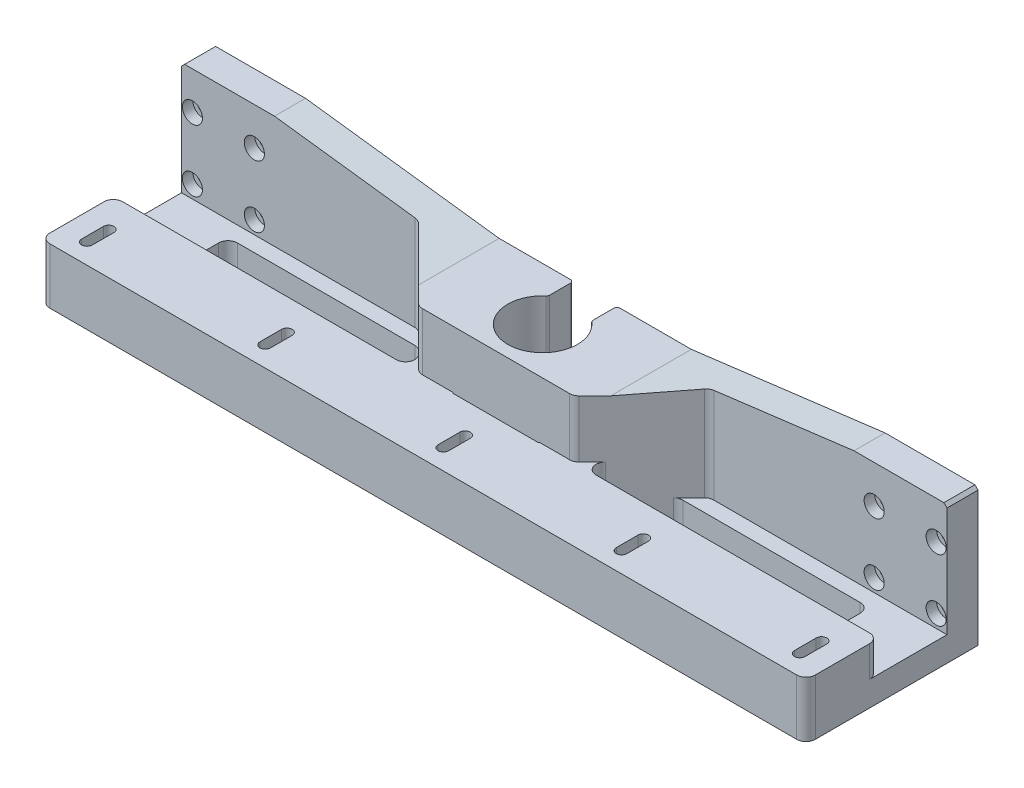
ISO-10303-21;
HEADER;
FILE_DESCRIPTION(('STEP AP214'),'2;1');
FILE_NAME('part.step','',(''),(''),'','','');
FILE_SCHEMA(('AUTOMOTIVE_DESIGN { 1 0 10303 214 1 1 1 1 }'));
ENDSEC;
DATA;
#1=APPLICATION_CONTEXT('core data for automotive mechanical design processes');
#2=APPLICATION_PROTOCOL_DEFINITION('international standard','automotive_design',2000,#1);
#3=PRODUCT_CONTEXT('',#1,'mechanical');
#4=PRODUCT('Part','Part','',(#3));
#5=PRODUCT_RELATED_PRODUCT_CATEGORY('part','',(#4));
#6=PRODUCT_DEFINITION_FORMATION('','',#4);
#7=PRODUCT_DEFINITION_CONTEXT('part definition',#1,'design');
#8=PRODUCT_DEFINITION('design','',#6,#7);
#9=PRODUCT_DEFINITION_SHAPE('','',#8);
#10=(LENGTH_UNIT() NAMED_UNIT(*) SI_UNIT(.MILLI.,.METRE.));
#11=(NAMED_UNIT(*) PLANE_ANGLE_UNIT() SI_UNIT($,.RADIAN.));
#12=(NAMED_UNIT(*) SI_UNIT($,.STERADIAN.) SOLID_ANGLE_UNIT());
#13=UNCERTAINTY_MEASURE_WITH_UNIT(LENGTH_MEASURE(1.E-05),#10,'distance_accuracy_value','');
#14=(GEOMETRIC_REPRESENTATION_CONTEXT(3) GLOBAL_UNCERTAINTY_ASSIGNED_CONTEXT((#13)) GLOBAL_UNIT_ASSIGNED_CONTEXT((#10,
#11,#12)) REPRESENTATION_CONTEXT('',''));
#15=CARTESIAN_POINT('',(0.,0.,0.));
#16=DIRECTION('',(0.,0.,1.));
#17=DIRECTION('',(1.,0.,0.));
#18=AXIS2_PLACEMENT_3D('',#15,#16,#17);
#19=CARTESIAN_POINT('',(0.,0.,0.));
#20=DIRECTION('',(0.,0.,-1.));
#21=DIRECTION('',(-1.,0.,0.));
#22=AXIS2_PLACEMENT_3D('',#19,#20,#21);
#23=PLANE('',#22);
#24=DIRECTION('',(1.,0.,0.));
#25=VECTOR('',#24,1.);
#26=CARTESIAN_POINT('',(-30.9999999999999,14.3,0.));
#27=LINE('',#26,#25);
#28=CARTESIAN_POINT('',(-30.9999999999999,14.3,0.));
#29=VERTEX_POINT('',#28);
#30=CARTESIAN_POINT('',(-8.,14.3,0.));
#31=VERTEX_POINT('',#30);
#32=EDGE_CURVE('E1263',#29,#31,#27,.T.);
#33=ORIENTED_EDGE('',*,*,#32,.T.);
#34=DIRECTION('',(0.,1.,0.));
#35=VECTOR('',#34,1.);
#36=CARTESIAN_POINT('',(-8.,-12.7,0.));
#37=LINE('',#36,#35);
#38=CARTESIAN_POINT('',(-8.,-12.7,0.));
#39=VERTEX_POINT('',#38);
#40=EDGE_CURVE('E2218',#31,#39,#37,.F.);
#41=ORIENTED_EDGE('',*,*,#40,.T.);
#42=DIRECTION('',(1.,0.,0.));
#43=VECTOR('',#42,1.);
#44=CARTESIAN_POINT('',(0.,-12.7,0.));
#45=LINE('',#44,#43);
#46=CARTESIAN_POINT('',(-14.3614066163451,-12.7,0.));
#47=VERTEX_POINT('',#46);
#48=EDGE_CURVE('E437',#47,#39,#45,.T.);
#49=ORIENTED_EDGE('',*,*,#48,.F.);
#50=DIRECTION('',(0.,-1.,0.));
#51=VECTOR('',#50,1.);
#52=CARTESIAN_POINT('',(-14.3614066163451,0.,0.));
#53=LINE('',#52,#51);
#54=CARTESIAN_POINT('',(-14.3614066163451,-22.2,0.));
#55=VERTEX_POINT('',#54);
#56=EDGE_CURVE('E2215',#47,#55,#53,.T.);
#57=ORIENTED_EDGE('',*,*,#56,.T.);
#58=DIRECTION('',(1.,0.,0.));
#59=VECTOR('',#58,1.);
#60=CARTESIAN_POINT('',(-123.5,-22.2,0.));
#61=LINE('',#60,#59);
#62=CARTESIAN_POINT('',(-123.5,-22.2,0.));
#63=VERTEX_POINT('',#62);
#64=EDGE_CURVE('E1924',#63,#55,#61,.T.);
#65=ORIENTED_EDGE('',*,*,#64,.F.);
#66=DIRECTION('',(0.,-1.,0.));
#67=VECTOR('',#66,1.);
#68=CARTESIAN_POINT('',(-123.5,-22.2,0.));
#69=LINE('',#68,#67);
#70=CARTESIAN_POINT('',(-123.5,21.2,0.));
#71=VERTEX_POINT('',#70);
#72=EDGE_CURVE('E1934',#71,#63,#69,.T.);
#73=ORIENTED_EDGE('',*,*,#72,.F.);
#74=DIRECTION('',(-0.707106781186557,-0.707106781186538,0.));
#75=VECTOR('',#74,1.);
#76=CARTESIAN_POINT('',(-72.3499999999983,72.3500000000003,0.));
#77=LINE('',#76,#75);
#78=CARTESIAN_POINT('',(-122.5,22.2,0.));
#79=VERTEX_POINT('',#78);
#80=EDGE_CURVE('E2039',#71,#79,#77,.F.);
#81=ORIENTED_EDGE('',*,*,#80,.T.);
#82=DIRECTION('',(-1.,0.,0.));
#83=VECTOR('',#82,1.);
#84=CARTESIAN_POINT('',(-123.5,22.2,0.));
#85=LINE('',#84,#83);
#86=CARTESIAN_POINT('',(-93.4999999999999,22.2,0.));
#87=VERTEX_POINT('',#86);
#88=EDGE_CURVE('E1929',#87,#79,#85,.T.);
#89=ORIENTED_EDGE('',*,*,#88,.F.);
#90=DIRECTION('',(0.992105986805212,-0.125402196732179,0.));
#91=VECTOR('',#90,1.);
#92=CARTESIAN_POINT('',(-93.4999999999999,22.2,0.));
#93=LINE('',#92,#91);
#94=EDGE_CURVE('E1258',#87,#29,#93,.T.);
#95=ORIENTED_EDGE('',*,*,#94,.T.);
#96=EDGE_LOOP('',(#33,#41,#49,#57,#65,#73,#81,#89,#95));
#97=FACE_BOUND('',#96,.T.);
#98=CARTESIAN_POINT('',(-120.,-9.99999999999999,0.));
#99=DIRECTION('',(0.,0.,1.));
#100=DIRECTION('',(1.,0.,0.));
#101=AXIS2_PLACEMENT_3D('',#98,#99,#100);
#102=CIRCLE('',#101,1.69999999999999);
#103=CARTESIAN_POINT('',(-118.3,-9.99999999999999,0.));
#104=VERTEX_POINT('',#103);
#105=EDGE_CURVE('E1769',#104,#104,#102,.T.);
#106=ORIENTED_EDGE('',*,*,#105,.T.);
#107=EDGE_LOOP('',(#106));
#108=FACE_BOUND('',#107,.T.);
#109=CARTESIAN_POINT('',(-99.9999999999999,-9.99999999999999,0.));
#110=DIRECTION('',(0.,0.,1.));
#111=DIRECTION('',(1.,0.,0.));
#112=AXIS2_PLACEMENT_3D('',#109,#110,#111);
#113=CIRCLE('',#112,1.69999999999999);
#114=CARTESIAN_POINT('',(-98.2999999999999,-9.99999999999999,0.));
#115=VERTEX_POINT('',#114);
#116=EDGE_CURVE('E1753',#115,#115,#113,.T.);
#117=ORIENTED_EDGE('',*,*,#116,.T.);
#118=EDGE_LOOP('',(#117));
#119=FACE_BOUND('',#118,.T.);
#120=CARTESIAN_POINT('',(-99.9999999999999,10.,0.));
#121=DIRECTION('',(0.,0.,1.));
#122=DIRECTION('',(1.,0.,0.));
#123=AXIS2_PLACEMENT_3D('',#120,#121,#122);
#124=CIRCLE('',#123,1.69999999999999);
#125=CARTESIAN_POINT('',(-98.2999999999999,10.,0.));
#126=VERTEX_POINT('',#125);
#127=EDGE_CURVE('E1737',#126,#126,#124,.T.);
#128=ORIENTED_EDGE('',*,*,#127,.T.);
#129=EDGE_LOOP('',(#128));
#130=FACE_BOUND('',#129,.T.);
#131=CARTESIAN_POINT('',(-120.,10.,0.));
#132=DIRECTION('',(0.,0.,1.));
#133=DIRECTION('',(1.,0.,0.));
#134=AXIS2_PLACEMENT_3D('',#131,#132,#133);
#135=CIRCLE('',#134,1.69999999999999);
#136=CARTESIAN_POINT('',(-118.3,10.,0.));
#137=VERTEX_POINT('',#136);
#138=EDGE_CURVE('E1721',#137,#137,#135,.T.);
#139=ORIENTED_EDGE('',*,*,#138,.T.);
#140=EDGE_LOOP('',(#139));
#141=FACE_BOUND('',#140,.T.);
#142=ADVANCED_FACE('F421',(#97,#108,#119,#130,#141),#23,.T.);
#143=CARTESIAN_POINT('',(-123.5,-14.2,55.5));
#144=DIRECTION('',(0.,1.,0.));
#145=DIRECTION('',(0.,0.,1.));
#146=AXIS2_PLACEMENT_3D('',#143,#144,#145);
#147=PLANE('',#146);
#148=DIRECTION('',(1.,0.,0.));
#149=VECTOR('',#148,1.);
#150=CARTESIAN_POINT('',(123.5,-14.2,10.));
#151=LINE('',#150,#149);
#152=CARTESIAN_POINT('',(48.2426406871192,-14.2,10.));
#153=VERTEX_POINT('',#152);
#154=CARTESIAN_POINT('',(123.5,-14.2,10.));
#155=VERTEX_POINT('',#154);
#156=EDGE_CURVE('E1842',#153,#155,#151,.T.);
#157=ORIENTED_EDGE('',*,*,#156,.F.);
#158=CARTESIAN_POINT('',(48.2426406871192,-14.2,13.));
#159=DIRECTION('',(0.,1.,0.));
#160=DIRECTION('',(0.,0.,1.));
#161=AXIS2_PLACEMENT_3D('',#158,#159,#160);
#162=CIRCLE('',#161,3.);
#163=CARTESIAN_POINT('',(46.1213203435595,-14.2,10.8786796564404));
#164=VERTEX_POINT('',#163);
#165=EDGE_CURVE('E2099',#153,#164,#162,.T.);
#166=ORIENTED_EDGE('',*,*,#165,.T.);
#167=DIRECTION('',(0.707106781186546,0.,-0.707106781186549));
#168=VECTOR('',#167,1.);
#169=CARTESIAN_POINT('',(46.9999999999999,-14.2,10.));
#170=LINE('',#169,#168);
#171=CARTESIAN_POINT('',(41.1213203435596,-14.2,15.8786796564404));
#172=VERTEX_POINT('',#171);
#173=EDGE_CURVE('E1846',#172,#164,#170,.T.);
#174=ORIENTED_EDGE('',*,*,#173,.F.);
#175=CARTESIAN_POINT('',(43.2426406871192,-14.2,18.));
#176=DIRECTION('',(0.,1.,0.));
#177=DIRECTION('',(0.,0.,1.));
#178=AXIS2_PLACEMENT_3D('',#175,#176,#177);
#179=CIRCLE('',#178,3.);
#180=CARTESIAN_POINT('',(43.2426406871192,-14.2,15.));
#181=VERTEX_POINT('',#180);
#182=EDGE_CURVE('E2006',#172,#181,#179,.F.);
#183=ORIENTED_EDGE('',*,*,#182,.T.);
#184=DIRECTION('',(-1.,0.,0.));
#185=VECTOR('',#184,1.);
#186=CARTESIAN_POINT('',(41.9999999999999,-14.2,15.));
#187=LINE('',#186,#185);
#188=CARTESIAN_POINT('',(100.5,-14.2,15.));
#189=VERTEX_POINT('',#188);
#190=EDGE_CURVE('E1344',#189,#181,#187,.T.);
#191=ORIENTED_EDGE('',*,*,#190,.F.);
#192=CARTESIAN_POINT('',(100.5,-14.2,18.));
#193=DIRECTION('',(0.,1.,0.));
#194=DIRECTION('',(0.,0.,1.));
#195=AXIS2_PLACEMENT_3D('',#192,#193,#194);
#196=CIRCLE('',#195,3.);
#197=CARTESIAN_POINT('',(103.5,-14.2,18.));
#198=VERTEX_POINT('',#197);
#199=EDGE_CURVE('E2000',#189,#198,#196,.F.);
#200=ORIENTED_EDGE('',*,*,#199,.T.);
#201=DIRECTION('',(0.,0.,-1.));
#202=VECTOR('',#201,1.);
#203=CARTESIAN_POINT('',(103.5,-14.2,15.));
#204=LINE('',#203,#202);
#205=CARTESIAN_POINT('',(103.5,-14.2,29.));
#206=VERTEX_POINT('',#205);
#207=EDGE_CURVE('E1303',#206,#198,#204,.T.);
#208=ORIENTED_EDGE('',*,*,#207,.F.);
#209=CARTESIAN_POINT('',(100.5,-14.2,29.));
#210=DIRECTION('',(0.,1.,0.));
#211=DIRECTION('',(0.,0.,1.));
#212=AXIS2_PLACEMENT_3D('',#209,#210,#211);
#213=CIRCLE('',#212,3.);
#214=CARTESIAN_POINT('',(100.5,-14.2,32.));
#215=VERTEX_POINT('',#214);
#216=EDGE_CURVE('E1993',#206,#215,#213,.F.);
#217=ORIENTED_EDGE('',*,*,#216,.T.);
#218=DIRECTION('',(-1.,0.,0.));
#219=VECTOR('',#218,1.);
#220=CARTESIAN_POINT('',(0.,-14.2,32.));
#221=LINE('',#220,#219);
#222=CARTESIAN_POINT('',(120.5,-14.2,32.));
#223=VERTEX_POINT('',#222);
#224=EDGE_CURVE('E1231',#223,#215,#221,.T.);
#225=ORIENTED_EDGE('',*,*,#224,.F.);
#226=CARTESIAN_POINT('',(120.5,-14.2,35.));
#227=DIRECTION('',(0.,1.,0.));
#228=DIRECTION('',(0.,0.,1.));
#229=AXIS2_PLACEMENT_3D('',#226,#227,#228);
#230=CIRCLE('',#229,3.);
#231=CARTESIAN_POINT('',(123.5,-14.2,35.));
#232=VERTEX_POINT('',#231);
#233=EDGE_CURVE('E1228',#232,#223,#230,.T.);
#234=ORIENTED_EDGE('',*,*,#233,.F.);
#235=DIRECTION('',(0.,0.,1.));
#236=VECTOR('',#235,1.);
#237=CARTESIAN_POINT('',(123.5,-14.2,55.5));
#238=LINE('',#237,#236);
#239=EDGE_CURVE('E1838',#155,#232,#238,.T.);
#240=ORIENTED_EDGE('',*,*,#239,.F.);
#241=EDGE_LOOP('',(#157,#166,#174,#183,#191,#200,#208,#217,#225,#234,#240));
#242=FACE_BOUND('',#241,.T.);
#243=ADVANCED_FACE('F2784',(#242),#147,.T.);
#244=DIRECTION('',(0.707106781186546,0.,0.707106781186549));
#245=VECTOR('',#244,1.);
#246=CARTESIAN_POINT('',(-46.9999999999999,-14.2,10.));
#247=LINE('',#246,#245);
#248=CARTESIAN_POINT('',(-46.1213203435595,-14.2,10.8786796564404));
#249=VERTEX_POINT('',#248);
#250=CARTESIAN_POINT('',(-41.1213203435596,-14.2,15.8786796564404));
#251=VERTEX_POINT('',#250);
#252=EDGE_CURVE('E1850',#249,#251,#247,.T.);
#253=ORIENTED_EDGE('',*,*,#252,.F.);
#254=CARTESIAN_POINT('',(-48.2426406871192,-14.2,13.));
#255=DIRECTION('',(0.,1.,0.));
#256=DIRECTION('',(0.,0.,1.));
#257=AXIS2_PLACEMENT_3D('',#254,#255,#256);
#258=CIRCLE('',#257,3.);
#259=CARTESIAN_POINT('',(-48.2426406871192,-14.2,10.));
#260=VERTEX_POINT('',#259);
#261=EDGE_CURVE('E2086',#249,#260,#258,.T.);
#262=ORIENTED_EDGE('',*,*,#261,.T.);
#263=DIRECTION('',(1.,0.,0.));
#264=VECTOR('',#263,1.);
#265=CARTESIAN_POINT('',(-123.5,-14.2,10.));
#266=LINE('',#265,#264);
#267=CARTESIAN_POINT('',(-123.5,-14.2,10.));
#268=VERTEX_POINT('',#267);
#269=EDGE_CURVE('E1853',#268,#260,#266,.T.);
#270=ORIENTED_EDGE('',*,*,#269,.F.);
#271=DIRECTION('',(0.,0.,-1.));
#272=VECTOR('',#271,1.);
#273=CARTESIAN_POINT('',(-123.5,-14.2,55.5));
#274=LINE('',#273,#272);
#275=CARTESIAN_POINT('',(-123.5,-14.2,35.));
#276=VERTEX_POINT('',#275);
#277=EDGE_CURVE('E1857',#276,#268,#274,.T.);
#278=ORIENTED_EDGE('',*,*,#277,.F.);
#279=CARTESIAN_POINT('',(-120.5,-14.2,35.));
#280=DIRECTION('',(0.,1.,0.));
#281=DIRECTION('',(0.,0.,1.));
#282=AXIS2_PLACEMENT_3D('',#279,#280,#281);
#283=CIRCLE('',#282,3.);
#284=CARTESIAN_POINT('',(-120.5,-14.2,32.));
#285=VERTEX_POINT('',#284);
#286=EDGE_CURVE('E1092',#285,#276,#283,.T.);
#287=ORIENTED_EDGE('',*,*,#286,.F.);
#288=DIRECTION('',(-1.,0.,0.));
#289=VECTOR('',#288,1.);
#290=CARTESIAN_POINT('',(0.,-14.2,32.));
#291=LINE('',#290,#289);
#292=CARTESIAN_POINT('',(-100.5,-14.2,32.));
#293=VERTEX_POINT('',#292);
#294=EDGE_CURVE('E1096',#293,#285,#291,.T.);
#295=ORIENTED_EDGE('',*,*,#294,.F.);
#296=CARTESIAN_POINT('',(-100.5,-14.2,29.));
#297=DIRECTION('',(0.,1.,0.));
#298=DIRECTION('',(0.,0.,1.));
#299=AXIS2_PLACEMENT_3D('',#296,#297,#298);
#300=CIRCLE('',#299,3.);
#301=CARTESIAN_POINT('',(-103.5,-14.2,29.));
#302=VERTEX_POINT('',#301);
#303=EDGE_CURVE('E2019',#293,#302,#300,.F.);
#304=ORIENTED_EDGE('',*,*,#303,.T.);
#305=DIRECTION('',(0.,0.,1.));
#306=VECTOR('',#305,1.);
#307=CARTESIAN_POINT('',(-103.5,-14.2,15.));
#308=LINE('',#307,#306);
#309=CARTESIAN_POINT('',(-103.5,-14.2,18.));
#310=VERTEX_POINT('',#309);
#311=EDGE_CURVE('E1325',#310,#302,#308,.T.);
#312=ORIENTED_EDGE('',*,*,#311,.F.);
#313=CARTESIAN_POINT('',(-100.5,-14.2,18.));
#314=DIRECTION('',(0.,1.,0.));
#315=DIRECTION('',(0.,0.,1.));
#316=AXIS2_PLACEMENT_3D('',#313,#314,#315);
#317=CIRCLE('',#316,3.);
#318=CARTESIAN_POINT('',(-100.5,-14.2,15.));
#319=VERTEX_POINT('',#318);
#320=EDGE_CURVE('E2025',#310,#319,#317,.F.);
#321=ORIENTED_EDGE('',*,*,#320,.T.);
#322=DIRECTION('',(-1.,0.,0.));
#323=VECTOR('',#322,1.);
#324=CARTESIAN_POINT('',(-103.5,-14.2,15.));
#325=LINE('',#324,#323);
#326=CARTESIAN_POINT('',(-43.2426406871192,-14.2,15.));
#327=VERTEX_POINT('',#326);
#328=EDGE_CURVE('E1309',#327,#319,#325,.T.);
#329=ORIENTED_EDGE('',*,*,#328,.F.);
#330=CARTESIAN_POINT('',(-43.2426406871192,-14.2,18.));
#331=DIRECTION('',(0.,1.,0.));
#332=DIRECTION('',(0.,0.,1.));
#333=AXIS2_PLACEMENT_3D('',#330,#331,#332);
#334=CIRCLE('',#333,3.);
#335=EDGE_CURVE('E2012',#327,#251,#334,.F.);
#336=ORIENTED_EDGE('',*,*,#335,.T.);
#337=EDGE_LOOP('',(#253,#262,#270,#278,#287,#295,#304,#312,#321,#329,#336));
#338=FACE_BOUND('',#337,.T.);
#339=ADVANCED_FACE('F2789',(#338),#147,.T.);
#340=CARTESIAN_POINT('',(-46.9999999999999,-273.355828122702,10.));
#341=DIRECTION('',(0.707106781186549,0.,-0.707106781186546));
#342=DIRECTION('',(-0.707106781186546,0.,-0.707106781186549));
#343=AXIS2_PLACEMENT_3D('',#340,#341,#342);
#344=PLANE('',#343);
#345=DIRECTION('',(-0.704299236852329,0.0890234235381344,-0.704299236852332));
#346=VECTOR('',#345,1.);
#347=CARTESIAN_POINT('',(-28.8374273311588,14.0266508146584,28.1625726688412));
#348=LINE('',#347,#346);
#349=CARTESIAN_POINT('',(-30.9999999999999,14.3,26.));
#350=VERTEX_POINT('',#349);
#351=CARTESIAN_POINT('',(-46.1213203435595,16.2113348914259,10.8786796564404));
#352=VERTEX_POINT('',#351);
#353=EDGE_CURVE('E2067',#350,#352,#348,.T.);
#354=ORIENTED_EDGE('',*,*,#353,.T.);
#355=DIRECTION('',(0.,1.,0.));
#356=VECTOR('',#355,1.);
#357=CARTESIAN_POINT('',(-46.1213203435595,-14.2,10.8786796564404));
#358=LINE('',#357,#356);
#359=EDGE_CURVE('E2083',#352,#249,#358,.F.);
#360=ORIENTED_EDGE('',*,*,#359,.T.);
#361=ORIENTED_EDGE('',*,*,#252,.T.);
#362=DIRECTION('',(0.,1.,0.));
#363=VECTOR('',#362,1.);
#364=CARTESIAN_POINT('',(-41.1213203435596,-22.2,15.8786796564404));
#365=LINE('',#364,#363);
#366=CARTESIAN_POINT('',(-41.1213203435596,-22.2,15.8786796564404));
#367=VERTEX_POINT('',#366);
#368=EDGE_CURVE('E1979',#251,#367,#365,.F.);
#369=ORIENTED_EDGE('',*,*,#368,.T.);
#370=DIRECTION('',(-0.707106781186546,0.,-0.707106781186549));
#371=VECTOR('',#370,1.);
#372=CARTESIAN_POINT('',(-41.9999999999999,-22.2,15.));
#373=LINE('',#372,#371);
#374=CARTESIAN_POINT('',(-30.1213203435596,-22.2,26.8786796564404));
#375=VERTEX_POINT('',#374);
#376=EDGE_CURVE('E1316',#375,#367,#373,.T.);
#377=ORIENTED_EDGE('',*,*,#376,.F.);
#378=DIRECTION('',(0.,1.,0.));
#379=VECTOR('',#378,1.);
#380=CARTESIAN_POINT('',(-30.1213203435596,-22.2,26.8786796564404));
#381=LINE('',#380,#379);
#382=CARTESIAN_POINT('',(-30.1213203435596,-4.2,26.8786796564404));
#383=VERTEX_POINT('',#382);
#384=EDGE_CURVE('E1333',#375,#383,#381,.T.);
#385=ORIENTED_EDGE('',*,*,#384,.T.);
#386=DIRECTION('',(-0.707106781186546,0.,-0.707106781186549));
#387=VECTOR('',#386,1.);
#388=CARTESIAN_POINT('',(-28.5,-4.2,28.4999999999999));
#389=LINE('',#388,#387);
#390=CARTESIAN_POINT('',(-25.8786796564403,-4.2,31.1213203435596));
#391=VERTEX_POINT('',#390);
#392=EDGE_CURVE('E1206',#391,#383,#389,.T.);
#393=ORIENTED_EDGE('',*,*,#392,.F.);
#394=DIRECTION('',(0.,1.,0.));
#395=VECTOR('',#394,1.);
#396=CARTESIAN_POINT('',(-25.8786796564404,-273.355828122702,31.1213203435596));
#397=LINE('',#396,#395);
#398=CARTESIAN_POINT('',(-25.8786796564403,14.3,31.1213203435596));
#399=VERTEX_POINT('',#398);
#400=EDGE_CURVE('E2079',#391,#399,#397,.T.);
#401=ORIENTED_EDGE('',*,*,#400,.T.);
#402=DIRECTION('',(-0.707106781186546,0.,-0.707106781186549));
#403=VECTOR('',#402,1.);
#404=CARTESIAN_POINT('',(-46.9999999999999,14.3,10.));
#405=LINE('',#404,#403);
#406=EDGE_CURVE('E1293',#399,#350,#405,.T.);
#407=ORIENTED_EDGE('',*,*,#406,.T.);
#408=EDGE_LOOP('',(#354,#360,#361,#369,#377,#385,#393,#401,#407));
#409=FACE_BOUND('',#408,.T.);
#410=ADVANCED_FACE('F3974',(#409),#344,.F.);
#411=CARTESIAN_POINT('',(-25.,-273.355828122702,32.));
#412=DIRECTION('',(0.,0.,-1.));
#413=DIRECTION('',(-1.,0.,0.));
#414=AXIS2_PLACEMENT_3D('',#411,#412,#413);
#415=PLANE('',#414);
#416=DIRECTION('',(1.,0.,0.));
#417=VECTOR('',#416,1.);
#418=CARTESIAN_POINT('',(-30.9999999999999,14.3,32.));
#419=LINE('',#418,#417);
#420=CARTESIAN_POINT('',(-23.7573593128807,14.3,32.));
#421=VERTEX_POINT('',#420);
#422=CARTESIAN_POINT('',(23.7573593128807,14.3,32.));
#423=VERTEX_POINT('',#422);
#424=EDGE_CURVE('E1257',#421,#423,#419,.T.);
#425=ORIENTED_EDGE('',*,*,#424,.F.);
#426=DIRECTION('',(0.,1.,0.));
#427=VECTOR('',#426,1.);
#428=CARTESIAN_POINT('',(-23.7573593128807,-273.355828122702,32.));
#429=LINE('',#428,#427);
#430=CARTESIAN_POINT('',(-23.7573593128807,-4.2,32.));
#431=VERTEX_POINT('',#430);
#432=EDGE_CURVE('E2112',#421,#431,#429,.F.);
#433=ORIENTED_EDGE('',*,*,#432,.T.);
#434=DIRECTION('',(-1.,0.,0.));
#435=VECTOR('',#434,1.);
#436=CARTESIAN_POINT('',(0.,-4.2,32.));
#437=LINE('',#436,#435);
#438=CARTESIAN_POINT('',(-13.9731886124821,-4.2,32.));
#439=VERTEX_POINT('',#438);
#440=EDGE_CURVE('E1202',#439,#431,#437,.T.);
#441=ORIENTED_EDGE('',*,*,#440,.F.);
#442=DIRECTION('',(0.,-1.,0.));
#443=VECTOR('',#442,1.);
#444=CARTESIAN_POINT('',(-13.9731886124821,-4.2,32.));
#445=LINE('',#444,#443);
#446=CARTESIAN_POINT('',(-13.9731886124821,-12.7,32.));
#447=VERTEX_POINT('',#446);
#448=EDGE_CURVE('E1243',#439,#447,#445,.T.);
#449=ORIENTED_EDGE('',*,*,#448,.T.);
#450=DIRECTION('',(-1.,0.,0.));
#451=VECTOR('',#450,1.);
#452=CARTESIAN_POINT('',(0.,-12.7,32.));
#453=LINE('',#452,#451);
#454=CARTESIAN_POINT('',(13.9731886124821,-12.7,32.));
#455=VERTEX_POINT('',#454);
#456=EDGE_CURVE('E1860',#455,#447,#453,.T.);
#457=ORIENTED_EDGE('',*,*,#456,.F.);
#458=DIRECTION('',(0.,-1.,0.));
#459=VECTOR('',#458,1.);
#460=CARTESIAN_POINT('',(13.9731886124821,-4.2,32.));
#461=LINE('',#460,#459);
#462=CARTESIAN_POINT('',(13.9731886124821,-4.2,32.));
#463=VERTEX_POINT('',#462);
#464=EDGE_CURVE('E1247',#463,#455,#461,.T.);
#465=ORIENTED_EDGE('',*,*,#464,.F.);
#466=DIRECTION('',(-1.,0.,0.));
#467=VECTOR('',#466,1.);
#468=CARTESIAN_POINT('',(0.,-4.2,32.));
#469=LINE('',#468,#467);
#470=CARTESIAN_POINT('',(23.7573593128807,-4.2,32.));
#471=VERTEX_POINT('',#470);
#472=EDGE_CURVE('E1188',#471,#463,#469,.T.);
#473=ORIENTED_EDGE('',*,*,#472,.F.);
#474=DIRECTION('',(0.,1.,0.));
#475=VECTOR('',#474,1.);
#476=CARTESIAN_POINT('',(23.7573593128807,-273.355828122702,32.));
#477=LINE('',#476,#475);
#478=EDGE_CURVE('E2108',#471,#423,#477,.T.);
#479=ORIENTED_EDGE('',*,*,#478,.T.);
#480=EDGE_LOOP('',(#425,#433,#441,#449,#457,#465,#473,#479));
#481=FACE_BOUND('',#480,.T.);
#482=ADVANCED_FACE('F2763',(#481),#415,.F.);
#483=CARTESIAN_POINT('',(-123.5,22.2,55.5));
#484=DIRECTION('',(0.,-1.,0.));
#485=DIRECTION('',(0.,0.,-1.));
#486=AXIS2_PLACEMENT_3D('',#483,#484,#485);
#487=PLANE('',#486);
#488=CARTESIAN_POINT('',(122.5,22.2,0.));
#489=VERTEX_POINT('',#488);
#490=CARTESIAN_POINT('',(93.5000000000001,22.2,0.));
#491=VERTEX_POINT('',#490);
#492=EDGE_CURVE('E1930',#489,#491,#85,.T.);
#493=ORIENTED_EDGE('',*,*,#492,.T.);
#494=DIRECTION('',(0.,0.,1.));
#495=VECTOR('',#494,1.);
#496=CARTESIAN_POINT('',(93.5000000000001,22.2,0.));
#497=LINE('',#496,#495);
#498=CARTESIAN_POINT('',(93.5000000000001,22.2,10.));
#499=VERTEX_POINT('',#498);
#500=EDGE_CURVE('E1275',#491,#499,#497,.T.);
#501=ORIENTED_EDGE('',*,*,#500,.T.);
#502=DIRECTION('',(-1.,0.,0.));
#503=VECTOR('',#502,1.);
#504=CARTESIAN_POINT('',(123.5,22.2,10.));
#505=LINE('',#504,#503);
#506=CARTESIAN_POINT('',(122.5,22.2,10.));
#507=VERTEX_POINT('',#506);
#508=EDGE_CURVE('E1837',#507,#499,#505,.T.);
#509=ORIENTED_EDGE('',*,*,#508,.F.);
#510=DIRECTION('',(0.,0.,-1.));
#511=VECTOR('',#510,1.);
#512=CARTESIAN_POINT('',(122.5,22.2,55.5));
#513=LINE('',#512,#511);
#514=EDGE_CURVE('E2035',#507,#489,#513,.T.);
#515=ORIENTED_EDGE('',*,*,#514,.T.);
#516=EDGE_LOOP('',(#493,#501,#509,#515));
#517=FACE_BOUND('',#516,.T.);
#518=ADVANCED_FACE('F2720',(#517),#487,.F.);
#519=CARTESIAN_POINT('',(-123.5,-22.2,55.5));
#520=DIRECTION('',(0.,1.,0.));
#521=DIRECTION('',(0.,0.,1.));
#522=AXIS2_PLACEMENT_3D('',#519,#520,#521);
#523=PLANE('',#522);
#524=ORIENTED_EDGE('',*,*,#376,.T.);
#525=CARTESIAN_POINT('',(-43.2426406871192,-22.2,18.));
#526=DIRECTION('',(0.,1.,0.));
#527=DIRECTION('',(0.,0.,1.));
#528=AXIS2_PLACEMENT_3D('',#525,#526,#527);
#529=CIRCLE('',#528,3.);
#530=CARTESIAN_POINT('',(-43.2426406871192,-22.2,15.));
#531=VERTEX_POINT('',#530);
#532=EDGE_CURVE('E2016',#367,#531,#529,.T.);
#533=ORIENTED_EDGE('',*,*,#532,.T.);
#534=DIRECTION('',(-1.,0.,0.));
#535=VECTOR('',#534,1.);
#536=CARTESIAN_POINT('',(-103.5,-22.2,15.));
#537=LINE('',#536,#535);
#538=CARTESIAN_POINT('',(-100.5,-22.2,15.));
#539=VERTEX_POINT('',#538);
#540=EDGE_CURVE('E1320',#531,#539,#537,.T.);
#541=ORIENTED_EDGE('',*,*,#540,.T.);
#542=CARTESIAN_POINT('',(-100.5,-22.2,18.));
#543=DIRECTION('',(0.,1.,0.));
#544=DIRECTION('',(0.,0.,1.));
#545=AXIS2_PLACEMENT_3D('',#542,#543,#544);
#546=CIRCLE('',#545,3.);
#547=CARTESIAN_POINT('',(-103.5,-22.2,18.));
#548=VERTEX_POINT('',#547);
#549=EDGE_CURVE('E2028',#539,#548,#546,.T.);
#550=ORIENTED_EDGE('',*,*,#549,.T.);
#551=DIRECTION('',(0.,0.,1.));
#552=VECTOR('',#551,1.);
#553=CARTESIAN_POINT('',(-103.5,-22.2,15.));
#554=LINE('',#553,#552);
#555=CARTESIAN_POINT('',(-103.5,-22.2,29.));
#556=VERTEX_POINT('',#555);
#557=EDGE_CURVE('E1304',#548,#556,#554,.T.);
#558=ORIENTED_EDGE('',*,*,#557,.T.);
#559=CARTESIAN_POINT('',(-100.5,-22.2,29.));
#560=DIRECTION('',(0.,1.,0.));
#561=DIRECTION('',(0.,0.,1.));
#562=AXIS2_PLACEMENT_3D('',#559,#560,#561);
#563=CIRCLE('',#562,3.);
#564=CARTESIAN_POINT('',(-100.5,-22.2,32.));
#565=VERTEX_POINT('',#564);
#566=EDGE_CURVE('E2022',#556,#565,#563,.T.);
#567=ORIENTED_EDGE('',*,*,#566,.T.);
#568=DIRECTION('',(1.,0.,0.));
#569=VECTOR('',#568,1.);
#570=CARTESIAN_POINT('',(-103.5,-22.2,32.));
#571=LINE('',#570,#569);
#572=CARTESIAN_POINT('',(-32.2426406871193,-22.2,32.));
#573=VERTEX_POINT('',#572);
#574=EDGE_CURVE('E1308',#565,#573,#571,.T.);
#575=ORIENTED_EDGE('',*,*,#574,.T.);
#576=CARTESIAN_POINT('',(-32.2426406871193,-22.2,29.));
#577=DIRECTION('',(0.,1.,0.));
#578=DIRECTION('',(0.,0.,-1.));
#579=AXIS2_PLACEMENT_3D('',#576,#577,#578);
#580=CIRCLE('',#579,3.);
#581=EDGE_CURVE('E1312',#573,#375,#580,.T.);
#582=ORIENTED_EDGE('',*,*,#581,.T.);
#583=EDGE_LOOP('',(#524,#533,#541,#550,#558,#567,#575,#582));
#584=FACE_BOUND('',#583,.T.);
#585=DIRECTION('',(0.,0.,-1.));
#586=VECTOR('',#585,1.);
#587=CARTESIAN_POINT('',(103.5,-22.2,15.));
#588=LINE('',#587,#586);
#589=CARTESIAN_POINT('',(103.5,-22.2,29.));
#590=VERTEX_POINT('',#589);
#591=CARTESIAN_POINT('',(103.5,-22.2,18.));
#592=VERTEX_POINT('',#591);
#593=EDGE_CURVE('E1352',#590,#592,#588,.T.);
#594=ORIENTED_EDGE('',*,*,#593,.T.);
#595=CARTESIAN_POINT('',(100.5,-22.2,18.));
#596=DIRECTION('',(0.,1.,0.));
#597=DIRECTION('',(0.,0.,1.));
#598=AXIS2_PLACEMENT_3D('',#595,#596,#597);
#599=CIRCLE('',#598,3.);
#600=CARTESIAN_POINT('',(100.5,-22.2,15.));
#601=VERTEX_POINT('',#600);
#602=EDGE_CURVE('E2003',#592,#601,#599,.T.);
#603=ORIENTED_EDGE('',*,*,#602,.T.);
#604=DIRECTION('',(-1.,0.,0.));
#605=VECTOR('',#604,1.);
#606=CARTESIAN_POINT('',(41.9999999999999,-22.2,15.));
#607=LINE('',#606,#605);
#608=CARTESIAN_POINT('',(43.2426406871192,-22.2,15.));
#609=VERTEX_POINT('',#608);
#610=EDGE_CURVE('E1356',#601,#609,#607,.T.);
#611=ORIENTED_EDGE('',*,*,#610,.T.);
#612=CARTESIAN_POINT('',(43.2426406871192,-22.2,18.));
#613=DIRECTION('',(0.,1.,0.));
#614=DIRECTION('',(0.,0.,1.));
#615=AXIS2_PLACEMENT_3D('',#612,#613,#614);
#616=CIRCLE('',#615,3.);
#617=CARTESIAN_POINT('',(41.1213203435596,-22.2,15.8786796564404));
#618=VERTEX_POINT('',#617);
#619=EDGE_CURVE('E2009',#609,#618,#616,.T.);
#620=ORIENTED_EDGE('',*,*,#619,.T.);
#621=DIRECTION('',(-0.707106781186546,0.,0.70710678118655));
#622=VECTOR('',#621,1.);
#623=CARTESIAN_POINT('',(30.1213203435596,-22.2,26.8786796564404));
#624=LINE('',#623,#622);
#625=CARTESIAN_POINT('',(30.1213203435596,-22.2,26.8786796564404));
#626=VERTEX_POINT('',#625);
#627=EDGE_CURVE('E1340',#618,#626,#624,.T.);
#628=ORIENTED_EDGE('',*,*,#627,.T.);
#629=CARTESIAN_POINT('',(32.2426406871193,-22.2,29.));
#630=DIRECTION('',(0.,1.,0.));
#631=DIRECTION('',(0.,0.,-1.));
#632=AXIS2_PLACEMENT_3D('',#629,#630,#631);
#633=CIRCLE('',#632,3.);
#634=CARTESIAN_POINT('',(32.2426406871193,-22.2,32.));
#635=VERTEX_POINT('',#634);
#636=EDGE_CURVE('E1343',#626,#635,#633,.T.);
#637=ORIENTED_EDGE('',*,*,#636,.T.);
#638=DIRECTION('',(1.,0.,0.));
#639=VECTOR('',#638,1.);
#640=CARTESIAN_POINT('',(32.2426406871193,-22.2,32.));
#641=LINE('',#640,#639);
#642=CARTESIAN_POINT('',(100.5,-22.2,32.));
#643=VERTEX_POINT('',#642);
#644=EDGE_CURVE('E1348',#635,#643,#641,.T.);
#645=ORIENTED_EDGE('',*,*,#644,.T.);
#646=CARTESIAN_POINT('',(100.5,-22.2,29.));
#647=DIRECTION('',(0.,1.,0.));
#648=DIRECTION('',(0.,0.,1.));
#649=AXIS2_PLACEMENT_3D('',#646,#647,#648);
#650=CIRCLE('',#649,3.);
#651=EDGE_CURVE('E1997',#643,#590,#650,.T.);
#652=ORIENTED_EDGE('',*,*,#651,.T.);
#653=EDGE_LOOP('',(#594,#603,#611,#620,#628,#637,#645,#652));
#654=FACE_BOUND('',#653,.T.);
#655=CARTESIAN_POINT('',(-57.5,-22.2,42.));
#656=DIRECTION('',(0.,-1.,0.));
#657=DIRECTION('',(0.,0.,-1.));
#658=AXIS2_PLACEMENT_3D('',#655,#656,#657);
#659=CIRCLE('',#658,3.25);
#660=CARTESIAN_POINT('',(-60.75,-22.2,42.));
#661=VERTEX_POINT('',#660);
#662=CARTESIAN_POINT('',(-54.25,-22.2,42.));
#663=VERTEX_POINT('',#662);
#664=EDGE_CURVE('E1555',#661,#663,#659,.T.);
#665=ORIENTED_EDGE('',*,*,#664,.F.);
#666=DIRECTION('',(0.,0.,-1.));
#667=VECTOR('',#666,1.);
#668=CARTESIAN_POINT('',(-60.75,-22.2,49.));
#669=LINE('',#668,#667);
#670=CARTESIAN_POINT('',(-60.75,-22.2,49.));
#671=VERTEX_POINT('',#670);
#672=EDGE_CURVE('E1501',#671,#661,#669,.T.);
#673=ORIENTED_EDGE('',*,*,#672,.F.);
#674=CARTESIAN_POINT('',(-57.5,-22.2,49.));
#675=DIRECTION('',(0.,-1.,0.));
#676=DIRECTION('',(0.,0.,-1.));
#677=AXIS2_PLACEMENT_3D('',#674,#675,#676);
#678=CIRCLE('',#677,3.25);
#679=CARTESIAN_POINT('',(-54.25,-22.2,49.));
#680=VERTEX_POINT('',#679);
#681=EDGE_CURVE('E1531',#680,#671,#678,.T.);
#682=ORIENTED_EDGE('',*,*,#681,.F.);
#683=DIRECTION('',(0.,0.,-1.));
#684=VECTOR('',#683,1.);
#685=CARTESIAN_POINT('',(-54.25,-22.2,49.));
#686=LINE('',#685,#684);
#687=EDGE_CURVE('E1517',#680,#663,#686,.T.);
#688=ORIENTED_EDGE('',*,*,#687,.T.);
#689=EDGE_LOOP('',(#665,#673,#682,#688));
#690=FACE_BOUND('',#689,.T.);
#691=CARTESIAN_POINT('',(0.,-22.2,42.));
#692=DIRECTION('',(0.,-1.,0.));
#693=DIRECTION('',(0.,0.,-1.));
#694=AXIS2_PLACEMENT_3D('',#691,#692,#693);
#695=CIRCLE('',#694,3.25);
#696=CARTESIAN_POINT('',(-3.25000000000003,-22.2,42.));
#697=VERTEX_POINT('',#696);
#698=CARTESIAN_POINT('',(3.25,-22.2,42.));
#699=VERTEX_POINT('',#698);
#700=EDGE_CURVE('E1694',#697,#699,#695,.T.);
#701=ORIENTED_EDGE('',*,*,#700,.F.);
#702=DIRECTION('',(0.,0.,-1.));
#703=VECTOR('',#702,1.);
#704=CARTESIAN_POINT('',(-3.25000000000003,-22.2,49.));
#705=LINE('',#704,#703);
#706=CARTESIAN_POINT('',(-3.25,-22.2,49.));
#707=VERTEX_POINT('',#706);
#708=EDGE_CURVE('E1640',#707,#697,#705,.T.);
#709=ORIENTED_EDGE('',*,*,#708,.F.);
#710=CARTESIAN_POINT('',(0.,-22.2,49.));
#711=DIRECTION('',(0.,-1.,0.));
#712=DIRECTION('',(0.,0.,-1.));
#713=AXIS2_PLACEMENT_3D('',#710,#711,#712);
#714=CIRCLE('',#713,3.25);
#715=CARTESIAN_POINT('',(3.25,-22.2,49.));
#716=VERTEX_POINT('',#715);
#717=EDGE_CURVE('E1670',#716,#707,#714,.T.);
#718=ORIENTED_EDGE('',*,*,#717,.F.);
#719=DIRECTION('',(0.,0.,-1.));
#720=VECTOR('',#719,1.);
#721=CARTESIAN_POINT('',(3.25,-22.2,49.));
#722=LINE('',#721,#720);
#723=EDGE_CURVE('E1656',#716,#699,#722,.T.);
#724=ORIENTED_EDGE('',*,*,#723,.T.);
#725=EDGE_LOOP('',(#701,#709,#718,#724));
#726=FACE_BOUND('',#725,.T.);
#727=CARTESIAN_POINT('',(0.,-22.2,17.));
#728=DIRECTION('',(0.,1.,0.));
#729=DIRECTION('',(0.,0.,1.));
#730=AXIS2_PLACEMENT_3D('',#727,#728,#729);
#731=CIRCLE('',#730,20.5);
#732=CARTESIAN_POINT('',(13.6999087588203,-22.2,32.25));
#733=VERTEX_POINT('',#732);
#734=CARTESIAN_POINT('',(13.6934342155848,-22.2,1.74418604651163));
#735=VERTEX_POINT('',#734);
#736=EDGE_CURVE('E1898',#733,#735,#731,.T.);
#737=ORIENTED_EDGE('',*,*,#736,.T.);
#738=CARTESIAN_POINT('',(14.3614066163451,-22.2,1.));
#739=DIRECTION('',(0.,1.,0.));
#740=DIRECTION('',(0.,0.,1.));
#741=AXIS2_PLACEMENT_3D('',#738,#739,#740);
#742=CIRCLE('',#741,1.);
#743=CARTESIAN_POINT('',(14.3614066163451,-22.2,0.));
#744=VERTEX_POINT('',#743);
#745=EDGE_CURVE('E2205',#735,#744,#742,.F.);
#746=ORIENTED_EDGE('',*,*,#745,.T.);
#747=CARTESIAN_POINT('',(123.5,-22.2,0.));
#748=VERTEX_POINT('',#747);
#749=EDGE_CURVE('E1938',#744,#748,#61,.T.);
#750=ORIENTED_EDGE('',*,*,#749,.T.);
#751=DIRECTION('',(0.,0.,-1.));
#752=VECTOR('',#751,1.);
#753=CARTESIAN_POINT('',(123.5,-22.2,55.5));
#754=LINE('',#753,#752);
#755=CARTESIAN_POINT('',(123.5,-22.2,52.5));
#756=VERTEX_POINT('',#755);
#757=EDGE_CURVE('E1923',#756,#748,#754,.T.);
#758=ORIENTED_EDGE('',*,*,#757,.F.);
#759=CARTESIAN_POINT('',(120.5,-22.2,52.5));
#760=DIRECTION('',(0.,1.,0.));
#761=DIRECTION('',(0.,0.,1.));
#762=AXIS2_PLACEMENT_3D('',#759,#760,#761);
#763=CIRCLE('',#762,3.);
#764=CARTESIAN_POINT('',(120.5,-22.2,55.5));
#765=VERTEX_POINT('',#764);
#766=EDGE_CURVE('E2123',#756,#765,#763,.F.);
#767=ORIENTED_EDGE('',*,*,#766,.T.);
#768=DIRECTION('',(1.,0.,0.));
#769=VECTOR('',#768,1.);
#770=CARTESIAN_POINT('',(-123.5,-22.2,55.5));
#771=LINE('',#770,#769);
#772=CARTESIAN_POINT('',(-120.5,-22.2,55.5));
#773=VERTEX_POINT('',#772);
#774=EDGE_CURVE('E1919',#773,#765,#771,.T.);
#775=ORIENTED_EDGE('',*,*,#774,.F.);
#776=CARTESIAN_POINT('',(-120.5,-22.2,52.5));
#777=DIRECTION('',(0.,1.,0.));
#778=DIRECTION('',(0.,0.,1.));
#779=AXIS2_PLACEMENT_3D('',#776,#777,#778);
#780=CIRCLE('',#779,3.);
#781=CARTESIAN_POINT('',(-123.5,-22.2,52.5));
#782=VERTEX_POINT('',#781);
#783=EDGE_CURVE('E2126',#773,#782,#780,.F.);
#784=ORIENTED_EDGE('',*,*,#783,.T.);
#785=DIRECTION('',(0.,0.,-1.));
#786=VECTOR('',#785,1.);
#787=CARTESIAN_POINT('',(-123.5,-22.2,55.5));
#788=LINE('',#787,#786);
#789=EDGE_CURVE('E1945',#782,#63,#788,.T.);
#790=ORIENTED_EDGE('',*,*,#789,.T.);
#791=ORIENTED_EDGE('',*,*,#64,.T.);
#792=CARTESIAN_POINT('',(-14.3614066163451,-22.2,1.));
#793=DIRECTION('',(0.,1.,0.));
#794=DIRECTION('',(0.,0.,1.));
#795=AXIS2_PLACEMENT_3D('',#792,#793,#794);
#796=CIRCLE('',#795,1.);
#797=CARTESIAN_POINT('',(-13.6934342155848,-22.2,1.74418604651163));
#798=VERTEX_POINT('',#797);
#799=EDGE_CURVE('E2202',#55,#798,#796,.F.);
#800=ORIENTED_EDGE('',*,*,#799,.T.);
#801=CARTESIAN_POINT('',(0.,-22.2,17.));
#802=DIRECTION('',(0.,1.,0.));
#803=DIRECTION('',(0.,0.,1.));
#804=AXIS2_PLACEMENT_3D('',#801,#802,#803);
#805=CIRCLE('',#804,20.5);
#806=CARTESIAN_POINT('',(-13.6999087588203,-22.2,32.25));
#807=VERTEX_POINT('',#806);
#808=EDGE_CURVE('E1882',#798,#807,#805,.T.);
#809=ORIENTED_EDGE('',*,*,#808,.T.);
#810=DIRECTION('',(1.,0.,0.));
#811=VECTOR('',#810,1.);
#812=CARTESIAN_POINT('',(-13.6999087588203,-22.2,32.25));
#813=LINE('',#812,#811);
#814=EDGE_CURVE('E1905',#807,#733,#813,.T.);
#815=ORIENTED_EDGE('',*,*,#814,.T.);
#816=EDGE_LOOP('',(#737,#746,#750,#758,#767,#775,#784,#790,#791,#800,#809,#815));
#817=FACE_BOUND('',#816,.T.);
#818=DIRECTION('',(0.,0.,-1.));
#819=VECTOR('',#818,1.);
#820=CARTESIAN_POINT('',(-118.25,-22.2,49.));
#821=LINE('',#820,#819);
#822=CARTESIAN_POINT('',(-118.25,-22.2,49.));
#823=VERTEX_POINT('',#822);
#824=CARTESIAN_POINT('',(-118.25,-22.2,42.));
#825=VERTEX_POINT('',#824);
#826=EDGE_CURVE('E1570',#823,#825,#821,.T.);
#827=ORIENTED_EDGE('',*,*,#826,.F.);
#828=CARTESIAN_POINT('',(-115.,-22.2,49.));
#829=DIRECTION('',(0.,-1.,0.));
#830=DIRECTION('',(0.,0.,-1.));
#831=AXIS2_PLACEMENT_3D('',#828,#829,#830);
#832=CIRCLE('',#831,3.24999999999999);
#833=CARTESIAN_POINT('',(-111.75,-22.2,49.));
#834=VERTEX_POINT('',#833);
#835=EDGE_CURVE('E1600',#834,#823,#832,.T.);
#836=ORIENTED_EDGE('',*,*,#835,.F.);
#837=DIRECTION('',(0.,0.,-1.));
#838=VECTOR('',#837,1.);
#839=CARTESIAN_POINT('',(-111.75,-22.2,49.));
#840=LINE('',#839,#838);
#841=CARTESIAN_POINT('',(-111.75,-22.2,42.));
#842=VERTEX_POINT('',#841);
#843=EDGE_CURVE('E1586',#834,#842,#840,.T.);
#844=ORIENTED_EDGE('',*,*,#843,.T.);
#845=CARTESIAN_POINT('',(-115.,-22.2,42.));
#846=DIRECTION('',(0.,-1.,0.));
#847=DIRECTION('',(0.,0.,-1.));
#848=AXIS2_PLACEMENT_3D('',#845,#846,#847);
#849=CIRCLE('',#848,3.24999999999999);
#850=EDGE_CURVE('E1624',#825,#842,#849,.T.);
#851=ORIENTED_EDGE('',*,*,#850,.F.);
#852=EDGE_LOOP('',(#827,#836,#844,#851));
#853=FACE_BOUND('',#852,.T.);
#854=CARTESIAN_POINT('',(57.5,-22.2,42.));
#855=DIRECTION('',(0.,-1.,0.));
#856=DIRECTION('',(0.,0.,-1.));
#857=AXIS2_PLACEMENT_3D('',#854,#855,#856);
#858=CIRCLE('',#857,3.25);
#859=CARTESIAN_POINT('',(54.25,-22.2,42.));
#860=VERTEX_POINT('',#859);
#861=CARTESIAN_POINT('',(60.75,-22.2,42.));
#862=VERTEX_POINT('',#861);
#863=EDGE_CURVE('E1486',#860,#862,#858,.T.);
#864=ORIENTED_EDGE('',*,*,#863,.F.);
#865=DIRECTION('',(0.,0.,-1.));
#866=VECTOR('',#865,1.);
#867=CARTESIAN_POINT('',(54.25,-22.2,49.));
#868=LINE('',#867,#866);
#869=CARTESIAN_POINT('',(54.25,-22.2,49.));
#870=VERTEX_POINT('',#869);
#871=EDGE_CURVE('E1432',#870,#860,#868,.T.);
#872=ORIENTED_EDGE('',*,*,#871,.F.);
#873=CARTESIAN_POINT('',(57.5,-22.2,49.));
#874=DIRECTION('',(0.,-1.,0.));
#875=DIRECTION('',(0.,0.,-1.));
#876=AXIS2_PLACEMENT_3D('',#873,#874,#875);
#877=CIRCLE('',#876,3.25);
#878=CARTESIAN_POINT('',(60.75,-22.2,49.));
#879=VERTEX_POINT('',#878);
#880=EDGE_CURVE('E1462',#879,#870,#877,.T.);
#881=ORIENTED_EDGE('',*,*,#880,.F.);
#882=DIRECTION('',(0.,0.,-1.));
#883=VECTOR('',#882,1.);
#884=CARTESIAN_POINT('',(60.75,-22.2,49.));
#885=LINE('',#884,#883);
#886=EDGE_CURVE('E1448',#879,#862,#885,.T.);
#887=ORIENTED_EDGE('',*,*,#886,.T.);
#888=EDGE_LOOP('',(#864,#872,#881,#887));
#889=FACE_BOUND('',#888,.T.);
#890=CARTESIAN_POINT('',(115.,-22.2,49.));
#891=DIRECTION('',(0.,-1.,0.));
#892=DIRECTION('',(0.,0.,-1.));
#893=AXIS2_PLACEMENT_3D('',#890,#891,#892);
#894=CIRCLE('',#893,3.24999999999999);
#895=CARTESIAN_POINT('',(118.25,-22.2,49.));
#896=VERTEX_POINT('',#895);
#897=CARTESIAN_POINT('',(111.75,-22.2,49.));
#898=VERTEX_POINT('',#897);
#899=EDGE_CURVE('E1400',#896,#898,#894,.T.);
#900=ORIENTED_EDGE('',*,*,#899,.F.);
#901=DIRECTION('',(0.,0.,-1.));
#902=VECTOR('',#901,1.);
#903=CARTESIAN_POINT('',(118.25,-22.2,49.));
#904=LINE('',#903,#902);
#905=CARTESIAN_POINT('',(118.25,-22.2,42.));
#906=VERTEX_POINT('',#905);
#907=EDGE_CURVE('E1386',#896,#906,#904,.T.);
#908=ORIENTED_EDGE('',*,*,#907,.T.);
#909=CARTESIAN_POINT('',(115.,-22.2,42.));
#910=DIRECTION('',(0.,-1.,0.));
#911=DIRECTION('',(0.,0.,-1.));
#912=AXIS2_PLACEMENT_3D('',#909,#910,#911);
#913=CIRCLE('',#912,3.24999999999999);
#914=CARTESIAN_POINT('',(111.75,-22.2,42.));
#915=VERTEX_POINT('',#914);
#916=EDGE_CURVE('E1418',#915,#906,#913,.T.);
#917=ORIENTED_EDGE('',*,*,#916,.F.);
#918=DIRECTION('',(0.,0.,-1.));
#919=VECTOR('',#918,1.);
#920=CARTESIAN_POINT('',(111.75,-22.2,49.));
#921=LINE('',#920,#919);
#922=EDGE_CURVE('E1337',#898,#915,#921,.T.);
#923=ORIENTED_EDGE('',*,*,#922,.F.);
#924=EDGE_LOOP('',(#900,#908,#917,#923));
#925=FACE_BOUND('',#924,.T.);
#926=ADVANCED_FACE('F2242',(#584,#654,#690,#726,#817,#853,#889,#925),#523,.F.);
#927=CARTESIAN_POINT('',(0.,0.,55.5));
#928=DIRECTION('',(0.,0.,-1.));
#929=DIRECTION('',(-1.,0.,0.));
#930=AXIS2_PLACEMENT_3D('',#927,#928,#929);
#931=PLANE('',#930);
#932=DIRECTION('',(1.,0.,0.));
#933=VECTOR('',#932,1.);
#934=CARTESIAN_POINT('',(0.,-4.2,55.5));
#935=LINE('',#934,#933);
#936=CARTESIAN_POINT('',(-120.5,-4.2,55.5));
#937=VERTEX_POINT('',#936);
#938=CARTESIAN_POINT('',(120.5,-4.2,55.5));
#939=VERTEX_POINT('',#938);
#940=EDGE_CURVE('E1223',#937,#939,#935,.T.);
#941=ORIENTED_EDGE('',*,*,#940,.F.);
#942=DIRECTION('',(0.,-1.,0.));
#943=VECTOR('',#942,1.);
#944=CARTESIAN_POINT('',(-120.5,0.,55.5));
#945=LINE('',#944,#943);
#946=EDGE_CURVE('E2119',#937,#773,#945,.T.);
#947=ORIENTED_EDGE('',*,*,#946,.T.);
#948=ORIENTED_EDGE('',*,*,#774,.T.);
#949=DIRECTION('',(0.,1.,0.));
#950=VECTOR('',#949,1.);
#951=CARTESIAN_POINT('',(120.5,0.,55.5));
#952=LINE('',#951,#950);
#953=EDGE_CURVE('E2115',#765,#939,#952,.T.);
#954=ORIENTED_EDGE('',*,*,#953,.T.);
#955=EDGE_LOOP('',(#941,#947,#948,#954));
#956=FACE_BOUND('',#955,.T.);
#957=ADVANCED_FACE('F2739',(#956),#931,.F.);
#958=CARTESIAN_POINT('',(-13.6999087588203,-12.7,32.25));
#959=DIRECTION('',(0.,0.,-1.));
#960=DIRECTION('',(-1.,0.,0.));
#961=AXIS2_PLACEMENT_3D('',#958,#959,#960);
#962=PLANE('',#961);
#963=DIRECTION('',(0.,-1.,0.));
#964=VECTOR('',#963,1.);
#965=CARTESIAN_POINT('',(-13.6999087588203,-12.7,32.25));
#966=LINE('',#965,#964);
#967=CARTESIAN_POINT('',(-13.6999087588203,-4.2,32.25));
#968=VERTEX_POINT('',#967);
#969=EDGE_CURVE('E1914',#968,#807,#966,.T.);
#970=ORIENTED_EDGE('',*,*,#969,.F.);
#971=DIRECTION('',(-1.,0.,0.));
#972=VECTOR('',#971,1.);
#973=CARTESIAN_POINT('',(0.,-4.2,32.25));
#974=LINE('',#973,#972);
#975=CARTESIAN_POINT('',(13.6999087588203,-4.2,32.25));
#976=VERTEX_POINT('',#975);
#977=EDGE_CURVE('E1195',#976,#968,#974,.T.);
#978=ORIENTED_EDGE('',*,*,#977,.F.);
#979=DIRECTION('',(0.,-1.,0.));
#980=VECTOR('',#979,1.);
#981=CARTESIAN_POINT('',(13.6999087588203,-12.7,32.25));
#982=LINE('',#981,#980);
#983=EDGE_CURVE('E1902',#976,#733,#982,.T.);
#984=ORIENTED_EDGE('',*,*,#983,.T.);
#985=ORIENTED_EDGE('',*,*,#814,.F.);
#986=EDGE_LOOP('',(#970,#978,#984,#985));
#987=FACE_BOUND('',#986,.T.);
#988=ADVANCED_FACE('F2771',(#987),#962,.T.);
#989=CARTESIAN_POINT('',(123.5,-22.2,55.5));
#990=DIRECTION('',(-1.,0.,0.));
#991=DIRECTION('',(0.,0.,1.));
#992=AXIS2_PLACEMENT_3D('',#989,#990,#991);
#993=PLANE('',#992);
#994=DIRECTION('',(0.,0.,-1.));
#995=VECTOR('',#994,1.);
#996=CARTESIAN_POINT('',(123.5,-4.2,0.));
#997=LINE('',#996,#995);
#998=CARTESIAN_POINT('',(123.5,-4.2,52.5));
#999=VERTEX_POINT('',#998);
#1000=CARTESIAN_POINT('',(123.5,-4.2,35.));
#1001=VERTEX_POINT('',#1000);
#1002=EDGE_CURVE('E1170',#999,#1001,#997,.T.);
#1003=ORIENTED_EDGE('',*,*,#1002,.F.);
#1004=DIRECTION('',(0.,1.,0.));
#1005=VECTOR('',#1004,1.);
#1006=CARTESIAN_POINT('',(123.5,-22.2,52.5));
#1007=LINE('',#1006,#1005);
#1008=EDGE_CURVE('E2138',#999,#756,#1007,.F.);
#1009=ORIENTED_EDGE('',*,*,#1008,.T.);
#1010=ORIENTED_EDGE('',*,*,#757,.T.);
#1011=DIRECTION('',(0.,1.,0.));
#1012=VECTOR('',#1011,1.);
#1013=CARTESIAN_POINT('',(123.5,-22.2,0.));
#1014=LINE('',#1013,#1012);
#1015=CARTESIAN_POINT('',(123.5,21.2,0.));
#1016=VERTEX_POINT('',#1015);
#1017=EDGE_CURVE('E1925',#748,#1016,#1014,.T.);
#1018=ORIENTED_EDGE('',*,*,#1017,.T.);
#1019=DIRECTION('',(0.,0.,1.));
#1020=VECTOR('',#1019,1.);
#1021=CARTESIAN_POINT('',(123.5,21.2,55.5));
#1022=LINE('',#1021,#1020);
#1023=CARTESIAN_POINT('',(123.5,21.2,10.));
#1024=VERTEX_POINT('',#1023);
#1025=EDGE_CURVE('E2046',#1016,#1024,#1022,.T.);
#1026=ORIENTED_EDGE('',*,*,#1025,.T.);
#1027=DIRECTION('',(0.,1.,0.));
#1028=VECTOR('',#1027,1.);
#1029=CARTESIAN_POINT('',(123.5,-273.355828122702,10.));
#1030=LINE('',#1029,#1028);
#1031=EDGE_CURVE('E1867',#155,#1024,#1030,.T.);
#1032=ORIENTED_EDGE('',*,*,#1031,.F.);
#1033=ORIENTED_EDGE('',*,*,#239,.T.);
#1034=DIRECTION('',(0.,-1.,0.));
#1035=VECTOR('',#1034,1.);
#1036=CARTESIAN_POINT('',(123.5,-4.2,35.));
#1037=LINE('',#1036,#1035);
#1038=EDGE_CURVE('E1254',#1001,#232,#1037,.T.);
#1039=ORIENTED_EDGE('',*,*,#1038,.F.);
#1040=EDGE_LOOP('',(#1003,#1009,#1010,#1018,#1026,#1032,#1033,#1039));
#1041=FACE_BOUND('',#1040,.T.);
#1042=ADVANCED_FACE('F2729',(#1041),#993,.F.);
#1043=DIRECTION('',(-1.,0.,0.));
#1044=VECTOR('',#1043,1.);
#1045=CARTESIAN_POINT('',(-123.5,22.2,10.));
#1046=LINE('',#1045,#1044);
#1047=CARTESIAN_POINT('',(-93.4999999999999,22.2,10.));
#1048=VERTEX_POINT('',#1047);
#1049=CARTESIAN_POINT('',(-122.5,22.2,10.));
#1050=VERTEX_POINT('',#1049);
#1051=EDGE_CURVE('E1864',#1048,#1050,#1046,.T.);
#1052=ORIENTED_EDGE('',*,*,#1051,.F.);
#1053=DIRECTION('',(0.,0.,1.));
#1054=VECTOR('',#1053,1.);
#1055=CARTESIAN_POINT('',(-93.4999999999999,22.2,0.));
#1056=LINE('',#1055,#1054);
#1057=EDGE_CURVE('E1271',#87,#1048,#1056,.T.);
#1058=ORIENTED_EDGE('',*,*,#1057,.F.);
#1059=ORIENTED_EDGE('',*,*,#88,.T.);
#1060=DIRECTION('',(0.,0.,1.));
#1061=VECTOR('',#1060,1.);
#1062=CARTESIAN_POINT('',(-122.5,22.2,55.5));
#1063=LINE('',#1062,#1061);
#1064=EDGE_CURVE('E2031',#79,#1050,#1063,.T.);
#1065=ORIENTED_EDGE('',*,*,#1064,.T.);
#1066=EDGE_LOOP('',(#1052,#1058,#1059,#1065));
#1067=FACE_BOUND('',#1066,.T.);
#1068=ADVANCED_FACE('F2778',(#1067),#487,.F.);
#1069=CARTESIAN_POINT('',(-123.5,-22.2,55.5));
#1070=DIRECTION('',(1.,0.,0.));
#1071=DIRECTION('',(0.,0.,-1.));
#1072=AXIS2_PLACEMENT_3D('',#1069,#1070,#1071);
#1073=PLANE('',#1072);
#1074=ORIENTED_EDGE('',*,*,#789,.F.);
#1075=DIRECTION('',(0.,-1.,0.));
#1076=VECTOR('',#1075,1.);
#1077=CARTESIAN_POINT('',(-123.5,-22.2,52.5));
#1078=LINE('',#1077,#1076);
#1079=CARTESIAN_POINT('',(-123.5,-4.2,52.5));
#1080=VERTEX_POINT('',#1079);
#1081=EDGE_CURVE('E2129',#782,#1080,#1078,.F.);
#1082=ORIENTED_EDGE('',*,*,#1081,.T.);
#1083=DIRECTION('',(0.,0.,1.));
#1084=VECTOR('',#1083,1.);
#1085=CARTESIAN_POINT('',(-123.5,-4.2,0.));
#1086=LINE('',#1085,#1084);
#1087=CARTESIAN_POINT('',(-123.5,-4.2,35.));
#1088=VERTEX_POINT('',#1087);
#1089=EDGE_CURVE('E1219',#1088,#1080,#1086,.T.);
#1090=ORIENTED_EDGE('',*,*,#1089,.F.);
#1091=DIRECTION('',(0.,-1.,0.));
#1092=VECTOR('',#1091,1.);
#1093=CARTESIAN_POINT('',(-123.5,-4.2,35.));
#1094=LINE('',#1093,#1092);
#1095=EDGE_CURVE('E1227',#1088,#276,#1094,.T.);
#1096=ORIENTED_EDGE('',*,*,#1095,.T.);
#1097=ORIENTED_EDGE('',*,*,#277,.T.);
#1098=DIRECTION('',(0.,1.,0.));
#1099=VECTOR('',#1098,1.);
#1100=CARTESIAN_POINT('',(-123.5,-273.355828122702,10.));
#1101=LINE('',#1100,#1099);
#1102=CARTESIAN_POINT('',(-123.5,21.2000000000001,10.));
#1103=VERTEX_POINT('',#1102);
#1104=EDGE_CURVE('E1843',#268,#1103,#1101,.T.);
#1105=ORIENTED_EDGE('',*,*,#1104,.T.);
#1106=DIRECTION('',(0.,0.,-1.));
#1107=VECTOR('',#1106,1.);
#1108=CARTESIAN_POINT('',(-123.5,21.2,55.5));
#1109=LINE('',#1108,#1107);
#1110=EDGE_CURVE('E2052',#1103,#71,#1109,.T.);
#1111=ORIENTED_EDGE('',*,*,#1110,.T.);
#1112=ORIENTED_EDGE('',*,*,#72,.T.);
#1113=EDGE_LOOP('',(#1074,#1082,#1090,#1096,#1097,#1105,#1111,#1112));
#1114=FACE_BOUND('',#1113,.T.);
#1115=ADVANCED_FACE('F2749',(#1114),#1073,.F.);
#1116=ORIENTED_EDGE('',*,*,#749,.F.);
#1117=DIRECTION('',(0.,-1.,0.));
#1118=VECTOR('',#1117,1.);
#1119=CARTESIAN_POINT('',(14.3614066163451,0.,0.));
#1120=LINE('',#1119,#1118);
#1121=CARTESIAN_POINT('',(14.3614066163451,-12.7,0.));
#1122=VERTEX_POINT('',#1121);
#1123=EDGE_CURVE('E2212',#744,#1122,#1120,.F.);
#1124=ORIENTED_EDGE('',*,*,#1123,.T.);
#1125=DIRECTION('',(1.,0.,0.));
#1126=VECTOR('',#1125,1.);
#1127=CARTESIAN_POINT('',(0.,-12.7,0.));
#1128=LINE('',#1127,#1126);
#1129=CARTESIAN_POINT('',(8.,-12.7,0.));
#1130=VERTEX_POINT('',#1129);
#1131=EDGE_CURVE('E444',#1130,#1122,#1128,.T.);
#1132=ORIENTED_EDGE('',*,*,#1131,.F.);
#1133=DIRECTION('',(0.,1.,0.));
#1134=VECTOR('',#1133,1.);
#1135=CARTESIAN_POINT('',(8.,14.3,0.));
#1136=LINE('',#1135,#1134);
#1137=CARTESIAN_POINT('',(8.,14.3,0.));
#1138=VERTEX_POINT('',#1137);
#1139=EDGE_CURVE('E2208',#1130,#1138,#1136,.T.);
#1140=ORIENTED_EDGE('',*,*,#1139,.T.);
#1141=CARTESIAN_POINT('',(31.0000000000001,14.3,0.));
#1142=VERTEX_POINT('',#1141);
#1143=EDGE_CURVE('E1262',#1138,#1142,#27,.T.);
#1144=ORIENTED_EDGE('',*,*,#1143,.T.);
#1145=DIRECTION('',(0.992105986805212,0.125402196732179,0.));
#1146=VECTOR('',#1145,1.);
#1147=CARTESIAN_POINT('',(31.0000000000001,14.3,0.));
#1148=LINE('',#1147,#1146);
#1149=EDGE_CURVE('E1267',#1142,#491,#1148,.T.);
#1150=ORIENTED_EDGE('',*,*,#1149,.T.);
#1151=ORIENTED_EDGE('',*,*,#492,.F.);
#1152=DIRECTION('',(-0.707106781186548,0.707106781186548,0.));
#1153=VECTOR('',#1152,1.);
#1154=CARTESIAN_POINT('',(72.35,72.35,0.));
#1155=LINE('',#1154,#1153);
#1156=EDGE_CURVE('E2043',#489,#1016,#1155,.F.);
#1157=ORIENTED_EDGE('',*,*,#1156,.T.);
#1158=ORIENTED_EDGE('',*,*,#1017,.F.);
#1159=EDGE_LOOP('',(#1116,#1124,#1132,#1140,#1144,#1150,#1151,#1157,#1158));
#1160=FACE_BOUND('',#1159,.T.);
#1161=CARTESIAN_POINT('',(100.,10.,0.));
#1162=DIRECTION('',(0.,0.,1.));
#1163=DIRECTION('',(1.,0.,0.));
#1164=AXIS2_PLACEMENT_3D('',#1161,#1162,#1163);
#1165=CIRCLE('',#1164,1.69999999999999);
#1166=CARTESIAN_POINT('',(101.7,10.,0.));
#1167=VERTEX_POINT('',#1166);
#1168=EDGE_CURVE('E1785',#1167,#1167,#1165,.T.);
#1169=ORIENTED_EDGE('',*,*,#1168,.T.);
#1170=EDGE_LOOP('',(#1169));
#1171=FACE_BOUND('',#1170,.T.);
#1172=CARTESIAN_POINT('',(120.,10.,0.));
#1173=DIRECTION('',(0.,0.,1.));
#1174=DIRECTION('',(1.,0.,0.));
#1175=AXIS2_PLACEMENT_3D('',#1172,#1173,#1174);
#1176=CIRCLE('',#1175,1.69999999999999);
#1177=CARTESIAN_POINT('',(121.7,10.,0.));
#1178=VERTEX_POINT('',#1177);
#1179=EDGE_CURVE('E1801',#1178,#1178,#1176,.T.);
#1180=ORIENTED_EDGE('',*,*,#1179,.T.);
#1181=EDGE_LOOP('',(#1180));
#1182=FACE_BOUND('',#1181,.T.);
#1183=CARTESIAN_POINT('',(120.,-9.99999999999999,0.));
#1184=DIRECTION('',(0.,0.,1.));
#1185=DIRECTION('',(1.,0.,0.));
#1186=AXIS2_PLACEMENT_3D('',#1183,#1184,#1185);
#1187=CIRCLE('',#1186,1.69999999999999);
#1188=CARTESIAN_POINT('',(121.7,-9.99999999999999,0.));
#1189=VERTEX_POINT('',#1188);
#1190=EDGE_CURVE('E1817',#1189,#1189,#1187,.T.);
#1191=ORIENTED_EDGE('',*,*,#1190,.T.);
#1192=EDGE_LOOP('',(#1191));
#1193=FACE_BOUND('',#1192,.T.);
#1194=CARTESIAN_POINT('',(100.,-9.99999999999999,0.));
#1195=DIRECTION('',(0.,0.,1.));
#1196=DIRECTION('',(1.,0.,0.));
#1197=AXIS2_PLACEMENT_3D('',#1194,#1195,#1196);
#1198=CIRCLE('',#1197,1.69999999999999);
#1199=CARTESIAN_POINT('',(101.7,-9.99999999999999,0.));
#1200=VERTEX_POINT('',#1199);
#1201=EDGE_CURVE('E1833',#1200,#1200,#1198,.T.);
#1202=ORIENTED_EDGE('',*,*,#1201,.T.);
#1203=EDGE_LOOP('',(#1202));
#1204=FACE_BOUND('',#1203,.T.);
#1205=ADVANCED_FACE('F2247',(#1160,#1171,#1182,#1193,#1204),#23,.T.);
#1206=CARTESIAN_POINT('',(0.,22.2,17.));
#1207=DIRECTION('',(0.,1.,0.));
#1208=DIRECTION('',(0.,0.,1.));
#1209=AXIS2_PLACEMENT_3D('',#1206,#1207,#1208);
#1210=CYLINDRICAL_SURFACE('',#1209,11.25);
#1211=CARTESIAN_POINT('',(0.,-12.7,17.));
#1212=DIRECTION('',(0.,1.,0.));
#1213=DIRECTION('',(0.,0.,1.));
#1214=AXIS2_PLACEMENT_3D('',#1211,#1212,#1213);
#1215=CIRCLE('',#1214,11.25);
#1216=CARTESIAN_POINT('',(7.3469387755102,-12.7,8.48031745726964));
#1217=VERTEX_POINT('',#1216);
#1218=CARTESIAN_POINT('',(-7.3469387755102,-12.7,8.48031745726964));
#1219=VERTEX_POINT('',#1218);
#1220=EDGE_CURVE('E1918',#1217,#1219,#1215,.F.);
#1221=ORIENTED_EDGE('',*,*,#1220,.T.);
#1222=DIRECTION('',(0.,1.,0.));
#1223=VECTOR('',#1222,1.);
#1224=CARTESIAN_POINT('',(-7.3469387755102,22.2,8.48031745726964));
#1225=LINE('',#1224,#1223);
#1226=CARTESIAN_POINT('',(-7.3469387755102,14.3,8.48031745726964));
#1227=VERTEX_POINT('',#1226);
#1228=EDGE_CURVE('E2157',#1219,#1227,#1225,.T.);
#1229=ORIENTED_EDGE('',*,*,#1228,.T.);
#1230=CARTESIAN_POINT('',(0.,14.3,17.));
#1231=DIRECTION('',(0.,-1.,0.));
#1232=DIRECTION('',(0.,0.,-1.));
#1233=AXIS2_PLACEMENT_3D('',#1230,#1231,#1232);
#1234=CIRCLE('',#1233,11.25);
#1235=CARTESIAN_POINT('',(7.3469387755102,14.3,8.48031745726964));
#1236=VERTEX_POINT('',#1235);
#1237=EDGE_CURVE('E1296',#1227,#1236,#1234,.F.);
#1238=ORIENTED_EDGE('',*,*,#1237,.T.);
#1239=DIRECTION('',(0.,1.,0.));
#1240=VECTOR('',#1239,1.);
#1241=CARTESIAN_POINT('',(7.3469387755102,22.2,8.48031745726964));
#1242=LINE('',#1241,#1240);
#1243=EDGE_CURVE('E2153',#1236,#1217,#1242,.F.);
#1244=ORIENTED_EDGE('',*,*,#1243,.T.);
#1245=EDGE_LOOP('',(#1221,#1229,#1238,#1244));
#1246=FACE_BOUND('',#1245,.T.);
#1247=ADVANCED_FACE('F2695',(#1246),#1210,.F.);
#1248=CARTESIAN_POINT('',(0.,-12.7,17.));
#1249=DIRECTION('',(0.,1.,0.));
#1250=DIRECTION('',(0.,0.,1.));
#1251=AXIS2_PLACEMENT_3D('',#1248,#1249,#1250);
#1252=PLANE('',#1251);
#1253=CARTESIAN_POINT('',(-16.,-12.7,17.));
#1254=DIRECTION('',(0.,-1.,0.));
#1255=DIRECTION('',(0.,0.,-1.));
#1256=AXIS2_PLACEMENT_3D('',#1253,#1254,#1255);
#1257=CIRCLE('',#1256,3.);
#1258=CARTESIAN_POINT('',(-16.,-12.7,14.));
#1259=VERTEX_POINT('',#1258);
#1260=EDGE_CURVE('E1883',#1259,#1259,#1257,.T.);
#1261=ORIENTED_EDGE('',*,*,#1260,.F.);
#1262=EDGE_LOOP('',(#1261));
#1263=FACE_BOUND('',#1262,.T.);
#1264=CARTESIAN_POINT('',(16.,-12.7,17.));
#1265=DIRECTION('',(0.,-1.,0.));
#1266=DIRECTION('',(0.,0.,-1.));
#1267=AXIS2_PLACEMENT_3D('',#1264,#1265,#1266);
#1268=CIRCLE('',#1267,3.);
#1269=CARTESIAN_POINT('',(16.,-12.7,14.));
#1270=VERTEX_POINT('',#1269);
#1271=EDGE_CURVE('E1877',#1270,#1270,#1268,.T.);
#1272=ORIENTED_EDGE('',*,*,#1271,.F.);
#1273=EDGE_LOOP('',(#1272));
#1274=FACE_BOUND('',#1273,.T.);
#1275=DIRECTION('',(0.,0.,1.));
#1276=VECTOR('',#1275,1.);
#1277=CARTESIAN_POINT('',(-6.99999999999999,-12.7,17.));
#1278=LINE('',#1277,#1276);
#1279=CARTESIAN_POINT('',(-7.,-12.7,1.));
#1280=VERTEX_POINT('',#1279);
#1281=CARTESIAN_POINT('',(-7.,-12.7,7.72301234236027));
#1282=VERTEX_POINT('',#1281);
#1283=EDGE_CURVE('E1099',#1280,#1282,#1278,.T.);
#1284=ORIENTED_EDGE('',*,*,#1283,.T.);
#1285=CARTESIAN_POINT('',(-8.,-12.7,7.72301234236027));
#1286=DIRECTION('',(0.,1.,0.));
#1287=DIRECTION('',(0.,0.,1.));
#1288=AXIS2_PLACEMENT_3D('',#1285,#1286,#1287);
#1289=CIRCLE('',#1288,1.);
#1290=EDGE_CURVE('E2189',#1282,#1219,#1289,.F.);
#1291=ORIENTED_EDGE('',*,*,#1290,.T.);
#1292=ORIENTED_EDGE('',*,*,#1220,.F.);
#1293=CARTESIAN_POINT('',(8.,-12.7,7.72301234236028));
#1294=DIRECTION('',(0.,1.,0.));
#1295=DIRECTION('',(0.,0.,1.));
#1296=AXIS2_PLACEMENT_3D('',#1293,#1294,#1295);
#1297=CIRCLE('',#1296,1.);
#1298=CARTESIAN_POINT('',(7.,-12.7,7.72301234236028));
#1299=VERTEX_POINT('',#1298);
#1300=EDGE_CURVE('E2186',#1217,#1299,#1297,.F.);
#1301=ORIENTED_EDGE('',*,*,#1300,.T.);
#1302=DIRECTION('',(0.,0.,-1.));
#1303=VECTOR('',#1302,1.);
#1304=CARTESIAN_POINT('',(7.,-12.7,17.));
#1305=LINE('',#1304,#1303);
#1306=CARTESIAN_POINT('',(7.,-12.7,1.));
#1307=VERTEX_POINT('',#1306);
#1308=EDGE_CURVE('E2657',#1299,#1307,#1305,.T.);
#1309=ORIENTED_EDGE('',*,*,#1308,.T.);
#1310=CARTESIAN_POINT('',(8.,-12.7,1.));
#1311=DIRECTION('',(0.,1.,0.));
#1312=DIRECTION('',(0.,0.,1.));
#1313=AXIS2_PLACEMENT_3D('',#1310,#1311,#1312);
#1314=CIRCLE('',#1313,1.);
#1315=EDGE_CURVE('E2183',#1307,#1130,#1314,.F.);
#1316=ORIENTED_EDGE('',*,*,#1315,.T.);
#1317=ORIENTED_EDGE('',*,*,#1131,.T.);
#1318=CARTESIAN_POINT('',(14.3614066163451,-12.7,1.));
#1319=DIRECTION('',(0.,1.,0.));
#1320=DIRECTION('',(0.,0.,1.));
#1321=AXIS2_PLACEMENT_3D('',#1318,#1319,#1320);
#1322=CIRCLE('',#1321,1.);
#1323=CARTESIAN_POINT('',(13.6934342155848,-12.7,1.74418604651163));
#1324=VERTEX_POINT('',#1323);
#1325=EDGE_CURVE('E430',#1122,#1324,#1322,.T.);
#1326=ORIENTED_EDGE('',*,*,#1325,.T.);
#1327=CARTESIAN_POINT('',(0.,-12.7,17.));
#1328=DIRECTION('',(0.,1.,0.));
#1329=DIRECTION('',(0.,0.,1.));
#1330=AXIS2_PLACEMENT_3D('',#1327,#1328,#1329);
#1331=CIRCLE('',#1330,20.5);
#1332=EDGE_CURVE('E1897',#455,#1324,#1331,.T.);
#1333=ORIENTED_EDGE('',*,*,#1332,.F.);
#1334=ORIENTED_EDGE('',*,*,#456,.T.);
#1335=CARTESIAN_POINT('',(0.,-12.7,17.));
#1336=DIRECTION('',(0.,1.,0.));
#1337=DIRECTION('',(0.,0.,1.));
#1338=AXIS2_PLACEMENT_3D('',#1335,#1336,#1337);
#1339=CIRCLE('',#1338,20.5);
#1340=CARTESIAN_POINT('',(-13.6934342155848,-12.7,1.74418604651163));
#1341=VERTEX_POINT('',#1340);
#1342=EDGE_CURVE('E1894',#1341,#447,#1339,.T.);
#1343=ORIENTED_EDGE('',*,*,#1342,.F.);
#1344=CARTESIAN_POINT('',(-14.3614066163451,-12.7,1.));
#1345=DIRECTION('',(0.,1.,0.));
#1346=DIRECTION('',(0.,0.,1.));
#1347=AXIS2_PLACEMENT_3D('',#1344,#1345,#1346);
#1348=CIRCLE('',#1347,1.);
#1349=EDGE_CURVE('E14',#1341,#47,#1348,.T.);
#1350=ORIENTED_EDGE('',*,*,#1349,.T.);
#1351=ORIENTED_EDGE('',*,*,#48,.T.);
#1352=CARTESIAN_POINT('',(-8.,-12.7,1.));
#1353=DIRECTION('',(0.,1.,0.));
#1354=DIRECTION('',(0.,0.,1.));
#1355=AXIS2_PLACEMENT_3D('',#1352,#1353,#1354);
#1356=CIRCLE('',#1355,1.);
#1357=EDGE_CURVE('E2180',#39,#1280,#1356,.F.);
#1358=ORIENTED_EDGE('',*,*,#1357,.T.);
#1359=EDGE_LOOP('',(#1284,#1291,#1292,#1301,#1309,#1316,#1317,#1326,#1333,#1334,#1343,#1350,
#1351,#1358));
#1360=FACE_BOUND('',#1359,.T.);
#1361=ADVANCED_FACE('F2229',(#1263,#1274,#1360),#1252,.F.);
#1362=CARTESIAN_POINT('',(0.,-12.7,17.));
#1363=DIRECTION('',(0.,-1.,0.));
#1364=DIRECTION('',(0.,0.,-1.));
#1365=AXIS2_PLACEMENT_3D('',#1362,#1363,#1364);
#1366=CYLINDRICAL_SURFACE('',#1365,20.5);
#1367=ORIENTED_EDGE('',*,*,#808,.F.);
#1368=DIRECTION('',(0.,-1.,0.));
#1369=VECTOR('',#1368,1.);
#1370=CARTESIAN_POINT('',(-13.6934342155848,-12.7,1.74418604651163));
#1371=LINE('',#1370,#1369);
#1372=EDGE_CURVE('E2221',#798,#1341,#1371,.F.);
#1373=ORIENTED_EDGE('',*,*,#1372,.T.);
#1374=ORIENTED_EDGE('',*,*,#1342,.T.);
#1375=ORIENTED_EDGE('',*,*,#448,.F.);
#1376=CARTESIAN_POINT('',(0.,-4.2,17.));
#1377=DIRECTION('',(0.,1.,0.));
#1378=DIRECTION('',(0.,0.,1.));
#1379=AXIS2_PLACEMENT_3D('',#1376,#1377,#1378);
#1380=CIRCLE('',#1379,20.5);
#1381=EDGE_CURVE('E1199',#968,#439,#1380,.F.);
#1382=ORIENTED_EDGE('',*,*,#1381,.F.);
#1383=ORIENTED_EDGE('',*,*,#969,.T.);
#1384=EDGE_LOOP('',(#1367,#1373,#1374,#1375,#1382,#1383));
#1385=FACE_BOUND('',#1384,.T.);
#1386=ADVANCED_FACE('F2759',(#1385),#1366,.F.);
#1387=CARTESIAN_POINT('',(0.,-12.7,17.));
#1388=DIRECTION('',(0.,-1.,0.));
#1389=DIRECTION('',(0.,0.,-1.));
#1390=AXIS2_PLACEMENT_3D('',#1387,#1388,#1389);
#1391=CYLINDRICAL_SURFACE('',#1390,20.5);
#1392=ORIENTED_EDGE('',*,*,#1332,.T.);
#1393=DIRECTION('',(0.,-1.,0.));
#1394=VECTOR('',#1393,1.);
#1395=CARTESIAN_POINT('',(13.6934342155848,-12.7,1.74418604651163));
#1396=LINE('',#1395,#1394);
#1397=EDGE_CURVE('E2198',#1324,#735,#1396,.T.);
#1398=ORIENTED_EDGE('',*,*,#1397,.T.);
#1399=ORIENTED_EDGE('',*,*,#736,.F.);
#1400=ORIENTED_EDGE('',*,*,#983,.F.);
#1401=CARTESIAN_POINT('',(0.,-4.2,17.));
#1402=DIRECTION('',(0.,1.,0.));
#1403=DIRECTION('',(0.,0.,1.));
#1404=AXIS2_PLACEMENT_3D('',#1401,#1402,#1403);
#1405=CIRCLE('',#1404,20.5);
#1406=EDGE_CURVE('E1191',#463,#976,#1405,.F.);
#1407=ORIENTED_EDGE('',*,*,#1406,.F.);
#1408=ORIENTED_EDGE('',*,*,#464,.T.);
#1409=EDGE_LOOP('',(#1392,#1398,#1399,#1400,#1407,#1408));
#1410=FACE_BOUND('',#1409,.T.);
#1411=ADVANCED_FACE('F2234',(#1410),#1391,.F.);
#1412=CARTESIAN_POINT('',(16.,-4.7,17.));
#1413=DIRECTION('',(0.,-1.,0.));
#1414=DIRECTION('',(0.,0.,-1.));
#1415=AXIS2_PLACEMENT_3D('',#1412,#1413,#1414);
#1416=CYLINDRICAL_SURFACE('',#1415,3.);
#1417=CARTESIAN_POINT('',(16.,-4.7,17.));
#1418=DIRECTION('',(0.,-1.,0.));
#1419=DIRECTION('',(0.,0.,-1.));
#1420=AXIS2_PLACEMENT_3D('',#1417,#1418,#1419);
#1421=CIRCLE('',#1420,3.);
#1422=CARTESIAN_POINT('',(16.,-4.7,14.));
#1423=VERTEX_POINT('',#1422);
#1424=EDGE_CURVE('E1887',#1423,#1423,#1421,.T.);
#1425=ORIENTED_EDGE('',*,*,#1424,.F.);
#1426=EDGE_LOOP('',(#1425));
#1427=FACE_BOUND('',#1426,.T.);
#1428=ORIENTED_EDGE('',*,*,#1271,.T.);
#1429=EDGE_LOOP('',(#1428));
#1430=FACE_BOUND('',#1429,.T.);
#1431=ADVANCED_FACE('F3886',(#1427,#1430),#1416,.F.);
#1432=CARTESIAN_POINT('',(16.,-4.7,17.));
#1433=DIRECTION('',(0.,-1.,0.));
#1434=DIRECTION('',(0.,0.,-1.));
#1435=AXIS2_PLACEMENT_3D('',#1432,#1433,#1434);
#1436=PLANE('',#1435);
#1437=ORIENTED_EDGE('',*,*,#1424,.T.);
#1438=EDGE_LOOP('',(#1437));
#1439=FACE_BOUND('',#1438,.T.);
#1440=ADVANCED_FACE('F3876',(#1439),#1436,.T.);
#1441=CARTESIAN_POINT('',(-16.,-4.7,17.));
#1442=DIRECTION('',(0.,-1.,0.));
#1443=DIRECTION('',(0.,0.,-1.));
#1444=AXIS2_PLACEMENT_3D('',#1441,#1442,#1443);
#1445=CYLINDRICAL_SURFACE('',#1444,3.);
#1446=CARTESIAN_POINT('',(-16.,-4.7,17.));
#1447=DIRECTION('',(0.,-1.,0.));
#1448=DIRECTION('',(0.,0.,-1.));
#1449=AXIS2_PLACEMENT_3D('',#1446,#1447,#1448);
#1450=CIRCLE('',#1449,3.);
#1451=CARTESIAN_POINT('',(-16.,-4.7,14.));
#1452=VERTEX_POINT('',#1451);
#1453=EDGE_CURVE('E1878',#1452,#1452,#1450,.T.);
#1454=ORIENTED_EDGE('',*,*,#1453,.F.);
#1455=EDGE_LOOP('',(#1454));
#1456=FACE_BOUND('',#1455,.T.);
#1457=ORIENTED_EDGE('',*,*,#1260,.T.);
#1458=EDGE_LOOP('',(#1457));
#1459=FACE_BOUND('',#1458,.T.);
#1460=ADVANCED_FACE('F3866',(#1456,#1459),#1445,.F.);
#1461=CARTESIAN_POINT('',(-16.,-4.7,17.));
#1462=DIRECTION('',(0.,-1.,0.));
#1463=DIRECTION('',(0.,0.,-1.));
#1464=AXIS2_PLACEMENT_3D('',#1461,#1462,#1463);
#1465=PLANE('',#1464);
#1466=ORIENTED_EDGE('',*,*,#1453,.T.);
#1467=EDGE_LOOP('',(#1466));
#1468=FACE_BOUND('',#1467,.T.);
#1469=ADVANCED_FACE('F3858',(#1468),#1465,.T.);
#1470=CARTESIAN_POINT('',(-123.5,-273.355828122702,10.));
#1471=DIRECTION('',(0.,0.,-1.));
#1472=DIRECTION('',(-1.,0.,0.));
#1473=AXIS2_PLACEMENT_3D('',#1470,#1471,#1472);
#1474=PLANE('',#1473);
#1475=CARTESIAN_POINT('',(-120.,10.,10.));
#1476=DIRECTION('',(0.,0.,1.));
#1477=DIRECTION('',(1.,0.,0.));
#1478=AXIS2_PLACEMENT_3D('',#1475,#1476,#1477);
#1479=CIRCLE('',#1478,3.25);
#1480=CARTESIAN_POINT('',(-116.75,10.,10.));
#1481=VERTEX_POINT('',#1480);
#1482=EDGE_CURVE('E1709',#1481,#1481,#1479,.T.);
#1483=ORIENTED_EDGE('',*,*,#1482,.F.);
#1484=EDGE_LOOP('',(#1483));
#1485=FACE_BOUND('',#1484,.T.);
#1486=CARTESIAN_POINT('',(-99.9999999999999,10.,10.));
#1487=DIRECTION('',(0.,0.,1.));
#1488=DIRECTION('',(1.,0.,0.));
#1489=AXIS2_PLACEMENT_3D('',#1486,#1487,#1488);
#1490=CIRCLE('',#1489,3.25);
#1491=CARTESIAN_POINT('',(-96.7499999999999,10.,10.));
#1492=VERTEX_POINT('',#1491);
#1493=EDGE_CURVE('E1725',#1492,#1492,#1490,.T.);
#1494=ORIENTED_EDGE('',*,*,#1493,.F.);
#1495=EDGE_LOOP('',(#1494));
#1496=FACE_BOUND('',#1495,.T.);
#1497=CARTESIAN_POINT('',(-99.9999999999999,-9.99999999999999,10.));
#1498=DIRECTION('',(0.,0.,1.));
#1499=DIRECTION('',(1.,0.,0.));
#1500=AXIS2_PLACEMENT_3D('',#1497,#1498,#1499);
#1501=CIRCLE('',#1500,3.25);
#1502=CARTESIAN_POINT('',(-96.7499999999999,-9.99999999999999,10.));
#1503=VERTEX_POINT('',#1502);
#1504=EDGE_CURVE('E1741',#1503,#1503,#1501,.T.);
#1505=ORIENTED_EDGE('',*,*,#1504,.F.);
#1506=EDGE_LOOP('',(#1505));
#1507=FACE_BOUND('',#1506,.T.);
#1508=CARTESIAN_POINT('',(-120.,-9.99999999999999,10.));
#1509=DIRECTION('',(0.,0.,1.));
#1510=DIRECTION('',(1.,0.,0.));
#1511=AXIS2_PLACEMENT_3D('',#1508,#1509,#1510);
#1512=CIRCLE('',#1511,3.25);
#1513=CARTESIAN_POINT('',(-116.75,-9.99999999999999,10.));
#1514=VERTEX_POINT('',#1513);
#1515=EDGE_CURVE('E1757',#1514,#1514,#1512,.T.);
#1516=ORIENTED_EDGE('',*,*,#1515,.F.);
#1517=EDGE_LOOP('',(#1516));
#1518=FACE_BOUND('',#1517,.T.);
#1519=ORIENTED_EDGE('',*,*,#269,.T.);
#1520=DIRECTION('',(0.,1.,0.));
#1521=VECTOR('',#1520,1.);
#1522=CARTESIAN_POINT('',(-48.2426406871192,16.3224,10.));
#1523=LINE('',#1522,#1521);
#1524=CARTESIAN_POINT('',(-48.2426406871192,16.4794697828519,10.));
#1525=VERTEX_POINT('',#1524);
#1526=EDGE_CURVE('E2075',#260,#1525,#1523,.T.);
#1527=ORIENTED_EDGE('',*,*,#1526,.T.);
#1528=DIRECTION('',(-0.992105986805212,0.125402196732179,0.));
#1529=VECTOR('',#1528,1.);
#1530=CARTESIAN_POINT('',(-86.2574571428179,21.2845425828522,10.));
#1531=LINE('',#1530,#1529);
#1532=EDGE_CURVE('E1300',#1525,#1048,#1531,.T.);
#1533=ORIENTED_EDGE('',*,*,#1532,.T.);
#1534=ORIENTED_EDGE('',*,*,#1051,.T.);
#1535=DIRECTION('',(0.707106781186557,0.707106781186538,0.));
#1536=VECTOR('',#1535,1.);
#1537=CARTESIAN_POINT('',(-123.5,21.2,10.));
#1538=LINE('',#1537,#1536);
#1539=EDGE_CURVE('E2056',#1050,#1103,#1538,.F.);
#1540=ORIENTED_EDGE('',*,*,#1539,.T.);
#1541=ORIENTED_EDGE('',*,*,#1104,.F.);
#1542=EDGE_LOOP('',(#1519,#1527,#1533,#1534,#1540,#1541));
#1543=FACE_BOUND('',#1542,.T.);
#1544=ADVANCED_FACE('F3847',(#1485,#1496,#1507,#1518,#1543),#1474,.F.);
#1545=CARTESIAN_POINT('',(46.9999999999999,-273.355828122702,10.));
#1546=DIRECTION('',(-0.707106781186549,0.,-0.707106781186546));
#1547=DIRECTION('',(-0.707106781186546,0.,0.707106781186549));
#1548=AXIS2_PLACEMENT_3D('',#1545,#1546,#1547);
#1549=PLANE('',#1548);
#1550=ORIENTED_EDGE('',*,*,#173,.T.);
#1551=DIRECTION('',(0.,1.,0.));
#1552=VECTOR('',#1551,1.);
#1553=CARTESIAN_POINT('',(46.1213203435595,16.3224,10.8786796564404));
#1554=LINE('',#1553,#1552);
#1555=CARTESIAN_POINT('',(46.1213203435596,16.2113348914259,10.8786796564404));
#1556=VERTEX_POINT('',#1555);
#1557=EDGE_CURVE('E2092',#164,#1556,#1554,.T.);
#1558=ORIENTED_EDGE('',*,*,#1557,.T.);
#1559=DIRECTION('',(-0.704299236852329,-0.0890234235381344,0.704299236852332));
#1560=VECTOR('',#1559,1.);
#1561=CARTESIAN_POINT('',(28.8374273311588,14.0266508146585,28.1625726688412));
#1562=LINE('',#1561,#1560);
#1563=CARTESIAN_POINT('',(31.0000000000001,14.3,25.9999999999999));
#1564=VERTEX_POINT('',#1563);
#1565=EDGE_CURVE('E1279',#1556,#1564,#1562,.T.);
#1566=ORIENTED_EDGE('',*,*,#1565,.T.);
#1567=DIRECTION('',(-0.707106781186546,0.,0.707106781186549));
#1568=VECTOR('',#1567,1.);
#1569=CARTESIAN_POINT('',(46.9999999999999,14.3,10.));
#1570=LINE('',#1569,#1568);
#1571=CARTESIAN_POINT('',(25.8786796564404,14.3,31.1213203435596));
#1572=VERTEX_POINT('',#1571);
#1573=EDGE_CURVE('E2063',#1564,#1572,#1570,.T.);
#1574=ORIENTED_EDGE('',*,*,#1573,.T.);
#1575=DIRECTION('',(0.,1.,0.));
#1576=VECTOR('',#1575,1.);
#1577=CARTESIAN_POINT('',(25.8786796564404,-273.355828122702,31.1213203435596));
#1578=LINE('',#1577,#1576);
#1579=CARTESIAN_POINT('',(25.8786796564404,-4.2,31.1213203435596));
#1580=VERTEX_POINT('',#1579);
#1581=EDGE_CURVE('E2089',#1572,#1580,#1578,.F.);
#1582=ORIENTED_EDGE('',*,*,#1581,.T.);
#1583=DIRECTION('',(-0.707106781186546,0.,0.707106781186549));
#1584=VECTOR('',#1583,1.);
#1585=CARTESIAN_POINT('',(28.5000000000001,-4.2,28.4999999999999));
#1586=LINE('',#1585,#1584);
#1587=CARTESIAN_POINT('',(30.1213203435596,-4.2,26.8786796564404));
#1588=VERTEX_POINT('',#1587);
#1589=EDGE_CURVE('E1184',#1588,#1580,#1586,.T.);
#1590=ORIENTED_EDGE('',*,*,#1589,.F.);
#1591=DIRECTION('',(0.,1.,0.));
#1592=VECTOR('',#1591,1.);
#1593=CARTESIAN_POINT('',(30.1213203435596,-22.2,26.8786796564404));
#1594=LINE('',#1593,#1592);
#1595=EDGE_CURVE('E1360',#626,#1588,#1594,.T.);
#1596=ORIENTED_EDGE('',*,*,#1595,.F.);
#1597=ORIENTED_EDGE('',*,*,#627,.F.);
#1598=DIRECTION('',(0.,1.,0.));
#1599=VECTOR('',#1598,1.);
#1600=CARTESIAN_POINT('',(41.1213203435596,-14.2,15.8786796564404));
#1601=LINE('',#1600,#1599);
#1602=EDGE_CURVE('E1968',#618,#172,#1601,.T.);
#1603=ORIENTED_EDGE('',*,*,#1602,.T.);
#1604=EDGE_LOOP('',(#1550,#1558,#1566,#1574,#1582,#1590,#1596,#1597,#1603));
#1605=FACE_BOUND('',#1604,.T.);
#1606=ADVANCED_FACE('F3837',(#1605),#1549,.F.);
#1607=CARTESIAN_POINT('',(123.5,-273.355828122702,10.));
#1608=DIRECTION('',(0.,0.,-1.));
#1609=DIRECTION('',(-1.,0.,0.));
#1610=AXIS2_PLACEMENT_3D('',#1607,#1608,#1609);
#1611=PLANE('',#1610);
#1612=CARTESIAN_POINT('',(100.,10.,10.));
#1613=DIRECTION('',(0.,0.,1.));
#1614=DIRECTION('',(1.,0.,0.));
#1615=AXIS2_PLACEMENT_3D('',#1612,#1613,#1614);
#1616=CIRCLE('',#1615,3.25);
#1617=CARTESIAN_POINT('',(103.25,10.,10.));
#1618=VERTEX_POINT('',#1617);
#1619=EDGE_CURVE('E1773',#1618,#1618,#1616,.T.);
#1620=ORIENTED_EDGE('',*,*,#1619,.F.);
#1621=EDGE_LOOP('',(#1620));
#1622=FACE_BOUND('',#1621,.T.);
#1623=CARTESIAN_POINT('',(120.,10.,10.));
#1624=DIRECTION('',(0.,0.,1.));
#1625=DIRECTION('',(1.,0.,0.));
#1626=AXIS2_PLACEMENT_3D('',#1623,#1624,#1625);
#1627=CIRCLE('',#1626,3.25);
#1628=CARTESIAN_POINT('',(123.25,10.,10.));
#1629=VERTEX_POINT('',#1628);
#1630=EDGE_CURVE('E1789',#1629,#1629,#1627,.T.);
#1631=ORIENTED_EDGE('',*,*,#1630,.F.);
#1632=EDGE_LOOP('',(#1631));
#1633=FACE_BOUND('',#1632,.T.);
#1634=CARTESIAN_POINT('',(120.,-9.99999999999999,10.));
#1635=DIRECTION('',(0.,0.,1.));
#1636=DIRECTION('',(1.,0.,0.));
#1637=AXIS2_PLACEMENT_3D('',#1634,#1635,#1636);
#1638=CIRCLE('',#1637,3.25);
#1639=CARTESIAN_POINT('',(123.25,-9.99999999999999,10.));
#1640=VERTEX_POINT('',#1639);
#1641=EDGE_CURVE('E1805',#1640,#1640,#1638,.T.);
#1642=ORIENTED_EDGE('',*,*,#1641,.F.);
#1643=EDGE_LOOP('',(#1642));
#1644=FACE_BOUND('',#1643,.T.);
#1645=CARTESIAN_POINT('',(100.,-9.99999999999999,10.));
#1646=DIRECTION('',(0.,0.,1.));
#1647=DIRECTION('',(1.,0.,0.));
#1648=AXIS2_PLACEMENT_3D('',#1645,#1646,#1647);
#1649=CIRCLE('',#1648,3.25);
#1650=CARTESIAN_POINT('',(103.25,-9.99999999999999,10.));
#1651=VERTEX_POINT('',#1650);
#1652=EDGE_CURVE('E1821',#1651,#1651,#1649,.T.);
#1653=ORIENTED_EDGE('',*,*,#1652,.F.);
#1654=EDGE_LOOP('',(#1653));
#1655=FACE_BOUND('',#1654,.T.);
#1656=DIRECTION('',(-0.992105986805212,-0.125402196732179,0.));
#1657=VECTOR('',#1656,1.);
#1658=CARTESIAN_POINT('',(86.257457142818,21.2845425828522,10.));
#1659=LINE('',#1658,#1657);
#1660=CARTESIAN_POINT('',(48.2426406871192,16.4794697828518,10.));
#1661=VERTEX_POINT('',#1660);
#1662=EDGE_CURVE('E2059',#499,#1661,#1659,.T.);
#1663=ORIENTED_EDGE('',*,*,#1662,.T.);
#1664=DIRECTION('',(0.,1.,0.));
#1665=VECTOR('',#1664,1.);
#1666=CARTESIAN_POINT('',(48.2426406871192,-14.2,10.));
#1667=LINE('',#1666,#1665);
#1668=EDGE_CURVE('E2096',#1661,#153,#1667,.F.);
#1669=ORIENTED_EDGE('',*,*,#1668,.T.);
#1670=ORIENTED_EDGE('',*,*,#156,.T.);
#1671=ORIENTED_EDGE('',*,*,#1031,.T.);
#1672=DIRECTION('',(0.707106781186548,-0.707106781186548,0.));
#1673=VECTOR('',#1672,1.);
#1674=CARTESIAN_POINT('',(122.5,22.2,10.));
#1675=LINE('',#1674,#1673);
#1676=EDGE_CURVE('E2049',#1024,#507,#1675,.F.);
#1677=ORIENTED_EDGE('',*,*,#1676,.T.);
#1678=ORIENTED_EDGE('',*,*,#508,.T.);
#1679=EDGE_LOOP('',(#1663,#1669,#1670,#1671,#1677,#1678));
#1680=FACE_BOUND('',#1679,.T.);
#1681=ADVANCED_FACE('F3827',(#1622,#1633,#1644,#1655,#1680),#1611,.F.);
#1682=CARTESIAN_POINT('',(100.,-9.99999999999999,10.));
#1683=DIRECTION('',(0.,0.,1.));
#1684=DIRECTION('',(1.,0.,0.));
#1685=AXIS2_PLACEMENT_3D('',#1682,#1683,#1684);
#1686=CYLINDRICAL_SURFACE('',#1685,1.7);
#1687=ORIENTED_EDGE('',*,*,#1201,.F.);
#1688=EDGE_LOOP('',(#1687));
#1689=FACE_BOUND('',#1688,.T.);
#1690=CARTESIAN_POINT('',(100.,-9.99999999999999,6.6));
#1691=DIRECTION('',(0.,0.,1.));
#1692=DIRECTION('',(1.,0.,0.));
#1693=AXIS2_PLACEMENT_3D('',#1690,#1691,#1692);
#1694=CIRCLE('',#1693,1.70000000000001);
#1695=CARTESIAN_POINT('',(101.7,-9.99999999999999,6.6));
#1696=VERTEX_POINT('',#1695);
#1697=EDGE_CURVE('E1829',#1696,#1696,#1694,.T.);
#1698=ORIENTED_EDGE('',*,*,#1697,.T.);
#1699=EDGE_LOOP('',(#1698));
#1700=FACE_BOUND('',#1699,.T.);
#1701=ADVANCED_FACE('F3817',(#1689,#1700),#1686,.F.);
#1702=CARTESIAN_POINT('',(101.7,-9.99999999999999,6.6));
#1703=DIRECTION('',(0.,0.,-1.));
#1704=DIRECTION('',(-1.,0.,0.));
#1705=AXIS2_PLACEMENT_3D('',#1702,#1703,#1704);
#1706=PLANE('',#1705);
#1707=ORIENTED_EDGE('',*,*,#1697,.F.);
#1708=EDGE_LOOP('',(#1707));
#1709=FACE_BOUND('',#1708,.T.);
#1710=CARTESIAN_POINT('',(100.,-9.99999999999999,6.6));
#1711=DIRECTION('',(0.,0.,1.));
#1712=DIRECTION('',(1.,0.,0.));
#1713=AXIS2_PLACEMENT_3D('',#1710,#1711,#1712);
#1714=CIRCLE('',#1713,3.25);
#1715=CARTESIAN_POINT('',(103.25,-9.99999999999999,6.6));
#1716=VERTEX_POINT('',#1715);
#1717=EDGE_CURVE('E1825',#1716,#1716,#1714,.T.);
#1718=ORIENTED_EDGE('',*,*,#1717,.T.);
#1719=EDGE_LOOP('',(#1718));
#1720=FACE_BOUND('',#1719,.T.);
#1721=ADVANCED_FACE('F3807',(#1709,#1720),#1706,.F.);
#1722=CARTESIAN_POINT('',(100.,-9.99999999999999,10.));
#1723=DIRECTION('',(0.,0.,1.));
#1724=DIRECTION('',(1.,0.,0.));
#1725=AXIS2_PLACEMENT_3D('',#1722,#1723,#1724);
#1726=CYLINDRICAL_SURFACE('',#1725,3.25);
#1727=ORIENTED_EDGE('',*,*,#1717,.F.);
#1728=EDGE_LOOP('',(#1727));
#1729=FACE_BOUND('',#1728,.T.);
#1730=ORIENTED_EDGE('',*,*,#1652,.T.);
#1731=EDGE_LOOP('',(#1730));
#1732=FACE_BOUND('',#1731,.T.);
#1733=ADVANCED_FACE('F3797',(#1729,#1732),#1726,.F.);
#1734=CARTESIAN_POINT('',(120.,-9.99999999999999,10.));
#1735=DIRECTION('',(0.,0.,1.));
#1736=DIRECTION('',(1.,0.,0.));
#1737=AXIS2_PLACEMENT_3D('',#1734,#1735,#1736);
#1738=CYLINDRICAL_SURFACE('',#1737,1.7);
#1739=ORIENTED_EDGE('',*,*,#1190,.F.);
#1740=EDGE_LOOP('',(#1739));
#1741=FACE_BOUND('',#1740,.T.);
#1742=CARTESIAN_POINT('',(120.,-9.99999999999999,6.6));
#1743=DIRECTION('',(0.,0.,1.));
#1744=DIRECTION('',(1.,0.,0.));
#1745=AXIS2_PLACEMENT_3D('',#1742,#1743,#1744);
#1746=CIRCLE('',#1745,1.70000000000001);
#1747=CARTESIAN_POINT('',(121.7,-9.99999999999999,6.6));
#1748=VERTEX_POINT('',#1747);
#1749=EDGE_CURVE('E1813',#1748,#1748,#1746,.T.);
#1750=ORIENTED_EDGE('',*,*,#1749,.T.);
#1751=EDGE_LOOP('',(#1750));
#1752=FACE_BOUND('',#1751,.T.);
#1753=ADVANCED_FACE('F3787',(#1741,#1752),#1738,.F.);
#1754=CARTESIAN_POINT('',(121.7,-9.99999999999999,6.6));
#1755=DIRECTION('',(0.,0.,-1.));
#1756=DIRECTION('',(-1.,0.,0.));
#1757=AXIS2_PLACEMENT_3D('',#1754,#1755,#1756);
#1758=PLANE('',#1757);
#1759=ORIENTED_EDGE('',*,*,#1749,.F.);
#1760=EDGE_LOOP('',(#1759));
#1761=FACE_BOUND('',#1760,.T.);
#1762=CARTESIAN_POINT('',(120.,-9.99999999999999,6.6));
#1763=DIRECTION('',(0.,0.,1.));
#1764=DIRECTION('',(1.,0.,0.));
#1765=AXIS2_PLACEMENT_3D('',#1762,#1763,#1764);
#1766=CIRCLE('',#1765,3.25);
#1767=CARTESIAN_POINT('',(123.25,-9.99999999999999,6.6));
#1768=VERTEX_POINT('',#1767);
#1769=EDGE_CURVE('E1809',#1768,#1768,#1766,.T.);
#1770=ORIENTED_EDGE('',*,*,#1769,.T.);
#1771=EDGE_LOOP('',(#1770));
#1772=FACE_BOUND('',#1771,.T.);
#1773=ADVANCED_FACE('F3777',(#1761,#1772),#1758,.F.);
#1774=CARTESIAN_POINT('',(120.,-9.99999999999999,10.));
#1775=DIRECTION('',(0.,0.,1.));
#1776=DIRECTION('',(1.,0.,0.));
#1777=AXIS2_PLACEMENT_3D('',#1774,#1775,#1776);
#1778=CYLINDRICAL_SURFACE('',#1777,3.25);
#1779=ORIENTED_EDGE('',*,*,#1769,.F.);
#1780=EDGE_LOOP('',(#1779));
#1781=FACE_BOUND('',#1780,.T.);
#1782=ORIENTED_EDGE('',*,*,#1641,.T.);
#1783=EDGE_LOOP('',(#1782));
#1784=FACE_BOUND('',#1783,.T.);
#1785=ADVANCED_FACE('F3767',(#1781,#1784),#1778,.F.);
#1786=CARTESIAN_POINT('',(120.,10.,10.));
#1787=DIRECTION('',(0.,0.,1.));
#1788=DIRECTION('',(1.,0.,0.));
#1789=AXIS2_PLACEMENT_3D('',#1786,#1787,#1788);
#1790=CYLINDRICAL_SURFACE('',#1789,1.7);
#1791=ORIENTED_EDGE('',*,*,#1179,.F.);
#1792=EDGE_LOOP('',(#1791));
#1793=FACE_BOUND('',#1792,.T.);
#1794=CARTESIAN_POINT('',(120.,10.,6.6));
#1795=DIRECTION('',(0.,0.,1.));
#1796=DIRECTION('',(1.,0.,0.));
#1797=AXIS2_PLACEMENT_3D('',#1794,#1795,#1796);
#1798=CIRCLE('',#1797,1.70000000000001);
#1799=CARTESIAN_POINT('',(121.7,10.,6.6));
#1800=VERTEX_POINT('',#1799);
#1801=EDGE_CURVE('E1797',#1800,#1800,#1798,.T.);
#1802=ORIENTED_EDGE('',*,*,#1801,.T.);
#1803=EDGE_LOOP('',(#1802));
#1804=FACE_BOUND('',#1803,.T.);
#1805=ADVANCED_FACE('F3757',(#1793,#1804),#1790,.F.);
#1806=CARTESIAN_POINT('',(121.7,10.,6.6));
#1807=DIRECTION('',(0.,0.,-1.));
#1808=DIRECTION('',(-1.,0.,0.));
#1809=AXIS2_PLACEMENT_3D('',#1806,#1807,#1808);
#1810=PLANE('',#1809);
#1811=ORIENTED_EDGE('',*,*,#1801,.F.);
#1812=EDGE_LOOP('',(#1811));
#1813=FACE_BOUND('',#1812,.T.);
#1814=CARTESIAN_POINT('',(120.,10.,6.6));
#1815=DIRECTION('',(0.,0.,1.));
#1816=DIRECTION('',(1.,0.,0.));
#1817=AXIS2_PLACEMENT_3D('',#1814,#1815,#1816);
#1818=CIRCLE('',#1817,3.25);
#1819=CARTESIAN_POINT('',(123.25,10.,6.6));
#1820=VERTEX_POINT('',#1819);
#1821=EDGE_CURVE('E1793',#1820,#1820,#1818,.T.);
#1822=ORIENTED_EDGE('',*,*,#1821,.T.);
#1823=EDGE_LOOP('',(#1822));
#1824=FACE_BOUND('',#1823,.T.);
#1825=ADVANCED_FACE('F3747',(#1813,#1824),#1810,.F.);
#1826=CARTESIAN_POINT('',(120.,10.,10.));
#1827=DIRECTION('',(0.,0.,1.));
#1828=DIRECTION('',(1.,0.,0.));
#1829=AXIS2_PLACEMENT_3D('',#1826,#1827,#1828);
#1830=CYLINDRICAL_SURFACE('',#1829,3.25);
#1831=ORIENTED_EDGE('',*,*,#1821,.F.);
#1832=EDGE_LOOP('',(#1831));
#1833=FACE_BOUND('',#1832,.T.);
#1834=ORIENTED_EDGE('',*,*,#1630,.T.);
#1835=EDGE_LOOP('',(#1834));
#1836=FACE_BOUND('',#1835,.T.);
#1837=ADVANCED_FACE('F3737',(#1833,#1836),#1830,.F.);
#1838=CARTESIAN_POINT('',(100.,10.,10.));
#1839=DIRECTION('',(0.,0.,1.));
#1840=DIRECTION('',(1.,0.,0.));
#1841=AXIS2_PLACEMENT_3D('',#1838,#1839,#1840);
#1842=CYLINDRICAL_SURFACE('',#1841,1.7);
#1843=ORIENTED_EDGE('',*,*,#1168,.F.);
#1844=EDGE_LOOP('',(#1843));
#1845=FACE_BOUND('',#1844,.T.);
#1846=CARTESIAN_POINT('',(100.,10.,6.6));
#1847=DIRECTION('',(0.,0.,1.));
#1848=DIRECTION('',(1.,0.,0.));
#1849=AXIS2_PLACEMENT_3D('',#1846,#1847,#1848);
#1850=CIRCLE('',#1849,1.70000000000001);
#1851=CARTESIAN_POINT('',(101.7,10.,6.6));
#1852=VERTEX_POINT('',#1851);
#1853=EDGE_CURVE('E1781',#1852,#1852,#1850,.T.);
#1854=ORIENTED_EDGE('',*,*,#1853,.T.);
#1855=EDGE_LOOP('',(#1854));
#1856=FACE_BOUND('',#1855,.T.);
#1857=ADVANCED_FACE('F3727',(#1845,#1856),#1842,.F.);
#1858=CARTESIAN_POINT('',(101.7,10.,6.6));
#1859=DIRECTION('',(0.,0.,-1.));
#1860=DIRECTION('',(-1.,0.,0.));
#1861=AXIS2_PLACEMENT_3D('',#1858,#1859,#1860);
#1862=PLANE('',#1861);
#1863=ORIENTED_EDGE('',*,*,#1853,.F.);
#1864=EDGE_LOOP('',(#1863));
#1865=FACE_BOUND('',#1864,.T.);
#1866=CARTESIAN_POINT('',(100.,10.,6.6));
#1867=DIRECTION('',(0.,0.,1.));
#1868=DIRECTION('',(1.,0.,0.));
#1869=AXIS2_PLACEMENT_3D('',#1866,#1867,#1868);
#1870=CIRCLE('',#1869,3.25);
#1871=CARTESIAN_POINT('',(103.25,10.,6.6));
#1872=VERTEX_POINT('',#1871);
#1873=EDGE_CURVE('E1777',#1872,#1872,#1870,.T.);
#1874=ORIENTED_EDGE('',*,*,#1873,.T.);
#1875=EDGE_LOOP('',(#1874));
#1876=FACE_BOUND('',#1875,.T.);
#1877=ADVANCED_FACE('F3717',(#1865,#1876),#1862,.F.);
#1878=CARTESIAN_POINT('',(100.,10.,10.));
#1879=DIRECTION('',(0.,0.,1.));
#1880=DIRECTION('',(1.,0.,0.));
#1881=AXIS2_PLACEMENT_3D('',#1878,#1879,#1880);
#1882=CYLINDRICAL_SURFACE('',#1881,3.25);
#1883=ORIENTED_EDGE('',*,*,#1873,.F.);
#1884=EDGE_LOOP('',(#1883));
#1885=FACE_BOUND('',#1884,.T.);
#1886=ORIENTED_EDGE('',*,*,#1619,.T.);
#1887=EDGE_LOOP('',(#1886));
#1888=FACE_BOUND('',#1887,.T.);
#1889=ADVANCED_FACE('F3707',(#1885,#1888),#1882,.F.);
#1890=CARTESIAN_POINT('',(-120.,-9.99999999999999,10.));
#1891=DIRECTION('',(0.,0.,1.));
#1892=DIRECTION('',(1.,0.,0.));
#1893=AXIS2_PLACEMENT_3D('',#1890,#1891,#1892);
#1894=CYLINDRICAL_SURFACE('',#1893,1.7);
#1895=ORIENTED_EDGE('',*,*,#105,.F.);
#1896=EDGE_LOOP('',(#1895));
#1897=FACE_BOUND('',#1896,.T.);
#1898=CARTESIAN_POINT('',(-120.,-9.99999999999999,6.6));
#1899=DIRECTION('',(0.,0.,1.));
#1900=DIRECTION('',(1.,0.,0.));
#1901=AXIS2_PLACEMENT_3D('',#1898,#1899,#1900);
#1902=CIRCLE('',#1901,1.70000000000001);
#1903=CARTESIAN_POINT('',(-118.3,-9.99999999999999,6.6));
#1904=VERTEX_POINT('',#1903);
#1905=EDGE_CURVE('E1765',#1904,#1904,#1902,.T.);
#1906=ORIENTED_EDGE('',*,*,#1905,.T.);
#1907=EDGE_LOOP('',(#1906));
#1908=FACE_BOUND('',#1907,.T.);
#1909=ADVANCED_FACE('F3697',(#1897,#1908),#1894,.F.);
#1910=CARTESIAN_POINT('',(-118.3,-9.99999999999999,6.6));
#1911=DIRECTION('',(0.,0.,-1.));
#1912=DIRECTION('',(-1.,0.,0.));
#1913=AXIS2_PLACEMENT_3D('',#1910,#1911,#1912);
#1914=PLANE('',#1913);
#1915=ORIENTED_EDGE('',*,*,#1905,.F.);
#1916=EDGE_LOOP('',(#1915));
#1917=FACE_BOUND('',#1916,.T.);
#1918=CARTESIAN_POINT('',(-120.,-9.99999999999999,6.6));
#1919=DIRECTION('',(0.,0.,1.));
#1920=DIRECTION('',(1.,0.,0.));
#1921=AXIS2_PLACEMENT_3D('',#1918,#1919,#1920);
#1922=CIRCLE('',#1921,3.25);
#1923=CARTESIAN_POINT('',(-116.75,-9.99999999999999,6.6));
#1924=VERTEX_POINT('',#1923);
#1925=EDGE_CURVE('E1761',#1924,#1924,#1922,.T.);
#1926=ORIENTED_EDGE('',*,*,#1925,.T.);
#1927=EDGE_LOOP('',(#1926));
#1928=FACE_BOUND('',#1927,.T.);
#1929=ADVANCED_FACE('F3687',(#1917,#1928),#1914,.F.);
#1930=CARTESIAN_POINT('',(-120.,-9.99999999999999,10.));
#1931=DIRECTION('',(0.,0.,1.));
#1932=DIRECTION('',(1.,0.,0.));
#1933=AXIS2_PLACEMENT_3D('',#1930,#1931,#1932);
#1934=CYLINDRICAL_SURFACE('',#1933,3.25);
#1935=ORIENTED_EDGE('',*,*,#1925,.F.);
#1936=EDGE_LOOP('',(#1935));
#1937=FACE_BOUND('',#1936,.T.);
#1938=ORIENTED_EDGE('',*,*,#1515,.T.);
#1939=EDGE_LOOP('',(#1938));
#1940=FACE_BOUND('',#1939,.T.);
#1941=ADVANCED_FACE('F3677',(#1937,#1940),#1934,.F.);
#1942=CARTESIAN_POINT('',(-99.9999999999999,-9.99999999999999,10.));
#1943=DIRECTION('',(0.,0.,1.));
#1944=DIRECTION('',(1.,0.,0.));
#1945=AXIS2_PLACEMENT_3D('',#1942,#1943,#1944);
#1946=CYLINDRICAL_SURFACE('',#1945,1.7);
#1947=ORIENTED_EDGE('',*,*,#116,.F.);
#1948=EDGE_LOOP('',(#1947));
#1949=FACE_BOUND('',#1948,.T.);
#1950=CARTESIAN_POINT('',(-99.9999999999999,-9.99999999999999,6.6));
#1951=DIRECTION('',(0.,0.,1.));
#1952=DIRECTION('',(1.,0.,0.));
#1953=AXIS2_PLACEMENT_3D('',#1950,#1951,#1952);
#1954=CIRCLE('',#1953,1.70000000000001);
#1955=CARTESIAN_POINT('',(-98.2999999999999,-9.99999999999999,6.6));
#1956=VERTEX_POINT('',#1955);
#1957=EDGE_CURVE('E1749',#1956,#1956,#1954,.T.);
#1958=ORIENTED_EDGE('',*,*,#1957,.T.);
#1959=EDGE_LOOP('',(#1958));
#1960=FACE_BOUND('',#1959,.T.);
#1961=ADVANCED_FACE('F3667',(#1949,#1960),#1946,.F.);
#1962=CARTESIAN_POINT('',(-98.2999999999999,-9.99999999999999,6.6));
#1963=DIRECTION('',(0.,0.,-1.));
#1964=DIRECTION('',(-1.,0.,0.));
#1965=AXIS2_PLACEMENT_3D('',#1962,#1963,#1964);
#1966=PLANE('',#1965);
#1967=ORIENTED_EDGE('',*,*,#1957,.F.);
#1968=EDGE_LOOP('',(#1967));
#1969=FACE_BOUND('',#1968,.T.);
#1970=CARTESIAN_POINT('',(-99.9999999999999,-9.99999999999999,6.6));
#1971=DIRECTION('',(0.,0.,1.));
#1972=DIRECTION('',(1.,0.,0.));
#1973=AXIS2_PLACEMENT_3D('',#1970,#1971,#1972);
#1974=CIRCLE('',#1973,3.25);
#1975=CARTESIAN_POINT('',(-96.7499999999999,-9.99999999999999,6.6));
#1976=VERTEX_POINT('',#1975);
#1977=EDGE_CURVE('E1745',#1976,#1976,#1974,.T.);
#1978=ORIENTED_EDGE('',*,*,#1977,.T.);
#1979=EDGE_LOOP('',(#1978));
#1980=FACE_BOUND('',#1979,.T.);
#1981=ADVANCED_FACE('F3657',(#1969,#1980),#1966,.F.);
#1982=CARTESIAN_POINT('',(-99.9999999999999,-9.99999999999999,10.));
#1983=DIRECTION('',(0.,0.,1.));
#1984=DIRECTION('',(1.,0.,0.));
#1985=AXIS2_PLACEMENT_3D('',#1982,#1983,#1984);
#1986=CYLINDRICAL_SURFACE('',#1985,3.25);
#1987=ORIENTED_EDGE('',*,*,#1977,.F.);
#1988=EDGE_LOOP('',(#1987));
#1989=FACE_BOUND('',#1988,.T.);
#1990=ORIENTED_EDGE('',*,*,#1504,.T.);
#1991=EDGE_LOOP('',(#1990));
#1992=FACE_BOUND('',#1991,.T.);
#1993=ADVANCED_FACE('F3647',(#1989,#1992),#1986,.F.);
#1994=CARTESIAN_POINT('',(-99.9999999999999,10.,10.));
#1995=DIRECTION('',(0.,0.,1.));
#1996=DIRECTION('',(1.,0.,0.));
#1997=AXIS2_PLACEMENT_3D('',#1994,#1995,#1996);
#1998=CYLINDRICAL_SURFACE('',#1997,1.7);
#1999=ORIENTED_EDGE('',*,*,#127,.F.);
#2000=EDGE_LOOP('',(#1999));
#2001=FACE_BOUND('',#2000,.T.);
#2002=CARTESIAN_POINT('',(-99.9999999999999,10.,6.6));
#2003=DIRECTION('',(0.,0.,1.));
#2004=DIRECTION('',(1.,0.,0.));
#2005=AXIS2_PLACEMENT_3D('',#2002,#2003,#2004);
#2006=CIRCLE('',#2005,1.70000000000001);
#2007=CARTESIAN_POINT('',(-98.2999999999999,10.,6.6));
#2008=VERTEX_POINT('',#2007);
#2009=EDGE_CURVE('E1733',#2008,#2008,#2006,.T.);
#2010=ORIENTED_EDGE('',*,*,#2009,.T.);
#2011=EDGE_LOOP('',(#2010));
#2012=FACE_BOUND('',#2011,.T.);
#2013=ADVANCED_FACE('F3637',(#2001,#2012),#1998,.F.);
#2014=CARTESIAN_POINT('',(-98.2999999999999,10.,6.6));
#2015=DIRECTION('',(0.,0.,-1.));
#2016=DIRECTION('',(-1.,0.,0.));
#2017=AXIS2_PLACEMENT_3D('',#2014,#2015,#2016);
#2018=PLANE('',#2017);
#2019=ORIENTED_EDGE('',*,*,#2009,.F.);
#2020=EDGE_LOOP('',(#2019));
#2021=FACE_BOUND('',#2020,.T.);
#2022=CARTESIAN_POINT('',(-99.9999999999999,10.,6.6));
#2023=DIRECTION('',(0.,0.,1.));
#2024=DIRECTION('',(1.,0.,0.));
#2025=AXIS2_PLACEMENT_3D('',#2022,#2023,#2024);
#2026=CIRCLE('',#2025,3.25);
#2027=CARTESIAN_POINT('',(-96.7499999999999,10.,6.6));
#2028=VERTEX_POINT('',#2027);
#2029=EDGE_CURVE('E1729',#2028,#2028,#2026,.T.);
#2030=ORIENTED_EDGE('',*,*,#2029,.T.);
#2031=EDGE_LOOP('',(#2030));
#2032=FACE_BOUND('',#2031,.T.);
#2033=ADVANCED_FACE('F3627',(#2021,#2032),#2018,.F.);
#2034=CARTESIAN_POINT('',(-99.9999999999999,10.,10.));
#2035=DIRECTION('',(0.,0.,1.));
#2036=DIRECTION('',(1.,0.,0.));
#2037=AXIS2_PLACEMENT_3D('',#2034,#2035,#2036);
#2038=CYLINDRICAL_SURFACE('',#2037,3.25);
#2039=ORIENTED_EDGE('',*,*,#2029,.F.);
#2040=EDGE_LOOP('',(#2039));
#2041=FACE_BOUND('',#2040,.T.);
#2042=ORIENTED_EDGE('',*,*,#1493,.T.);
#2043=EDGE_LOOP('',(#2042));
#2044=FACE_BOUND('',#2043,.T.);
#2045=ADVANCED_FACE('F3617',(#2041,#2044),#2038,.F.);
#2046=CARTESIAN_POINT('',(-120.,10.,10.));
#2047=DIRECTION('',(0.,0.,1.));
#2048=DIRECTION('',(1.,0.,0.));
#2049=AXIS2_PLACEMENT_3D('',#2046,#2047,#2048);
#2050=CYLINDRICAL_SURFACE('',#2049,1.7);
#2051=ORIENTED_EDGE('',*,*,#138,.F.);
#2052=EDGE_LOOP('',(#2051));
#2053=FACE_BOUND('',#2052,.T.);
#2054=CARTESIAN_POINT('',(-120.,10.,6.6));
#2055=DIRECTION('',(0.,0.,1.));
#2056=DIRECTION('',(1.,0.,0.));
#2057=AXIS2_PLACEMENT_3D('',#2054,#2055,#2056);
#2058=CIRCLE('',#2057,1.70000000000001);
#2059=CARTESIAN_POINT('',(-118.3,10.,6.6));
#2060=VERTEX_POINT('',#2059);
#2061=EDGE_CURVE('E1717',#2060,#2060,#2058,.T.);
#2062=ORIENTED_EDGE('',*,*,#2061,.T.);
#2063=EDGE_LOOP('',(#2062));
#2064=FACE_BOUND('',#2063,.T.);
#2065=ADVANCED_FACE('F3607',(#2053,#2064),#2050,.F.);
#2066=CARTESIAN_POINT('',(-118.3,10.,6.6));
#2067=DIRECTION('',(0.,0.,-1.));
#2068=DIRECTION('',(-1.,0.,0.));
#2069=AXIS2_PLACEMENT_3D('',#2066,#2067,#2068);
#2070=PLANE('',#2069);
#2071=ORIENTED_EDGE('',*,*,#2061,.F.);
#2072=EDGE_LOOP('',(#2071));
#2073=FACE_BOUND('',#2072,.T.);
#2074=CARTESIAN_POINT('',(-120.,10.,6.6));
#2075=DIRECTION('',(0.,0.,1.));
#2076=DIRECTION('',(1.,0.,0.));
#2077=AXIS2_PLACEMENT_3D('',#2074,#2075,#2076);
#2078=CIRCLE('',#2077,3.25);
#2079=CARTESIAN_POINT('',(-116.75,10.,6.6));
#2080=VERTEX_POINT('',#2079);
#2081=EDGE_CURVE('E1713',#2080,#2080,#2078,.T.);
#2082=ORIENTED_EDGE('',*,*,#2081,.T.);
#2083=EDGE_LOOP('',(#2082));
#2084=FACE_BOUND('',#2083,.T.);
#2085=ADVANCED_FACE('F3597',(#2073,#2084),#2070,.F.);
#2086=CARTESIAN_POINT('',(-120.,10.,10.));
#2087=DIRECTION('',(0.,0.,1.));
#2088=DIRECTION('',(1.,0.,0.));
#2089=AXIS2_PLACEMENT_3D('',#2086,#2087,#2088);
#2090=CYLINDRICAL_SURFACE('',#2089,3.25);
#2091=ORIENTED_EDGE('',*,*,#2081,.F.);
#2092=EDGE_LOOP('',(#2091));
#2093=FACE_BOUND('',#2092,.T.);
#2094=ORIENTED_EDGE('',*,*,#1482,.T.);
#2095=EDGE_LOOP('',(#2094));
#2096=FACE_BOUND('',#2095,.T.);
#2097=ADVANCED_FACE('F3587',(#2093,#2096),#2090,.F.);
#2098=CARTESIAN_POINT('',(0.,-22.2,42.));
#2099=DIRECTION('',(0.,-1.,0.));
#2100=DIRECTION('',(0.,0.,-1.));
#2101=AXIS2_PLACEMENT_3D('',#2098,#2099,#2100);
#2102=CYLINDRICAL_SURFACE('',#2101,1.7);
#2103=DIRECTION('',(0.,1.,0.));
#2104=VECTOR('',#2103,1.);
#2105=CARTESIAN_POINT('',(1.69999999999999,22.2,42.));
#2106=LINE('',#2105,#2104);
#2107=CARTESIAN_POINT('',(1.70000000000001,-18.8,42.));
#2108=VERTEX_POINT('',#2107);
#2109=CARTESIAN_POINT('',(1.70000000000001,-4.2,42.));
#2110=VERTEX_POINT('',#2109);
#2111=EDGE_CURVE('E1691',#2108,#2110,#2106,.T.);
#2112=ORIENTED_EDGE('',*,*,#2111,.T.);
#2113=CARTESIAN_POINT('',(0.,-4.2,42.));
#2114=DIRECTION('',(0.,1.,0.));
#2115=DIRECTION('',(0.,0.,1.));
#2116=AXIS2_PLACEMENT_3D('',#2113,#2114,#2115);
#2117=CIRCLE('',#2116,1.7);
#2118=CARTESIAN_POINT('',(-1.7,-4.2,42.));
#2119=VERTEX_POINT('',#2118);
#2120=EDGE_CURVE('E1150',#2119,#2110,#2117,.F.);
#2121=ORIENTED_EDGE('',*,*,#2120,.F.);
#2122=DIRECTION('',(0.,-1.,0.));
#2123=VECTOR('',#2122,1.);
#2124=CARTESIAN_POINT('',(-1.7,-22.2,42.));
#2125=LINE('',#2124,#2123);
#2126=CARTESIAN_POINT('',(-1.7,-18.8,42.));
#2127=VERTEX_POINT('',#2126);
#2128=EDGE_CURVE('E1685',#2127,#2119,#2125,.F.);
#2129=ORIENTED_EDGE('',*,*,#2128,.F.);
#2130=CARTESIAN_POINT('',(0.,-18.8,42.));
#2131=DIRECTION('',(0.,-1.,0.));
#2132=DIRECTION('',(0.,0.,-1.));
#2133=AXIS2_PLACEMENT_3D('',#2130,#2131,#2132);
#2134=CIRCLE('',#2133,1.70000000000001);
#2135=EDGE_CURVE('E1701',#2127,#2108,#2134,.T.);
#2136=ORIENTED_EDGE('',*,*,#2135,.T.);
#2137=EDGE_LOOP('',(#2112,#2121,#2129,#2136));
#2138=FACE_BOUND('',#2137,.T.);
#2139=ADVANCED_FACE('F3577',(#2138),#2102,.F.);
#2140=CARTESIAN_POINT('',(1.70000000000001,-18.8,42.));
#2141=DIRECTION('',(0.,1.,0.));
#2142=DIRECTION('',(0.,0.,1.));
#2143=AXIS2_PLACEMENT_3D('',#2140,#2141,#2142);
#2144=PLANE('',#2143);
#2145=ORIENTED_EDGE('',*,*,#2135,.F.);
#2146=DIRECTION('',(0.,0.,-1.));
#2147=VECTOR('',#2146,1.);
#2148=CARTESIAN_POINT('',(-1.7,-18.8,49.));
#2149=LINE('',#2148,#2147);
#2150=CARTESIAN_POINT('',(-1.7,-18.8,49.));
#2151=VERTEX_POINT('',#2150);
#2152=EDGE_CURVE('E1646',#2151,#2127,#2149,.T.);
#2153=ORIENTED_EDGE('',*,*,#2152,.F.);
#2154=CARTESIAN_POINT('',(0.,-18.8,49.));
#2155=DIRECTION('',(0.,-1.,0.));
#2156=DIRECTION('',(0.,0.,-1.));
#2157=AXIS2_PLACEMENT_3D('',#2154,#2155,#2156);
#2158=CIRCLE('',#2157,1.70000000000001);
#2159=CARTESIAN_POINT('',(1.70000000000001,-18.8,49.));
#2160=VERTEX_POINT('',#2159);
#2161=EDGE_CURVE('E1678',#2160,#2151,#2158,.T.);
#2162=ORIENTED_EDGE('',*,*,#2161,.F.);
#2163=DIRECTION('',(0.,0.,-1.));
#2164=VECTOR('',#2163,1.);
#2165=CARTESIAN_POINT('',(1.70000000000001,-18.8,49.));
#2166=LINE('',#2165,#2164);
#2167=EDGE_CURVE('E1649',#2160,#2108,#2166,.T.);
#2168=ORIENTED_EDGE('',*,*,#2167,.T.);
#2169=EDGE_LOOP('',(#2145,#2153,#2162,#2168));
#2170=FACE_BOUND('',#2169,.T.);
#2171=CARTESIAN_POINT('',(0.,-18.8,42.));
#2172=DIRECTION('',(0.,-1.,0.));
#2173=DIRECTION('',(0.,0.,-1.));
#2174=AXIS2_PLACEMENT_3D('',#2171,#2172,#2173);
#2175=CIRCLE('',#2174,3.25);
#2176=CARTESIAN_POINT('',(-3.25,-18.8,42.));
#2177=VERTEX_POINT('',#2176);
#2178=CARTESIAN_POINT('',(3.25,-18.8,42.));
#2179=VERTEX_POINT('',#2178);
#2180=EDGE_CURVE('E1697',#2177,#2179,#2175,.T.);
#2181=ORIENTED_EDGE('',*,*,#2180,.T.);
#2182=DIRECTION('',(0.,0.,-1.));
#2183=VECTOR('',#2182,1.);
#2184=CARTESIAN_POINT('',(3.25,-18.8,49.));
#2185=LINE('',#2184,#2183);
#2186=CARTESIAN_POINT('',(3.25,-18.8,49.));
#2187=VERTEX_POINT('',#2186);
#2188=EDGE_CURVE('E1652',#2187,#2179,#2185,.T.);
#2189=ORIENTED_EDGE('',*,*,#2188,.F.);
#2190=CARTESIAN_POINT('',(0.,-18.8,49.));
#2191=DIRECTION('',(0.,-1.,0.));
#2192=DIRECTION('',(0.,0.,-1.));
#2193=AXIS2_PLACEMENT_3D('',#2190,#2191,#2192);
#2194=CIRCLE('',#2193,3.25);
#2195=CARTESIAN_POINT('',(-3.25,-18.8,49.));
#2196=VERTEX_POINT('',#2195);
#2197=EDGE_CURVE('E1674',#2187,#2196,#2194,.T.);
#2198=ORIENTED_EDGE('',*,*,#2197,.T.);
#2199=DIRECTION('',(0.,0.,-1.));
#2200=VECTOR('',#2199,1.);
#2201=CARTESIAN_POINT('',(-3.25,-18.8,49.));
#2202=LINE('',#2201,#2200);
#2203=EDGE_CURVE('E1643',#2196,#2177,#2202,.T.);
#2204=ORIENTED_EDGE('',*,*,#2203,.T.);
#2205=EDGE_LOOP('',(#2181,#2189,#2198,#2204));
#2206=FACE_BOUND('',#2205,.T.);
#2207=ADVANCED_FACE('F3567',(#2170,#2206),#2144,.F.);
#2208=CARTESIAN_POINT('',(0.,-22.2,42.));
#2209=DIRECTION('',(0.,-1.,0.));
#2210=DIRECTION('',(0.,0.,-1.));
#2211=AXIS2_PLACEMENT_3D('',#2208,#2209,#2210);
#2212=CYLINDRICAL_SURFACE('',#2211,3.25);
#2213=ORIENTED_EDGE('',*,*,#700,.T.);
#2214=DIRECTION('',(0.,1.,0.));
#2215=VECTOR('',#2214,1.);
#2216=CARTESIAN_POINT('',(3.25,-18.8,42.));
#2217=LINE('',#2216,#2215);
#2218=EDGE_CURVE('E1688',#699,#2179,#2217,.T.);
#2219=ORIENTED_EDGE('',*,*,#2218,.T.);
#2220=ORIENTED_EDGE('',*,*,#2180,.F.);
#2221=DIRECTION('',(0.,-1.,0.));
#2222=VECTOR('',#2221,1.);
#2223=CARTESIAN_POINT('',(-3.25,-22.2,42.));
#2224=LINE('',#2223,#2222);
#2225=EDGE_CURVE('E1705',#697,#2177,#2224,.F.);
#2226=ORIENTED_EDGE('',*,*,#2225,.F.);
#2227=EDGE_LOOP('',(#2213,#2219,#2220,#2226));
#2228=FACE_BOUND('',#2227,.T.);
#2229=ADVANCED_FACE('F3557',(#2228),#2212,.F.);
#2230=CARTESIAN_POINT('',(0.,-22.2,49.));
#2231=DIRECTION('',(0.,-1.,0.));
#2232=DIRECTION('',(0.,0.,-1.));
#2233=AXIS2_PLACEMENT_3D('',#2230,#2231,#2232);
#2234=CYLINDRICAL_SURFACE('',#2233,1.7);
#2235=DIRECTION('',(0.,-1.,0.));
#2236=VECTOR('',#2235,1.);
#2237=CARTESIAN_POINT('',(-1.7,-22.2,49.));
#2238=LINE('',#2237,#2236);
#2239=CARTESIAN_POINT('',(-1.70000000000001,-4.2,49.));
#2240=VERTEX_POINT('',#2239);
#2241=EDGE_CURVE('E1660',#2240,#2151,#2238,.T.);
#2242=ORIENTED_EDGE('',*,*,#2241,.F.);
#2243=CARTESIAN_POINT('',(0.,-4.2,49.));
#2244=DIRECTION('',(0.,1.,0.));
#2245=DIRECTION('',(0.,0.,1.));
#2246=AXIS2_PLACEMENT_3D('',#2243,#2244,#2245);
#2247=CIRCLE('',#2246,1.7);
#2248=CARTESIAN_POINT('',(1.70000000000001,-4.2,49.));
#2249=VERTEX_POINT('',#2248);
#2250=EDGE_CURVE('E1142',#2249,#2240,#2247,.F.);
#2251=ORIENTED_EDGE('',*,*,#2250,.F.);
#2252=DIRECTION('',(0.,1.,0.));
#2253=VECTOR('',#2252,1.);
#2254=CARTESIAN_POINT('',(1.69999999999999,22.2,49.));
#2255=LINE('',#2254,#2253);
#2256=EDGE_CURVE('E1667',#2160,#2249,#2255,.T.);
#2257=ORIENTED_EDGE('',*,*,#2256,.F.);
#2258=ORIENTED_EDGE('',*,*,#2161,.T.);
#2259=EDGE_LOOP('',(#2242,#2251,#2257,#2258));
#2260=FACE_BOUND('',#2259,.T.);
#2261=ADVANCED_FACE('F3547',(#2260),#2234,.F.);
#2262=CARTESIAN_POINT('',(0.,-22.2,49.));
#2263=DIRECTION('',(0.,-1.,0.));
#2264=DIRECTION('',(0.,0.,-1.));
#2265=AXIS2_PLACEMENT_3D('',#2262,#2263,#2264);
#2266=CYLINDRICAL_SURFACE('',#2265,3.25);
#2267=ORIENTED_EDGE('',*,*,#2197,.F.);
#2268=DIRECTION('',(0.,1.,0.));
#2269=VECTOR('',#2268,1.);
#2270=CARTESIAN_POINT('',(3.25,-18.8,49.));
#2271=LINE('',#2270,#2269);
#2272=EDGE_CURVE('E1663',#716,#2187,#2271,.T.);
#2273=ORIENTED_EDGE('',*,*,#2272,.F.);
#2274=ORIENTED_EDGE('',*,*,#717,.T.);
#2275=DIRECTION('',(0.,-1.,0.));
#2276=VECTOR('',#2275,1.);
#2277=CARTESIAN_POINT('',(-3.25,-22.2,49.));
#2278=LINE('',#2277,#2276);
#2279=EDGE_CURVE('E1682',#2196,#707,#2278,.T.);
#2280=ORIENTED_EDGE('',*,*,#2279,.F.);
#2281=EDGE_LOOP('',(#2267,#2273,#2274,#2280));
#2282=FACE_BOUND('',#2281,.T.);
#2283=ADVANCED_FACE('F3537',(#2282),#2266,.F.);
#2284=CARTESIAN_POINT('',(3.25,-18.8,49.));
#2285=DIRECTION('',(-1.,0.,0.));
#2286=DIRECTION('',(0.,0.,1.));
#2287=AXIS2_PLACEMENT_3D('',#2284,#2285,#2286);
#2288=PLANE('',#2287);
#2289=ORIENTED_EDGE('',*,*,#2218,.F.);
#2290=ORIENTED_EDGE('',*,*,#723,.F.);
#2291=ORIENTED_EDGE('',*,*,#2272,.T.);
#2292=ORIENTED_EDGE('',*,*,#2188,.T.);
#2293=EDGE_LOOP('',(#2289,#2290,#2291,#2292));
#2294=FACE_BOUND('',#2293,.T.);
#2295=ADVANCED_FACE('F3527',(#2294),#2288,.T.);
#2296=CARTESIAN_POINT('',(1.69999999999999,22.2,49.));
#2297=DIRECTION('',(-1.,0.,0.));
#2298=DIRECTION('',(0.,-1.,0.));
#2299=AXIS2_PLACEMENT_3D('',#2296,#2297,#2298);
#2300=PLANE('',#2299);
#2301=ORIENTED_EDGE('',*,*,#2111,.F.);
#2302=ORIENTED_EDGE('',*,*,#2167,.F.);
#2303=ORIENTED_EDGE('',*,*,#2256,.T.);
#2304=DIRECTION('',(0.,0.,1.));
#2305=VECTOR('',#2304,1.);
#2306=CARTESIAN_POINT('',(1.70000000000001,-4.2,0.));
#2307=LINE('',#2306,#2305);
#2308=EDGE_CURVE('E1138',#2110,#2249,#2307,.T.);
#2309=ORIENTED_EDGE('',*,*,#2308,.F.);
#2310=EDGE_LOOP('',(#2301,#2302,#2303,#2309));
#2311=FACE_BOUND('',#2310,.T.);
#2312=ADVANCED_FACE('F3517',(#2311),#2300,.T.);
#2313=CARTESIAN_POINT('',(-1.7,-22.2,49.));
#2314=DIRECTION('',(-1.,0.,0.));
#2315=DIRECTION('',(0.,0.,1.));
#2316=AXIS2_PLACEMENT_3D('',#2313,#2314,#2315);
#2317=PLANE('',#2316);
#2318=ORIENTED_EDGE('',*,*,#2128,.T.);
#2319=DIRECTION('',(0.,0.,-1.));
#2320=VECTOR('',#2319,1.);
#2321=CARTESIAN_POINT('',(-1.70000000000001,-4.2,0.));
#2322=LINE('',#2321,#2320);
#2323=EDGE_CURVE('E1146',#2240,#2119,#2322,.T.);
#2324=ORIENTED_EDGE('',*,*,#2323,.F.);
#2325=ORIENTED_EDGE('',*,*,#2241,.T.);
#2326=ORIENTED_EDGE('',*,*,#2152,.T.);
#2327=EDGE_LOOP('',(#2318,#2324,#2325,#2326));
#2328=FACE_BOUND('',#2327,.T.);
#2329=ADVANCED_FACE('F3507',(#2328),#2317,.F.);
#2330=CARTESIAN_POINT('',(-3.25,-22.2,49.));
#2331=DIRECTION('',(-1.,0.,0.));
#2332=DIRECTION('',(0.,0.,1.));
#2333=AXIS2_PLACEMENT_3D('',#2330,#2331,#2332);
#2334=PLANE('',#2333);
#2335=ORIENTED_EDGE('',*,*,#2225,.T.);
#2336=ORIENTED_EDGE('',*,*,#2203,.F.);
#2337=ORIENTED_EDGE('',*,*,#2279,.T.);
#2338=ORIENTED_EDGE('',*,*,#708,.T.);
#2339=EDGE_LOOP('',(#2335,#2336,#2337,#2338));
#2340=FACE_BOUND('',#2339,.T.);
#2341=ADVANCED_FACE('F3497',(#2340),#2334,.F.);
#2342=CARTESIAN_POINT('',(-115.,-22.2,42.));
#2343=DIRECTION('',(0.,-1.,0.));
#2344=DIRECTION('',(0.,0.,-1.));
#2345=AXIS2_PLACEMENT_3D('',#2342,#2343,#2344);
#2346=CYLINDRICAL_SURFACE('',#2345,1.7);
#2347=DIRECTION('',(0.,1.,0.));
#2348=VECTOR('',#2347,1.);
#2349=CARTESIAN_POINT('',(-113.3,22.2,42.));
#2350=LINE('',#2349,#2348);
#2351=CARTESIAN_POINT('',(-113.3,-18.8,42.));
#2352=VERTEX_POINT('',#2351);
#2353=CARTESIAN_POINT('',(-113.3,-4.2,42.));
#2354=VERTEX_POINT('',#2353);
#2355=EDGE_CURVE('E1621',#2352,#2354,#2350,.T.);
#2356=ORIENTED_EDGE('',*,*,#2355,.T.);
#2357=CARTESIAN_POINT('',(-115.,-4.2,42.));
#2358=DIRECTION('',(0.,1.,0.));
#2359=DIRECTION('',(0.,0.,1.));
#2360=AXIS2_PLACEMENT_3D('',#2357,#2358,#2359);
#2361=CIRCLE('',#2360,1.7);
#2362=CARTESIAN_POINT('',(-116.7,-4.2,42.));
#2363=VERTEX_POINT('',#2362);
#2364=EDGE_CURVE('E1130',#2363,#2354,#2361,.F.);
#2365=ORIENTED_EDGE('',*,*,#2364,.F.);
#2366=DIRECTION('',(0.,-1.,0.));
#2367=VECTOR('',#2366,1.);
#2368=CARTESIAN_POINT('',(-116.7,-22.2,42.));
#2369=LINE('',#2368,#2367);
#2370=CARTESIAN_POINT('',(-116.7,-18.8,42.));
#2371=VERTEX_POINT('',#2370);
#2372=EDGE_CURVE('E1615',#2371,#2363,#2369,.F.);
#2373=ORIENTED_EDGE('',*,*,#2372,.F.);
#2374=CARTESIAN_POINT('',(-115.,-18.8,42.));
#2375=DIRECTION('',(0.,-1.,0.));
#2376=DIRECTION('',(0.,0.,-1.));
#2377=AXIS2_PLACEMENT_3D('',#2374,#2375,#2376);
#2378=CIRCLE('',#2377,1.70000000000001);
#2379=EDGE_CURVE('E1632',#2371,#2352,#2378,.T.);
#2380=ORIENTED_EDGE('',*,*,#2379,.T.);
#2381=EDGE_LOOP('',(#2356,#2365,#2373,#2380));
#2382=FACE_BOUND('',#2381,.T.);
#2383=ADVANCED_FACE('F3487',(#2382),#2346,.F.);
#2384=CARTESIAN_POINT('',(-113.3,-18.8,42.));
#2385=DIRECTION('',(0.,1.,0.));
#2386=DIRECTION('',(0.,0.,1.));
#2387=AXIS2_PLACEMENT_3D('',#2384,#2385,#2386);
#2388=PLANE('',#2387);
#2389=ORIENTED_EDGE('',*,*,#2379,.F.);
#2390=DIRECTION('',(0.,0.,-1.));
#2391=VECTOR('',#2390,1.);
#2392=CARTESIAN_POINT('',(-116.7,-18.8,49.));
#2393=LINE('',#2392,#2391);
#2394=CARTESIAN_POINT('',(-116.7,-18.8,49.));
#2395=VERTEX_POINT('',#2394);
#2396=EDGE_CURVE('E1576',#2395,#2371,#2393,.T.);
#2397=ORIENTED_EDGE('',*,*,#2396,.F.);
#2398=CARTESIAN_POINT('',(-115.,-18.8,49.));
#2399=DIRECTION('',(0.,-1.,0.));
#2400=DIRECTION('',(0.,0.,-1.));
#2401=AXIS2_PLACEMENT_3D('',#2398,#2399,#2400);
#2402=CIRCLE('',#2401,1.70000000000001);
#2403=CARTESIAN_POINT('',(-113.3,-18.8,49.));
#2404=VERTEX_POINT('',#2403);
#2405=EDGE_CURVE('E1608',#2404,#2395,#2402,.T.);
#2406=ORIENTED_EDGE('',*,*,#2405,.F.);
#2407=DIRECTION('',(0.,0.,-1.));
#2408=VECTOR('',#2407,1.);
#2409=CARTESIAN_POINT('',(-113.3,-18.8,49.));
#2410=LINE('',#2409,#2408);
#2411=EDGE_CURVE('E1579',#2404,#2352,#2410,.T.);
#2412=ORIENTED_EDGE('',*,*,#2411,.T.);
#2413=EDGE_LOOP('',(#2389,#2397,#2406,#2412));
#2414=FACE_BOUND('',#2413,.T.);
#2415=CARTESIAN_POINT('',(-115.,-18.8,42.));
#2416=DIRECTION('',(0.,-1.,0.));
#2417=DIRECTION('',(0.,0.,-1.));
#2418=AXIS2_PLACEMENT_3D('',#2415,#2416,#2417);
#2419=CIRCLE('',#2418,3.24999999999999);
#2420=CARTESIAN_POINT('',(-118.25,-18.8,42.));
#2421=VERTEX_POINT('',#2420);
#2422=CARTESIAN_POINT('',(-111.75,-18.8,42.));
#2423=VERTEX_POINT('',#2422);
#2424=EDGE_CURVE('E1628',#2421,#2423,#2419,.T.);
#2425=ORIENTED_EDGE('',*,*,#2424,.T.);
#2426=DIRECTION('',(0.,0.,-1.));
#2427=VECTOR('',#2426,1.);
#2428=CARTESIAN_POINT('',(-111.75,-18.8,49.));
#2429=LINE('',#2428,#2427);
#2430=CARTESIAN_POINT('',(-111.75,-18.8,49.));
#2431=VERTEX_POINT('',#2430);
#2432=EDGE_CURVE('E1582',#2431,#2423,#2429,.T.);
#2433=ORIENTED_EDGE('',*,*,#2432,.F.);
#2434=CARTESIAN_POINT('',(-115.,-18.8,49.));
#2435=DIRECTION('',(0.,-1.,0.));
#2436=DIRECTION('',(0.,0.,-1.));
#2437=AXIS2_PLACEMENT_3D('',#2434,#2435,#2436);
#2438=CIRCLE('',#2437,3.24999999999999);
#2439=CARTESIAN_POINT('',(-118.25,-18.8,49.));
#2440=VERTEX_POINT('',#2439);
#2441=EDGE_CURVE('E1604',#2431,#2440,#2438,.T.);
#2442=ORIENTED_EDGE('',*,*,#2441,.T.);
#2443=DIRECTION('',(0.,0.,-1.));
#2444=VECTOR('',#2443,1.);
#2445=CARTESIAN_POINT('',(-118.25,-18.8,49.));
#2446=LINE('',#2445,#2444);
#2447=EDGE_CURVE('E1573',#2440,#2421,#2446,.T.);
#2448=ORIENTED_EDGE('',*,*,#2447,.T.);
#2449=EDGE_LOOP('',(#2425,#2433,#2442,#2448));
#2450=FACE_BOUND('',#2449,.T.);
#2451=ADVANCED_FACE('F3477',(#2414,#2450),#2388,.F.);
#2452=CARTESIAN_POINT('',(-115.,-22.2,42.));
#2453=DIRECTION('',(0.,-1.,0.));
#2454=DIRECTION('',(0.,0.,-1.));
#2455=AXIS2_PLACEMENT_3D('',#2452,#2453,#2454);
#2456=CYLINDRICAL_SURFACE('',#2455,3.24999999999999);
#2457=ORIENTED_EDGE('',*,*,#850,.T.);
#2458=DIRECTION('',(0.,1.,0.));
#2459=VECTOR('',#2458,1.);
#2460=CARTESIAN_POINT('',(-111.75,-18.8,42.));
#2461=LINE('',#2460,#2459);
#2462=EDGE_CURVE('E1618',#842,#2423,#2461,.T.);
#2463=ORIENTED_EDGE('',*,*,#2462,.T.);
#2464=ORIENTED_EDGE('',*,*,#2424,.F.);
#2465=DIRECTION('',(0.,-1.,0.));
#2466=VECTOR('',#2465,1.);
#2467=CARTESIAN_POINT('',(-118.25,-22.2,42.));
#2468=LINE('',#2467,#2466);
#2469=EDGE_CURVE('E1636',#825,#2421,#2468,.F.);
#2470=ORIENTED_EDGE('',*,*,#2469,.F.);
#2471=EDGE_LOOP('',(#2457,#2463,#2464,#2470));
#2472=FACE_BOUND('',#2471,.T.);
#2473=ADVANCED_FACE('F3467',(#2472),#2456,.F.);
#2474=CARTESIAN_POINT('',(-115.,-22.2,49.));
#2475=DIRECTION('',(0.,-1.,0.));
#2476=DIRECTION('',(0.,0.,-1.));
#2477=AXIS2_PLACEMENT_3D('',#2474,#2475,#2476);
#2478=CYLINDRICAL_SURFACE('',#2477,1.7);
#2479=DIRECTION('',(0.,-1.,0.));
#2480=VECTOR('',#2479,1.);
#2481=CARTESIAN_POINT('',(-116.7,-22.2,49.));
#2482=LINE('',#2481,#2480);
#2483=CARTESIAN_POINT('',(-116.7,-4.2,49.));
#2484=VERTEX_POINT('',#2483);
#2485=EDGE_CURVE('E1590',#2484,#2395,#2482,.T.);
#2486=ORIENTED_EDGE('',*,*,#2485,.F.);
#2487=CARTESIAN_POINT('',(-115.,-4.2,49.));
#2488=DIRECTION('',(0.,1.,0.));
#2489=DIRECTION('',(0.,0.,1.));
#2490=AXIS2_PLACEMENT_3D('',#2487,#2488,#2489);
#2491=CIRCLE('',#2490,1.7);
#2492=CARTESIAN_POINT('',(-113.3,-4.2,49.));
#2493=VERTEX_POINT('',#2492);
#2494=EDGE_CURVE('E1122',#2493,#2484,#2491,.F.);
#2495=ORIENTED_EDGE('',*,*,#2494,.F.);
#2496=DIRECTION('',(0.,1.,0.));
#2497=VECTOR('',#2496,1.);
#2498=CARTESIAN_POINT('',(-113.3,22.2,49.));
#2499=LINE('',#2498,#2497);
#2500=EDGE_CURVE('E1597',#2404,#2493,#2499,.T.);
#2501=ORIENTED_EDGE('',*,*,#2500,.F.);
#2502=ORIENTED_EDGE('',*,*,#2405,.T.);
#2503=EDGE_LOOP('',(#2486,#2495,#2501,#2502));
#2504=FACE_BOUND('',#2503,.T.);
#2505=ADVANCED_FACE('F3457',(#2504),#2478,.F.);
#2506=CARTESIAN_POINT('',(-115.,-22.2,49.));
#2507=DIRECTION('',(0.,-1.,0.));
#2508=DIRECTION('',(0.,0.,-1.));
#2509=AXIS2_PLACEMENT_3D('',#2506,#2507,#2508);
#2510=CYLINDRICAL_SURFACE('',#2509,3.24999999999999);
#2511=ORIENTED_EDGE('',*,*,#2441,.F.);
#2512=DIRECTION('',(0.,1.,0.));
#2513=VECTOR('',#2512,1.);
#2514=CARTESIAN_POINT('',(-111.75,-18.8,49.));
#2515=LINE('',#2514,#2513);
#2516=EDGE_CURVE('E1593',#834,#2431,#2515,.T.);
#2517=ORIENTED_EDGE('',*,*,#2516,.F.);
#2518=ORIENTED_EDGE('',*,*,#835,.T.);
#2519=DIRECTION('',(0.,-1.,0.));
#2520=VECTOR('',#2519,1.);
#2521=CARTESIAN_POINT('',(-118.25,-22.2,49.));
#2522=LINE('',#2521,#2520);
#2523=EDGE_CURVE('E1612',#2440,#823,#2522,.T.);
#2524=ORIENTED_EDGE('',*,*,#2523,.F.);
#2525=EDGE_LOOP('',(#2511,#2517,#2518,#2524));
#2526=FACE_BOUND('',#2525,.T.);
#2527=ADVANCED_FACE('F3447',(#2526),#2510,.F.);
#2528=CARTESIAN_POINT('',(-111.75,-18.8,49.));
#2529=DIRECTION('',(-1.,0.,0.));
#2530=DIRECTION('',(0.,0.,1.));
#2531=AXIS2_PLACEMENT_3D('',#2528,#2529,#2530);
#2532=PLANE('',#2531);
#2533=ORIENTED_EDGE('',*,*,#2462,.F.);
#2534=ORIENTED_EDGE('',*,*,#843,.F.);
#2535=ORIENTED_EDGE('',*,*,#2516,.T.);
#2536=ORIENTED_EDGE('',*,*,#2432,.T.);
#2537=EDGE_LOOP('',(#2533,#2534,#2535,#2536));
#2538=FACE_BOUND('',#2537,.T.);
#2539=ADVANCED_FACE('F3437',(#2538),#2532,.T.);
#2540=CARTESIAN_POINT('',(-113.3,22.2,49.));
#2541=DIRECTION('',(-1.,0.,0.));
#2542=DIRECTION('',(0.,-1.,0.));
#2543=AXIS2_PLACEMENT_3D('',#2540,#2541,#2542);
#2544=PLANE('',#2543);
#2545=ORIENTED_EDGE('',*,*,#2355,.F.);
#2546=ORIENTED_EDGE('',*,*,#2411,.F.);
#2547=ORIENTED_EDGE('',*,*,#2500,.T.);
#2548=DIRECTION('',(0.,0.,1.));
#2549=VECTOR('',#2548,1.);
#2550=CARTESIAN_POINT('',(-113.3,-4.2,0.));
#2551=LINE('',#2550,#2549);
#2552=EDGE_CURVE('E1134',#2354,#2493,#2551,.T.);
#2553=ORIENTED_EDGE('',*,*,#2552,.F.);
#2554=EDGE_LOOP('',(#2545,#2546,#2547,#2553));
#2555=FACE_BOUND('',#2554,.T.);
#2556=ADVANCED_FACE('F3427',(#2555),#2544,.T.);
#2557=CARTESIAN_POINT('',(-116.7,-22.2,49.));
#2558=DIRECTION('',(-1.,0.,0.));
#2559=DIRECTION('',(0.,0.,1.));
#2560=AXIS2_PLACEMENT_3D('',#2557,#2558,#2559);
#2561=PLANE('',#2560);
#2562=ORIENTED_EDGE('',*,*,#2372,.T.);
#2563=DIRECTION('',(0.,0.,-1.));
#2564=VECTOR('',#2563,1.);
#2565=CARTESIAN_POINT('',(-116.7,-4.2,0.));
#2566=LINE('',#2565,#2564);
#2567=EDGE_CURVE('E1126',#2484,#2363,#2566,.T.);
#2568=ORIENTED_EDGE('',*,*,#2567,.F.);
#2569=ORIENTED_EDGE('',*,*,#2485,.T.);
#2570=ORIENTED_EDGE('',*,*,#2396,.T.);
#2571=EDGE_LOOP('',(#2562,#2568,#2569,#2570));
#2572=FACE_BOUND('',#2571,.T.);
#2573=ADVANCED_FACE('F3417',(#2572),#2561,.F.);
#2574=CARTESIAN_POINT('',(-118.25,-22.2,49.));
#2575=DIRECTION('',(-1.,0.,0.));
#2576=DIRECTION('',(0.,0.,1.));
#2577=AXIS2_PLACEMENT_3D('',#2574,#2575,#2576);
#2578=PLANE('',#2577);
#2579=ORIENTED_EDGE('',*,*,#2469,.T.);
#2580=ORIENTED_EDGE('',*,*,#2447,.F.);
#2581=ORIENTED_EDGE('',*,*,#2523,.T.);
#2582=ORIENTED_EDGE('',*,*,#826,.T.);
#2583=EDGE_LOOP('',(#2579,#2580,#2581,#2582));
#2584=FACE_BOUND('',#2583,.T.);
#2585=ADVANCED_FACE('F3407',(#2584),#2578,.F.);
#2586=CARTESIAN_POINT('',(-57.5,-22.2,42.));
#2587=DIRECTION('',(0.,-1.,0.));
#2588=DIRECTION('',(0.,0.,-1.));
#2589=AXIS2_PLACEMENT_3D('',#2586,#2587,#2588);
#2590=CYLINDRICAL_SURFACE('',#2589,1.7);
#2591=DIRECTION('',(0.,1.,0.));
#2592=VECTOR('',#2591,1.);
#2593=CARTESIAN_POINT('',(-55.8,22.2,42.));
#2594=LINE('',#2593,#2592);
#2595=CARTESIAN_POINT('',(-55.8,-18.8,42.));
#2596=VERTEX_POINT('',#2595);
#2597=CARTESIAN_POINT('',(-55.8,-4.2,42.));
#2598=VERTEX_POINT('',#2597);
#2599=EDGE_CURVE('E1552',#2596,#2598,#2594,.T.);
#2600=ORIENTED_EDGE('',*,*,#2599,.T.);
#2601=CARTESIAN_POINT('',(-57.5,-4.2,42.));
#2602=DIRECTION('',(0.,1.,0.));
#2603=DIRECTION('',(0.,0.,1.));
#2604=AXIS2_PLACEMENT_3D('',#2601,#2602,#2603);
#2605=CIRCLE('',#2604,1.7);
#2606=CARTESIAN_POINT('',(-59.2,-4.2,42.));
#2607=VERTEX_POINT('',#2606);
#2608=EDGE_CURVE('E1118',#2607,#2598,#2605,.F.);
#2609=ORIENTED_EDGE('',*,*,#2608,.F.);
#2610=DIRECTION('',(0.,-1.,0.));
#2611=VECTOR('',#2610,1.);
#2612=CARTESIAN_POINT('',(-59.2,-22.2,42.));
#2613=LINE('',#2612,#2611);
#2614=CARTESIAN_POINT('',(-59.2,-18.8,42.));
#2615=VERTEX_POINT('',#2614);
#2616=EDGE_CURVE('E1546',#2615,#2607,#2613,.F.);
#2617=ORIENTED_EDGE('',*,*,#2616,.F.);
#2618=CARTESIAN_POINT('',(-57.5,-18.8,42.));
#2619=DIRECTION('',(0.,-1.,0.));
#2620=DIRECTION('',(0.,0.,-1.));
#2621=AXIS2_PLACEMENT_3D('',#2618,#2619,#2620);
#2622=CIRCLE('',#2621,1.70000000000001);
#2623=EDGE_CURVE('E1562',#2615,#2596,#2622,.T.);
#2624=ORIENTED_EDGE('',*,*,#2623,.T.);
#2625=EDGE_LOOP('',(#2600,#2609,#2617,#2624));
#2626=FACE_BOUND('',#2625,.T.);
#2627=ADVANCED_FACE('F3397',(#2626),#2590,.F.);
#2628=CARTESIAN_POINT('',(-55.8,-18.8,42.));
#2629=DIRECTION('',(0.,1.,0.));
#2630=DIRECTION('',(0.,0.,1.));
#2631=AXIS2_PLACEMENT_3D('',#2628,#2629,#2630);
#2632=PLANE('',#2631);
#2633=ORIENTED_EDGE('',*,*,#2623,.F.);
#2634=DIRECTION('',(0.,0.,-1.));
#2635=VECTOR('',#2634,1.);
#2636=CARTESIAN_POINT('',(-59.2,-18.8,49.));
#2637=LINE('',#2636,#2635);
#2638=CARTESIAN_POINT('',(-59.2,-18.8,49.));
#2639=VERTEX_POINT('',#2638);
#2640=EDGE_CURVE('E1507',#2639,#2615,#2637,.T.);
#2641=ORIENTED_EDGE('',*,*,#2640,.F.);
#2642=CARTESIAN_POINT('',(-57.5,-18.8,49.));
#2643=DIRECTION('',(0.,-1.,0.));
#2644=DIRECTION('',(0.,0.,-1.));
#2645=AXIS2_PLACEMENT_3D('',#2642,#2643,#2644);
#2646=CIRCLE('',#2645,1.70000000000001);
#2647=CARTESIAN_POINT('',(-55.8,-18.8,49.));
#2648=VERTEX_POINT('',#2647);
#2649=EDGE_CURVE('E1539',#2648,#2639,#2646,.T.);
#2650=ORIENTED_EDGE('',*,*,#2649,.F.);
#2651=DIRECTION('',(0.,0.,-1.));
#2652=VECTOR('',#2651,1.);
#2653=CARTESIAN_POINT('',(-55.8,-18.8,49.));
#2654=LINE('',#2653,#2652);
#2655=EDGE_CURVE('E1510',#2648,#2596,#2654,.T.);
#2656=ORIENTED_EDGE('',*,*,#2655,.T.);
#2657=EDGE_LOOP('',(#2633,#2641,#2650,#2656));
#2658=FACE_BOUND('',#2657,.T.);
#2659=CARTESIAN_POINT('',(-57.5,-18.8,42.));
#2660=DIRECTION('',(0.,-1.,0.));
#2661=DIRECTION('',(0.,0.,-1.));
#2662=AXIS2_PLACEMENT_3D('',#2659,#2660,#2661);
#2663=CIRCLE('',#2662,3.25);
#2664=CARTESIAN_POINT('',(-60.75,-18.8,42.));
#2665=VERTEX_POINT('',#2664);
#2666=CARTESIAN_POINT('',(-54.25,-18.8,42.));
#2667=VERTEX_POINT('',#2666);
#2668=EDGE_CURVE('E1558',#2665,#2667,#2663,.T.);
#2669=ORIENTED_EDGE('',*,*,#2668,.T.);
#2670=DIRECTION('',(0.,0.,-1.));
#2671=VECTOR('',#2670,1.);
#2672=CARTESIAN_POINT('',(-54.25,-18.8,49.));
#2673=LINE('',#2672,#2671);
#2674=CARTESIAN_POINT('',(-54.25,-18.8,49.));
#2675=VERTEX_POINT('',#2674);
#2676=EDGE_CURVE('E1513',#2675,#2667,#2673,.T.);
#2677=ORIENTED_EDGE('',*,*,#2676,.F.);
#2678=CARTESIAN_POINT('',(-57.5,-18.8,49.));
#2679=DIRECTION('',(0.,-1.,0.));
#2680=DIRECTION('',(0.,0.,-1.));
#2681=AXIS2_PLACEMENT_3D('',#2678,#2679,#2680);
#2682=CIRCLE('',#2681,3.25);
#2683=CARTESIAN_POINT('',(-60.75,-18.8,49.));
#2684=VERTEX_POINT('',#2683);
#2685=EDGE_CURVE('E1535',#2675,#2684,#2682,.T.);
#2686=ORIENTED_EDGE('',*,*,#2685,.T.);
#2687=DIRECTION('',(0.,0.,-1.));
#2688=VECTOR('',#2687,1.);
#2689=CARTESIAN_POINT('',(-60.75,-18.8,49.));
#2690=LINE('',#2689,#2688);
#2691=EDGE_CURVE('E1504',#2684,#2665,#2690,.T.);
#2692=ORIENTED_EDGE('',*,*,#2691,.T.);
#2693=EDGE_LOOP('',(#2669,#2677,#2686,#2692));
#2694=FACE_BOUND('',#2693,.T.);
#2695=ADVANCED_FACE('F3387',(#2658,#2694),#2632,.F.);
#2696=CARTESIAN_POINT('',(-57.5,-22.2,42.));
#2697=DIRECTION('',(0.,-1.,0.));
#2698=DIRECTION('',(0.,0.,-1.));
#2699=AXIS2_PLACEMENT_3D('',#2696,#2697,#2698);
#2700=CYLINDRICAL_SURFACE('',#2699,3.25);
#2701=ORIENTED_EDGE('',*,*,#664,.T.);
#2702=DIRECTION('',(0.,1.,0.));
#2703=VECTOR('',#2702,1.);
#2704=CARTESIAN_POINT('',(-54.25,-18.8,42.));
#2705=LINE('',#2704,#2703);
#2706=EDGE_CURVE('E1549',#663,#2667,#2705,.T.);
#2707=ORIENTED_EDGE('',*,*,#2706,.T.);
#2708=ORIENTED_EDGE('',*,*,#2668,.F.);
#2709=DIRECTION('',(0.,-1.,0.));
#2710=VECTOR('',#2709,1.);
#2711=CARTESIAN_POINT('',(-60.75,-22.2,42.));
#2712=LINE('',#2711,#2710);
#2713=EDGE_CURVE('E1566',#661,#2665,#2712,.F.);
#2714=ORIENTED_EDGE('',*,*,#2713,.F.);
#2715=EDGE_LOOP('',(#2701,#2707,#2708,#2714));
#2716=FACE_BOUND('',#2715,.T.);
#2717=ADVANCED_FACE('F3377',(#2716),#2700,.F.);
#2718=CARTESIAN_POINT('',(-57.5,-22.2,49.));
#2719=DIRECTION('',(0.,-1.,0.));
#2720=DIRECTION('',(0.,0.,-1.));
#2721=AXIS2_PLACEMENT_3D('',#2718,#2719,#2720);
#2722=CYLINDRICAL_SURFACE('',#2721,1.7);
#2723=DIRECTION('',(0.,-1.,0.));
#2724=VECTOR('',#2723,1.);
#2725=CARTESIAN_POINT('',(-59.2,-22.2,49.));
#2726=LINE('',#2725,#2724);
#2727=CARTESIAN_POINT('',(-59.2,-4.2,49.));
#2728=VERTEX_POINT('',#2727);
#2729=EDGE_CURVE('E1521',#2728,#2639,#2726,.T.);
#2730=ORIENTED_EDGE('',*,*,#2729,.F.);
#2731=CARTESIAN_POINT('',(-57.5,-4.2,49.));
#2732=DIRECTION('',(0.,1.,0.));
#2733=DIRECTION('',(0.,0.,1.));
#2734=AXIS2_PLACEMENT_3D('',#2731,#2732,#2733);
#2735=CIRCLE('',#2734,1.7);
#2736=CARTESIAN_POINT('',(-55.8,-4.2,49.));
#2737=VERTEX_POINT('',#2736);
#2738=EDGE_CURVE('E1110',#2737,#2728,#2735,.F.);
#2739=ORIENTED_EDGE('',*,*,#2738,.F.);
#2740=DIRECTION('',(0.,1.,0.));
#2741=VECTOR('',#2740,1.);
#2742=CARTESIAN_POINT('',(-55.8,22.2,49.));
#2743=LINE('',#2742,#2741);
#2744=EDGE_CURVE('E1528',#2648,#2737,#2743,.T.);
#2745=ORIENTED_EDGE('',*,*,#2744,.F.);
#2746=ORIENTED_EDGE('',*,*,#2649,.T.);
#2747=EDGE_LOOP('',(#2730,#2739,#2745,#2746));
#2748=FACE_BOUND('',#2747,.T.);
#2749=ADVANCED_FACE('F3367',(#2748),#2722,.F.);
#2750=CARTESIAN_POINT('',(-57.5,-22.2,49.));
#2751=DIRECTION('',(0.,-1.,0.));
#2752=DIRECTION('',(0.,0.,-1.));
#2753=AXIS2_PLACEMENT_3D('',#2750,#2751,#2752);
#2754=CYLINDRICAL_SURFACE('',#2753,3.25);
#2755=ORIENTED_EDGE('',*,*,#2685,.F.);
#2756=DIRECTION('',(0.,1.,0.));
#2757=VECTOR('',#2756,1.);
#2758=CARTESIAN_POINT('',(-54.25,-18.8,49.));
#2759=LINE('',#2758,#2757);
#2760=EDGE_CURVE('E1524',#680,#2675,#2759,.T.);
#2761=ORIENTED_EDGE('',*,*,#2760,.F.);
#2762=ORIENTED_EDGE('',*,*,#681,.T.);
#2763=DIRECTION('',(0.,-1.,0.));
#2764=VECTOR('',#2763,1.);
#2765=CARTESIAN_POINT('',(-60.75,-22.2,49.));
#2766=LINE('',#2765,#2764);
#2767=EDGE_CURVE('E1543',#2684,#671,#2766,.T.);
#2768=ORIENTED_EDGE('',*,*,#2767,.F.);
#2769=EDGE_LOOP('',(#2755,#2761,#2762,#2768));
#2770=FACE_BOUND('',#2769,.T.);
#2771=ADVANCED_FACE('F3357',(#2770),#2754,.F.);
#2772=CARTESIAN_POINT('',(-54.25,-18.8,49.));
#2773=DIRECTION('',(-1.,0.,0.));
#2774=DIRECTION('',(0.,0.,1.));
#2775=AXIS2_PLACEMENT_3D('',#2772,#2773,#2774);
#2776=PLANE('',#2775);
#2777=ORIENTED_EDGE('',*,*,#2706,.F.);
#2778=ORIENTED_EDGE('',*,*,#687,.F.);
#2779=ORIENTED_EDGE('',*,*,#2760,.T.);
#2780=ORIENTED_EDGE('',*,*,#2676,.T.);
#2781=EDGE_LOOP('',(#2777,#2778,#2779,#2780));
#2782=FACE_BOUND('',#2781,.T.);
#2783=ADVANCED_FACE('F3347',(#2782),#2776,.T.);
#2784=CARTESIAN_POINT('',(-55.8,22.2,49.));
#2785=DIRECTION('',(-1.,0.,0.));
#2786=DIRECTION('',(0.,-1.,0.));
#2787=AXIS2_PLACEMENT_3D('',#2784,#2785,#2786);
#2788=PLANE('',#2787);
#2789=ORIENTED_EDGE('',*,*,#2599,.F.);
#2790=ORIENTED_EDGE('',*,*,#2655,.F.);
#2791=ORIENTED_EDGE('',*,*,#2744,.T.);
#2792=DIRECTION('',(0.,0.,1.));
#2793=VECTOR('',#2792,1.);
#2794=CARTESIAN_POINT('',(-55.8,-4.2,0.));
#2795=LINE('',#2794,#2793);
#2796=EDGE_CURVE('E1106',#2598,#2737,#2795,.T.);
#2797=ORIENTED_EDGE('',*,*,#2796,.F.);
#2798=EDGE_LOOP('',(#2789,#2790,#2791,#2797));
#2799=FACE_BOUND('',#2798,.T.);
#2800=ADVANCED_FACE('F3337',(#2799),#2788,.T.);
#2801=CARTESIAN_POINT('',(-59.2,-22.2,49.));
#2802=DIRECTION('',(-1.,0.,0.));
#2803=DIRECTION('',(0.,0.,1.));
#2804=AXIS2_PLACEMENT_3D('',#2801,#2802,#2803);
#2805=PLANE('',#2804);
#2806=ORIENTED_EDGE('',*,*,#2616,.T.);
#2807=DIRECTION('',(0.,0.,-1.));
#2808=VECTOR('',#2807,1.);
#2809=CARTESIAN_POINT('',(-59.2,-4.2,0.));
#2810=LINE('',#2809,#2808);
#2811=EDGE_CURVE('E1114',#2728,#2607,#2810,.T.);
#2812=ORIENTED_EDGE('',*,*,#2811,.F.);
#2813=ORIENTED_EDGE('',*,*,#2729,.T.);
#2814=ORIENTED_EDGE('',*,*,#2640,.T.);
#2815=EDGE_LOOP('',(#2806,#2812,#2813,#2814));
#2816=FACE_BOUND('',#2815,.T.);
#2817=ADVANCED_FACE('F3327',(#2816),#2805,.F.);
#2818=CARTESIAN_POINT('',(-60.75,-22.2,49.));
#2819=DIRECTION('',(-1.,0.,0.));
#2820=DIRECTION('',(0.,0.,1.));
#2821=AXIS2_PLACEMENT_3D('',#2818,#2819,#2820);
#2822=PLANE('',#2821);
#2823=ORIENTED_EDGE('',*,*,#2713,.T.);
#2824=ORIENTED_EDGE('',*,*,#2691,.F.);
#2825=ORIENTED_EDGE('',*,*,#2767,.T.);
#2826=ORIENTED_EDGE('',*,*,#672,.T.);
#2827=EDGE_LOOP('',(#2823,#2824,#2825,#2826));
#2828=FACE_BOUND('',#2827,.T.);
#2829=ADVANCED_FACE('F3317',(#2828),#2822,.F.);
#2830=CARTESIAN_POINT('',(57.5,-22.2,42.));
#2831=DIRECTION('',(0.,-1.,0.));
#2832=DIRECTION('',(0.,0.,-1.));
#2833=AXIS2_PLACEMENT_3D('',#2830,#2831,#2832);
#2834=CYLINDRICAL_SURFACE('',#2833,1.7);
#2835=DIRECTION('',(0.,1.,0.));
#2836=VECTOR('',#2835,1.);
#2837=CARTESIAN_POINT('',(59.2,22.2,42.));
#2838=LINE('',#2837,#2836);
#2839=CARTESIAN_POINT('',(59.2,-18.8,42.));
#2840=VERTEX_POINT('',#2839);
#2841=CARTESIAN_POINT('',(59.2,-4.2,42.));
#2842=VERTEX_POINT('',#2841);
#2843=EDGE_CURVE('E1483',#2840,#2842,#2838,.T.);
#2844=ORIENTED_EDGE('',*,*,#2843,.T.);
#2845=CARTESIAN_POINT('',(57.5,-4.2,42.));
#2846=DIRECTION('',(0.,1.,0.));
#2847=DIRECTION('',(0.,0.,1.));
#2848=AXIS2_PLACEMENT_3D('',#2845,#2846,#2847);
#2849=CIRCLE('',#2848,1.7);
#2850=CARTESIAN_POINT('',(55.8,-4.2,42.));
#2851=VERTEX_POINT('',#2850);
#2852=EDGE_CURVE('E1158',#2851,#2842,#2849,.F.);
#2853=ORIENTED_EDGE('',*,*,#2852,.F.);
#2854=DIRECTION('',(0.,-1.,0.));
#2855=VECTOR('',#2854,1.);
#2856=CARTESIAN_POINT('',(55.8,-22.2,42.));
#2857=LINE('',#2856,#2855);
#2858=CARTESIAN_POINT('',(55.8,-18.8,42.));
#2859=VERTEX_POINT('',#2858);
#2860=EDGE_CURVE('E1477',#2859,#2851,#2857,.F.);
#2861=ORIENTED_EDGE('',*,*,#2860,.F.);
#2862=CARTESIAN_POINT('',(57.5,-18.8,42.));
#2863=DIRECTION('',(0.,-1.,0.));
#2864=DIRECTION('',(0.,0.,-1.));
#2865=AXIS2_PLACEMENT_3D('',#2862,#2863,#2864);
#2866=CIRCLE('',#2865,1.70000000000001);
#2867=EDGE_CURVE('E1493',#2859,#2840,#2866,.T.);
#2868=ORIENTED_EDGE('',*,*,#2867,.T.);
#2869=EDGE_LOOP('',(#2844,#2853,#2861,#2868));
#2870=FACE_BOUND('',#2869,.T.);
#2871=ADVANCED_FACE('F3307',(#2870),#2834,.F.);
#2872=CARTESIAN_POINT('',(59.2,-18.8,42.));
#2873=DIRECTION('',(0.,1.,0.));
#2874=DIRECTION('',(0.,0.,1.));
#2875=AXIS2_PLACEMENT_3D('',#2872,#2873,#2874);
#2876=PLANE('',#2875);
#2877=ORIENTED_EDGE('',*,*,#2867,.F.);
#2878=DIRECTION('',(0.,0.,-1.));
#2879=VECTOR('',#2878,1.);
#2880=CARTESIAN_POINT('',(55.8,-18.8,49.));
#2881=LINE('',#2880,#2879);
#2882=CARTESIAN_POINT('',(55.8,-18.8,49.));
#2883=VERTEX_POINT('',#2882);
#2884=EDGE_CURVE('E1438',#2883,#2859,#2881,.T.);
#2885=ORIENTED_EDGE('',*,*,#2884,.F.);
#2886=CARTESIAN_POINT('',(57.5,-18.8,49.));
#2887=DIRECTION('',(0.,-1.,0.));
#2888=DIRECTION('',(0.,0.,-1.));
#2889=AXIS2_PLACEMENT_3D('',#2886,#2887,#2888);
#2890=CIRCLE('',#2889,1.70000000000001);
#2891=CARTESIAN_POINT('',(59.2,-18.8,49.));
#2892=VERTEX_POINT('',#2891);
#2893=EDGE_CURVE('E1470',#2892,#2883,#2890,.T.);
#2894=ORIENTED_EDGE('',*,*,#2893,.F.);
#2895=DIRECTION('',(0.,0.,-1.));
#2896=VECTOR('',#2895,1.);
#2897=CARTESIAN_POINT('',(59.2,-18.8,49.));
#2898=LINE('',#2897,#2896);
#2899=EDGE_CURVE('E1441',#2892,#2840,#2898,.T.);
#2900=ORIENTED_EDGE('',*,*,#2899,.T.);
#2901=EDGE_LOOP('',(#2877,#2885,#2894,#2900));
#2902=FACE_BOUND('',#2901,.T.);
#2903=CARTESIAN_POINT('',(57.5,-18.8,42.));
#2904=DIRECTION('',(0.,-1.,0.));
#2905=DIRECTION('',(0.,0.,-1.));
#2906=AXIS2_PLACEMENT_3D('',#2903,#2904,#2905);
#2907=CIRCLE('',#2906,3.25);
#2908=CARTESIAN_POINT('',(54.25,-18.8,42.));
#2909=VERTEX_POINT('',#2908);
#2910=CARTESIAN_POINT('',(60.75,-18.8,42.));
#2911=VERTEX_POINT('',#2910);
#2912=EDGE_CURVE('E1489',#2909,#2911,#2907,.T.);
#2913=ORIENTED_EDGE('',*,*,#2912,.T.);
#2914=DIRECTION('',(0.,0.,-1.));
#2915=VECTOR('',#2914,1.);
#2916=CARTESIAN_POINT('',(60.75,-18.8,49.));
#2917=LINE('',#2916,#2915);
#2918=CARTESIAN_POINT('',(60.75,-18.8,49.));
#2919=VERTEX_POINT('',#2918);
#2920=EDGE_CURVE('E1444',#2919,#2911,#2917,.T.);
#2921=ORIENTED_EDGE('',*,*,#2920,.F.);
#2922=CARTESIAN_POINT('',(57.5,-18.8,49.));
#2923=DIRECTION('',(0.,-1.,0.));
#2924=DIRECTION('',(0.,0.,-1.));
#2925=AXIS2_PLACEMENT_3D('',#2922,#2923,#2924);
#2926=CIRCLE('',#2925,3.25);
#2927=CARTESIAN_POINT('',(54.25,-18.8,49.));
#2928=VERTEX_POINT('',#2927);
#2929=EDGE_CURVE('E1466',#2919,#2928,#2926,.T.);
#2930=ORIENTED_EDGE('',*,*,#2929,.T.);
#2931=DIRECTION('',(0.,0.,-1.));
#2932=VECTOR('',#2931,1.);
#2933=CARTESIAN_POINT('',(54.25,-18.8,49.));
#2934=LINE('',#2933,#2932);
#2935=EDGE_CURVE('E1435',#2928,#2909,#2934,.T.);
#2936=ORIENTED_EDGE('',*,*,#2935,.T.);
#2937=EDGE_LOOP('',(#2913,#2921,#2930,#2936));
#2938=FACE_BOUND('',#2937,.T.);
#2939=ADVANCED_FACE('F3297',(#2902,#2938),#2876,.F.);
#2940=CARTESIAN_POINT('',(57.5,-22.2,42.));
#2941=DIRECTION('',(0.,-1.,0.));
#2942=DIRECTION('',(0.,0.,-1.));
#2943=AXIS2_PLACEMENT_3D('',#2940,#2941,#2942);
#2944=CYLINDRICAL_SURFACE('',#2943,3.25);
#2945=ORIENTED_EDGE('',*,*,#863,.T.);
#2946=DIRECTION('',(0.,1.,0.));
#2947=VECTOR('',#2946,1.);
#2948=CARTESIAN_POINT('',(60.75,-18.8,42.));
#2949=LINE('',#2948,#2947);
#2950=EDGE_CURVE('E1480',#862,#2911,#2949,.T.);
#2951=ORIENTED_EDGE('',*,*,#2950,.T.);
#2952=ORIENTED_EDGE('',*,*,#2912,.F.);
#2953=DIRECTION('',(0.,-1.,0.));
#2954=VECTOR('',#2953,1.);
#2955=CARTESIAN_POINT('',(54.25,-22.2,42.));
#2956=LINE('',#2955,#2954);
#2957=EDGE_CURVE('E1497',#860,#2909,#2956,.F.);
#2958=ORIENTED_EDGE('',*,*,#2957,.F.);
#2959=EDGE_LOOP('',(#2945,#2951,#2952,#2958));
#2960=FACE_BOUND('',#2959,.T.);
#2961=ADVANCED_FACE('F3287',(#2960),#2944,.F.);
#2962=CARTESIAN_POINT('',(57.5,-22.2,49.));
#2963=DIRECTION('',(0.,-1.,0.));
#2964=DIRECTION('',(0.,0.,-1.));
#2965=AXIS2_PLACEMENT_3D('',#2962,#2963,#2964);
#2966=CYLINDRICAL_SURFACE('',#2965,1.7);
#2967=DIRECTION('',(0.,-1.,0.));
#2968=VECTOR('',#2967,1.);
#2969=CARTESIAN_POINT('',(55.8,-22.2,49.));
#2970=LINE('',#2969,#2968);
#2971=CARTESIAN_POINT('',(55.8,-4.2,49.));
#2972=VERTEX_POINT('',#2971);
#2973=EDGE_CURVE('E1452',#2972,#2883,#2970,.T.);
#2974=ORIENTED_EDGE('',*,*,#2973,.F.);
#2975=CARTESIAN_POINT('',(57.5,-4.2,49.));
#2976=DIRECTION('',(0.,1.,0.));
#2977=DIRECTION('',(0.,0.,1.));
#2978=AXIS2_PLACEMENT_3D('',#2975,#2976,#2977);
#2979=CIRCLE('',#2978,1.7);
#2980=CARTESIAN_POINT('',(59.2,-4.2,49.));
#2981=VERTEX_POINT('',#2980);
#2982=EDGE_CURVE('E1166',#2981,#2972,#2979,.F.);
#2983=ORIENTED_EDGE('',*,*,#2982,.F.);
#2984=DIRECTION('',(0.,1.,0.));
#2985=VECTOR('',#2984,1.);
#2986=CARTESIAN_POINT('',(59.2,22.2,49.));
#2987=LINE('',#2986,#2985);
#2988=EDGE_CURVE('E1459',#2892,#2981,#2987,.T.);
#2989=ORIENTED_EDGE('',*,*,#2988,.F.);
#2990=ORIENTED_EDGE('',*,*,#2893,.T.);
#2991=EDGE_LOOP('',(#2974,#2983,#2989,#2990));
#2992=FACE_BOUND('',#2991,.T.);
#2993=ADVANCED_FACE('F3277',(#2992),#2966,.F.);
#2994=CARTESIAN_POINT('',(57.5,-22.2,49.));
#2995=DIRECTION('',(0.,-1.,0.));
#2996=DIRECTION('',(0.,0.,-1.));
#2997=AXIS2_PLACEMENT_3D('',#2994,#2995,#2996);
#2998=CYLINDRICAL_SURFACE('',#2997,3.25);
#2999=ORIENTED_EDGE('',*,*,#2929,.F.);
#3000=DIRECTION('',(0.,1.,0.));
#3001=VECTOR('',#3000,1.);
#3002=CARTESIAN_POINT('',(60.75,-18.8,49.));
#3003=LINE('',#3002,#3001);
#3004=EDGE_CURVE('E1455',#879,#2919,#3003,.T.);
#3005=ORIENTED_EDGE('',*,*,#3004,.F.);
#3006=ORIENTED_EDGE('',*,*,#880,.T.);
#3007=DIRECTION('',(0.,-1.,0.));
#3008=VECTOR('',#3007,1.);
#3009=CARTESIAN_POINT('',(54.25,-22.2,49.));
#3010=LINE('',#3009,#3008);
#3011=EDGE_CURVE('E1474',#2928,#870,#3010,.T.);
#3012=ORIENTED_EDGE('',*,*,#3011,.F.);
#3013=EDGE_LOOP('',(#2999,#3005,#3006,#3012));
#3014=FACE_BOUND('',#3013,.T.);
#3015=ADVANCED_FACE('F3267',(#3014),#2998,.F.);
#3016=CARTESIAN_POINT('',(60.75,-18.8,49.));
#3017=DIRECTION('',(-1.,0.,0.));
#3018=DIRECTION('',(0.,0.,1.));
#3019=AXIS2_PLACEMENT_3D('',#3016,#3017,#3018);
#3020=PLANE('',#3019);
#3021=ORIENTED_EDGE('',*,*,#2950,.F.);
#3022=ORIENTED_EDGE('',*,*,#886,.F.);
#3023=ORIENTED_EDGE('',*,*,#3004,.T.);
#3024=ORIENTED_EDGE('',*,*,#2920,.T.);
#3025=EDGE_LOOP('',(#3021,#3022,#3023,#3024));
#3026=FACE_BOUND('',#3025,.T.);
#3027=ADVANCED_FACE('F3257',(#3026),#3020,.T.);
#3028=CARTESIAN_POINT('',(59.2,22.2,49.));
#3029=DIRECTION('',(-1.,0.,0.));
#3030=DIRECTION('',(0.,-1.,0.));
#3031=AXIS2_PLACEMENT_3D('',#3028,#3029,#3030);
#3032=PLANE('',#3031);
#3033=ORIENTED_EDGE('',*,*,#2843,.F.);
#3034=ORIENTED_EDGE('',*,*,#2899,.F.);
#3035=ORIENTED_EDGE('',*,*,#2988,.T.);
#3036=DIRECTION('',(0.,0.,1.));
#3037=VECTOR('',#3036,1.);
#3038=CARTESIAN_POINT('',(59.2,-4.2,0.));
#3039=LINE('',#3038,#3037);
#3040=EDGE_CURVE('E1162',#2842,#2981,#3039,.T.);
#3041=ORIENTED_EDGE('',*,*,#3040,.F.);
#3042=EDGE_LOOP('',(#3033,#3034,#3035,#3041));
#3043=FACE_BOUND('',#3042,.T.);
#3044=ADVANCED_FACE('F3247',(#3043),#3032,.T.);
#3045=CARTESIAN_POINT('',(55.8,-22.2,49.));
#3046=DIRECTION('',(-1.,0.,0.));
#3047=DIRECTION('',(0.,0.,1.));
#3048=AXIS2_PLACEMENT_3D('',#3045,#3046,#3047);
#3049=PLANE('',#3048);
#3050=ORIENTED_EDGE('',*,*,#2860,.T.);
#3051=DIRECTION('',(0.,0.,-1.));
#3052=VECTOR('',#3051,1.);
#3053=CARTESIAN_POINT('',(55.8,-4.2,0.));
#3054=LINE('',#3053,#3052);
#3055=EDGE_CURVE('E1154',#2972,#2851,#3054,.T.);
#3056=ORIENTED_EDGE('',*,*,#3055,.F.);
#3057=ORIENTED_EDGE('',*,*,#2973,.T.);
#3058=ORIENTED_EDGE('',*,*,#2884,.T.);
#3059=EDGE_LOOP('',(#3050,#3056,#3057,#3058));
#3060=FACE_BOUND('',#3059,.T.);
#3061=ADVANCED_FACE('F3237',(#3060),#3049,.F.);
#3062=CARTESIAN_POINT('',(54.25,-22.2,49.));
#3063=DIRECTION('',(-1.,0.,0.));
#3064=DIRECTION('',(0.,0.,1.));
#3065=AXIS2_PLACEMENT_3D('',#3062,#3063,#3064);
#3066=PLANE('',#3065);
#3067=ORIENTED_EDGE('',*,*,#2957,.T.);
#3068=ORIENTED_EDGE('',*,*,#2935,.F.);
#3069=ORIENTED_EDGE('',*,*,#3011,.T.);
#3070=ORIENTED_EDGE('',*,*,#871,.T.);
#3071=EDGE_LOOP('',(#3067,#3068,#3069,#3070));
#3072=FACE_BOUND('',#3071,.T.);
#3073=ADVANCED_FACE('F3228',(#3072),#3066,.F.);
#3074=CARTESIAN_POINT('',(115.,-22.2,42.));
#3075=DIRECTION('',(0.,-1.,0.));
#3076=DIRECTION('',(0.,0.,-1.));
#3077=AXIS2_PLACEMENT_3D('',#3074,#3075,#3076);
#3078=CYLINDRICAL_SURFACE('',#3077,1.7);
#3079=DIRECTION('',(0.,1.,0.));
#3080=VECTOR('',#3079,1.);
#3081=CARTESIAN_POINT('',(116.7,22.2,42.));
#3082=LINE('',#3081,#3080);
#3083=CARTESIAN_POINT('',(116.7,-18.8,42.));
#3084=VERTEX_POINT('',#3083);
#3085=CARTESIAN_POINT('',(116.7,-4.2,42.));
#3086=VERTEX_POINT('',#3085);
#3087=EDGE_CURVE('E1079',#3084,#3086,#3082,.T.);
#3088=ORIENTED_EDGE('',*,*,#3087,.T.);
#3089=CARTESIAN_POINT('',(115.,-4.2,42.));
#3090=DIRECTION('',(0.,1.,0.));
#3091=DIRECTION('',(0.,0.,1.));
#3092=AXIS2_PLACEMENT_3D('',#3089,#3090,#3091);
#3093=CIRCLE('',#3092,1.7);
#3094=CARTESIAN_POINT('',(113.3,-4.2,42.));
#3095=VERTEX_POINT('',#3094);
#3096=EDGE_CURVE('E1076',#3095,#3086,#3093,.F.);
#3097=ORIENTED_EDGE('',*,*,#3096,.F.);
#3098=DIRECTION('',(0.,-1.,0.));
#3099=VECTOR('',#3098,1.);
#3100=CARTESIAN_POINT('',(113.3,-22.2,42.));
#3101=LINE('',#3100,#3099);
#3102=CARTESIAN_POINT('',(113.3,-18.8,42.));
#3103=VERTEX_POINT('',#3102);
#3104=EDGE_CURVE('E1061',#3103,#3095,#3101,.F.);
#3105=ORIENTED_EDGE('',*,*,#3104,.F.);
#3106=CARTESIAN_POINT('',(115.,-18.8,42.));
#3107=DIRECTION('',(0.,-1.,0.));
#3108=DIRECTION('',(0.,0.,-1.));
#3109=AXIS2_PLACEMENT_3D('',#3106,#3107,#3108);
#3110=CIRCLE('',#3109,1.70000000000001);
#3111=EDGE_CURVE('E1425',#3103,#3084,#3110,.T.);
#3112=ORIENTED_EDGE('',*,*,#3111,.T.);
#3113=EDGE_LOOP('',(#3088,#3097,#3105,#3112));
#3114=FACE_BOUND('',#3113,.T.);
#3115=ADVANCED_FACE('F1077',(#3114),#3078,.F.);
#3116=CARTESIAN_POINT('',(116.7,-18.8,42.));
#3117=DIRECTION('',(0.,1.,0.));
#3118=DIRECTION('',(0.,0.,1.));
#3119=AXIS2_PLACEMENT_3D('',#3116,#3117,#3118);
#3120=PLANE('',#3119);
#3121=ORIENTED_EDGE('',*,*,#3111,.F.);
#3122=DIRECTION('',(0.,0.,-1.));
#3123=VECTOR('',#3122,1.);
#3124=CARTESIAN_POINT('',(113.3,-18.8,49.));
#3125=LINE('',#3124,#3123);
#3126=CARTESIAN_POINT('',(113.3,-18.8,49.));
#3127=VERTEX_POINT('',#3126);
#3128=EDGE_CURVE('E1067',#3127,#3103,#3125,.T.);
#3129=ORIENTED_EDGE('',*,*,#3128,.F.);
#3130=CARTESIAN_POINT('',(115.,-18.8,49.));
#3131=DIRECTION('',(0.,-1.,0.));
#3132=DIRECTION('',(0.,0.,-1.));
#3133=AXIS2_PLACEMENT_3D('',#3130,#3131,#3132);
#3134=CIRCLE('',#3133,1.70000000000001);
#3135=CARTESIAN_POINT('',(116.7,-18.8,49.));
#3136=VERTEX_POINT('',#3135);
#3137=EDGE_CURVE('E1408',#3136,#3127,#3134,.T.);
#3138=ORIENTED_EDGE('',*,*,#3137,.F.);
#3139=DIRECTION('',(0.,0.,-1.));
#3140=VECTOR('',#3139,1.);
#3141=CARTESIAN_POINT('',(116.7,-18.8,49.));
#3142=LINE('',#3141,#3140);
#3143=EDGE_CURVE('E1379',#3136,#3084,#3142,.T.);
#3144=ORIENTED_EDGE('',*,*,#3143,.T.);
#3145=EDGE_LOOP('',(#3121,#3129,#3138,#3144));
#3146=FACE_BOUND('',#3145,.T.);
#3147=CARTESIAN_POINT('',(115.,-18.8,42.));
#3148=DIRECTION('',(0.,-1.,0.));
#3149=DIRECTION('',(0.,0.,-1.));
#3150=AXIS2_PLACEMENT_3D('',#3147,#3148,#3149);
#3151=CIRCLE('',#3150,3.24999999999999);
#3152=CARTESIAN_POINT('',(111.75,-18.8,42.));
#3153=VERTEX_POINT('',#3152);
#3154=CARTESIAN_POINT('',(118.25,-18.8,42.));
#3155=VERTEX_POINT('',#3154);
#3156=EDGE_CURVE('E1421',#3153,#3155,#3151,.T.);
#3157=ORIENTED_EDGE('',*,*,#3156,.T.);
#3158=DIRECTION('',(0.,0.,-1.));
#3159=VECTOR('',#3158,1.);
#3160=CARTESIAN_POINT('',(118.25,-18.8,49.));
#3161=LINE('',#3160,#3159);
#3162=CARTESIAN_POINT('',(118.25,-18.8,49.));
#3163=VERTEX_POINT('',#3162);
#3164=EDGE_CURVE('E1382',#3163,#3155,#3161,.T.);
#3165=ORIENTED_EDGE('',*,*,#3164,.F.);
#3166=CARTESIAN_POINT('',(115.,-18.8,49.));
#3167=DIRECTION('',(0.,-1.,0.));
#3168=DIRECTION('',(0.,0.,-1.));
#3169=AXIS2_PLACEMENT_3D('',#3166,#3167,#3168);
#3170=CIRCLE('',#3169,3.24999999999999);
#3171=CARTESIAN_POINT('',(111.75,-18.8,49.));
#3172=VERTEX_POINT('',#3171);
#3173=EDGE_CURVE('E1404',#3163,#3172,#3170,.T.);
#3174=ORIENTED_EDGE('',*,*,#3173,.T.);
#3175=DIRECTION('',(0.,0.,-1.));
#3176=VECTOR('',#3175,1.);
#3177=CARTESIAN_POINT('',(111.75,-18.8,49.));
#3178=LINE('',#3177,#3176);
#3179=EDGE_CURVE('E1374',#3172,#3153,#3178,.T.);
#3180=ORIENTED_EDGE('',*,*,#3179,.T.);
#3181=EDGE_LOOP('',(#3157,#3165,#3174,#3180));
#3182=FACE_BOUND('',#3181,.T.);
#3183=ADVANCED_FACE('F3209',(#3146,#3182),#3120,.F.);
#3184=CARTESIAN_POINT('',(115.,-22.2,42.));
#3185=DIRECTION('',(0.,-1.,0.));
#3186=DIRECTION('',(0.,0.,-1.));
#3187=AXIS2_PLACEMENT_3D('',#3184,#3185,#3186);
#3188=CYLINDRICAL_SURFACE('',#3187,3.24999999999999);
#3189=ORIENTED_EDGE('',*,*,#916,.T.);
#3190=DIRECTION('',(0.,1.,0.));
#3191=VECTOR('',#3190,1.);
#3192=CARTESIAN_POINT('',(118.25,-18.8,42.));
#3193=LINE('',#3192,#3191);
#3194=EDGE_CURVE('E1072',#906,#3155,#3193,.T.);
#3195=ORIENTED_EDGE('',*,*,#3194,.T.);
#3196=ORIENTED_EDGE('',*,*,#3156,.F.);
#3197=DIRECTION('',(0.,-1.,0.));
#3198=VECTOR('',#3197,1.);
#3199=CARTESIAN_POINT('',(111.75,-22.2,42.));
#3200=LINE('',#3199,#3198);
#3201=EDGE_CURVE('E1428',#915,#3153,#3200,.F.);
#3202=ORIENTED_EDGE('',*,*,#3201,.F.);
#3203=EDGE_LOOP('',(#3189,#3195,#3196,#3202));
#3204=FACE_BOUND('',#3203,.T.);
#3205=ADVANCED_FACE('F3199',(#3204),#3188,.F.);
#3206=CARTESIAN_POINT('',(115.,-22.2,49.));
#3207=DIRECTION('',(0.,-1.,0.));
#3208=DIRECTION('',(0.,0.,-1.));
#3209=AXIS2_PLACEMENT_3D('',#3206,#3207,#3208);
#3210=CYLINDRICAL_SURFACE('',#3209,1.7);
#3211=DIRECTION('',(0.,-1.,0.));
#3212=VECTOR('',#3211,1.);
#3213=CARTESIAN_POINT('',(113.3,-22.2,49.));
#3214=LINE('',#3213,#3212);
#3215=CARTESIAN_POINT('',(113.3,-4.2,49.));
#3216=VERTEX_POINT('',#3215);
#3217=EDGE_CURVE('E1390',#3216,#3127,#3214,.T.);
#3218=ORIENTED_EDGE('',*,*,#3217,.F.);
#3219=CARTESIAN_POINT('',(115.,-4.2,49.));
#3220=DIRECTION('',(0.,1.,0.));
#3221=DIRECTION('',(0.,0.,1.));
#3222=AXIS2_PLACEMENT_3D('',#3219,#3220,#3221);
#3223=CIRCLE('',#3222,1.7);
#3224=CARTESIAN_POINT('',(116.7,-4.2,49.));
#3225=VERTEX_POINT('',#3224);
#3226=EDGE_CURVE('E1090',#3225,#3216,#3223,.F.);
#3227=ORIENTED_EDGE('',*,*,#3226,.F.);
#3228=DIRECTION('',(0.,1.,0.));
#3229=VECTOR('',#3228,1.);
#3230=CARTESIAN_POINT('',(116.7,22.2,49.));
#3231=LINE('',#3230,#3229);
#3232=EDGE_CURVE('E1397',#3136,#3225,#3231,.T.);
#3233=ORIENTED_EDGE('',*,*,#3232,.F.);
#3234=ORIENTED_EDGE('',*,*,#3137,.T.);
#3235=EDGE_LOOP('',(#3218,#3227,#3233,#3234));
#3236=FACE_BOUND('',#3235,.T.);
#3237=ADVANCED_FACE('F3189',(#3236),#3210,.F.);
#3238=CARTESIAN_POINT('',(115.,-22.2,49.));
#3239=DIRECTION('',(0.,-1.,0.));
#3240=DIRECTION('',(0.,0.,-1.));
#3241=AXIS2_PLACEMENT_3D('',#3238,#3239,#3240);
#3242=CYLINDRICAL_SURFACE('',#3241,3.24999999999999);
#3243=ORIENTED_EDGE('',*,*,#3173,.F.);
#3244=DIRECTION('',(0.,1.,0.));
#3245=VECTOR('',#3244,1.);
#3246=CARTESIAN_POINT('',(118.25,-18.8,49.));
#3247=LINE('',#3246,#3245);
#3248=EDGE_CURVE('E1393',#896,#3163,#3247,.T.);
#3249=ORIENTED_EDGE('',*,*,#3248,.F.);
#3250=ORIENTED_EDGE('',*,*,#899,.T.);
#3251=DIRECTION('',(0.,-1.,0.));
#3252=VECTOR('',#3251,1.);
#3253=CARTESIAN_POINT('',(111.75,-22.2,49.));
#3254=LINE('',#3253,#3252);
#3255=EDGE_CURVE('E1073',#3172,#898,#3254,.T.);
#3256=ORIENTED_EDGE('',*,*,#3255,.F.);
#3257=EDGE_LOOP('',(#3243,#3249,#3250,#3256));
#3258=FACE_BOUND('',#3257,.T.);
#3259=ADVANCED_FACE('F3179',(#3258),#3242,.F.);
#3260=CARTESIAN_POINT('',(118.25,-18.8,49.));
#3261=DIRECTION('',(-1.,0.,0.));
#3262=DIRECTION('',(0.,0.,1.));
#3263=AXIS2_PLACEMENT_3D('',#3260,#3261,#3262);
#3264=PLANE('',#3263);
#3265=ORIENTED_EDGE('',*,*,#3194,.F.);
#3266=ORIENTED_EDGE('',*,*,#907,.F.);
#3267=ORIENTED_EDGE('',*,*,#3248,.T.);
#3268=ORIENTED_EDGE('',*,*,#3164,.T.);
#3269=EDGE_LOOP('',(#3265,#3266,#3267,#3268));
#3270=FACE_BOUND('',#3269,.T.);
#3271=ADVANCED_FACE('F3169',(#3270),#3264,.T.);
#3272=CARTESIAN_POINT('',(116.7,22.2,49.));
#3273=DIRECTION('',(-1.,0.,0.));
#3274=DIRECTION('',(0.,-1.,0.));
#3275=AXIS2_PLACEMENT_3D('',#3272,#3273,#3274);
#3276=PLANE('',#3275);
#3277=ORIENTED_EDGE('',*,*,#3087,.F.);
#3278=ORIENTED_EDGE('',*,*,#3143,.F.);
#3279=ORIENTED_EDGE('',*,*,#3232,.T.);
#3280=DIRECTION('',(0.,0.,1.));
#3281=VECTOR('',#3280,1.);
#3282=CARTESIAN_POINT('',(116.7,-4.2,0.));
#3283=LINE('',#3282,#3281);
#3284=EDGE_CURVE('E1084',#3086,#3225,#3283,.T.);
#3285=ORIENTED_EDGE('',*,*,#3284,.F.);
#3286=EDGE_LOOP('',(#3277,#3278,#3279,#3285));
#3287=FACE_BOUND('',#3286,.T.);
#3288=ADVANCED_FACE('F3160',(#3287),#3276,.T.);
#3289=CARTESIAN_POINT('',(113.3,-22.2,49.));
#3290=DIRECTION('',(-1.,0.,0.));
#3291=DIRECTION('',(0.,0.,1.));
#3292=AXIS2_PLACEMENT_3D('',#3289,#3290,#3291);
#3293=PLANE('',#3292);
#3294=ORIENTED_EDGE('',*,*,#3104,.T.);
#3295=DIRECTION('',(0.,0.,-1.));
#3296=VECTOR('',#3295,1.);
#3297=CARTESIAN_POINT('',(113.3,-4.2,0.));
#3298=LINE('',#3297,#3296);
#3299=EDGE_CURVE('E1065',#3216,#3095,#3298,.T.);
#3300=ORIENTED_EDGE('',*,*,#3299,.F.);
#3301=ORIENTED_EDGE('',*,*,#3217,.T.);
#3302=ORIENTED_EDGE('',*,*,#3128,.T.);
#3303=EDGE_LOOP('',(#3294,#3300,#3301,#3302));
#3304=FACE_BOUND('',#3303,.T.);
#3305=ADVANCED_FACE('F1063',(#3304),#3293,.F.);
#3306=CARTESIAN_POINT('',(111.75,-22.2,49.));
#3307=DIRECTION('',(-1.,0.,0.));
#3308=DIRECTION('',(0.,0.,1.));
#3309=AXIS2_PLACEMENT_3D('',#3306,#3307,#3308);
#3310=PLANE('',#3309);
#3311=ORIENTED_EDGE('',*,*,#3201,.T.);
#3312=ORIENTED_EDGE('',*,*,#3179,.F.);
#3313=ORIENTED_EDGE('',*,*,#3255,.T.);
#3314=ORIENTED_EDGE('',*,*,#922,.T.);
#3315=EDGE_LOOP('',(#3311,#3312,#3313,#3314));
#3316=FACE_BOUND('',#3315,.T.);
#3317=ADVANCED_FACE('F3141',(#3316),#3310,.F.);
#3318=CARTESIAN_POINT('',(41.9999999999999,-22.2,15.));
#3319=DIRECTION('',(0.,0.,-1.));
#3320=DIRECTION('',(-1.,0.,0.));
#3321=AXIS2_PLACEMENT_3D('',#3318,#3319,#3320);
#3322=PLANE('',#3321);
#3323=ORIENTED_EDGE('',*,*,#610,.F.);
#3324=DIRECTION('',(0.,1.,0.));
#3325=VECTOR('',#3324,1.);
#3326=CARTESIAN_POINT('',(100.5,-14.2,15.));
#3327=LINE('',#3326,#3325);
#3328=EDGE_CURVE('E1964',#601,#189,#3327,.T.);
#3329=ORIENTED_EDGE('',*,*,#3328,.T.);
#3330=ORIENTED_EDGE('',*,*,#190,.T.);
#3331=DIRECTION('',(0.,1.,0.));
#3332=VECTOR('',#3331,1.);
#3333=CARTESIAN_POINT('',(43.2426406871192,-22.2,15.));
#3334=LINE('',#3333,#3332);
#3335=EDGE_CURVE('E1961',#181,#609,#3334,.F.);
#3336=ORIENTED_EDGE('',*,*,#3335,.T.);
#3337=EDGE_LOOP('',(#3323,#3329,#3330,#3336));
#3338=FACE_BOUND('',#3337,.T.);
#3339=ADVANCED_FACE('F3131',(#3338),#3322,.F.);
#3340=CARTESIAN_POINT('',(103.5,-22.2,15.));
#3341=DIRECTION('',(1.,0.,0.));
#3342=DIRECTION('',(0.,0.,-1.));
#3343=AXIS2_PLACEMENT_3D('',#3340,#3341,#3342);
#3344=PLANE('',#3343);
#3345=ORIENTED_EDGE('',*,*,#593,.F.);
#3346=DIRECTION('',(0.,1.,0.));
#3347=VECTOR('',#3346,1.);
#3348=CARTESIAN_POINT('',(103.5,-14.2,29.));
#3349=LINE('',#3348,#3347);
#3350=EDGE_CURVE('E1954',#590,#206,#3349,.T.);
#3351=ORIENTED_EDGE('',*,*,#3350,.T.);
#3352=ORIENTED_EDGE('',*,*,#207,.T.);
#3353=DIRECTION('',(0.,1.,0.));
#3354=VECTOR('',#3353,1.);
#3355=CARTESIAN_POINT('',(103.5,-22.2,18.));
#3356=LINE('',#3355,#3354);
#3357=EDGE_CURVE('E1948',#198,#592,#3356,.F.);
#3358=ORIENTED_EDGE('',*,*,#3357,.T.);
#3359=EDGE_LOOP('',(#3345,#3351,#3352,#3358));
#3360=FACE_BOUND('',#3359,.T.);
#3361=ADVANCED_FACE('F3121',(#3360),#3344,.F.);
#3362=CARTESIAN_POINT('',(32.2426406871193,-22.2,32.));
#3363=DIRECTION('',(0.,0.,1.));
#3364=DIRECTION('',(1.,0.,0.));
#3365=AXIS2_PLACEMENT_3D('',#3362,#3363,#3364);
#3366=PLANE('',#3365);
#3367=DIRECTION('',(0.,1.,0.));
#3368=VECTOR('',#3367,1.);
#3369=CARTESIAN_POINT('',(32.2426406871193,-22.2,32.));
#3370=LINE('',#3369,#3368);
#3371=CARTESIAN_POINT('',(32.2426406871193,-4.2,32.));
#3372=VERTEX_POINT('',#3371);
#3373=EDGE_CURVE('E1329',#635,#3372,#3370,.T.);
#3374=ORIENTED_EDGE('',*,*,#3373,.T.);
#3375=DIRECTION('',(-1.,0.,0.));
#3376=VECTOR('',#3375,1.);
#3377=CARTESIAN_POINT('',(0.,-4.2,32.));
#3378=LINE('',#3377,#3376);
#3379=CARTESIAN_POINT('',(120.5,-4.2,32.));
#3380=VERTEX_POINT('',#3379);
#3381=EDGE_CURVE('E1176',#3380,#3372,#3378,.T.);
#3382=ORIENTED_EDGE('',*,*,#3381,.F.);
#3383=DIRECTION('',(0.,-1.,0.));
#3384=VECTOR('',#3383,1.);
#3385=CARTESIAN_POINT('',(120.5,-4.2,32.));
#3386=LINE('',#3385,#3384);
#3387=EDGE_CURVE('E1250',#3380,#223,#3386,.T.);
#3388=ORIENTED_EDGE('',*,*,#3387,.T.);
#3389=ORIENTED_EDGE('',*,*,#224,.T.);
#3390=DIRECTION('',(0.,1.,0.));
#3391=VECTOR('',#3390,1.);
#3392=CARTESIAN_POINT('',(100.5,-22.2,32.));
#3393=LINE('',#3392,#3391);
#3394=EDGE_CURVE('E1958',#215,#643,#3393,.F.);
#3395=ORIENTED_EDGE('',*,*,#3394,.T.);
#3396=ORIENTED_EDGE('',*,*,#644,.F.);
#3397=EDGE_LOOP('',(#3374,#3382,#3388,#3389,#3395,#3396));
#3398=FACE_BOUND('',#3397,.T.);
#3399=ADVANCED_FACE('F3111',(#3398),#3366,.F.);
#3400=CARTESIAN_POINT('',(32.2426406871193,-22.2,29.));
#3401=DIRECTION('',(0.,1.,0.));
#3402=DIRECTION('',(0.,0.,1.));
#3403=AXIS2_PLACEMENT_3D('',#3400,#3401,#3402);
#3404=CYLINDRICAL_SURFACE('',#3403,3.);
#3405=ORIENTED_EDGE('',*,*,#1595,.T.);
#3406=CARTESIAN_POINT('',(32.2426406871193,-4.2,29.));
#3407=DIRECTION('',(0.,1.,0.));
#3408=DIRECTION('',(0.,0.,1.));
#3409=AXIS2_PLACEMENT_3D('',#3406,#3407,#3408);
#3410=CIRCLE('',#3409,3.);
#3411=EDGE_CURVE('E1180',#3372,#1588,#3410,.F.);
#3412=ORIENTED_EDGE('',*,*,#3411,.F.);
#3413=ORIENTED_EDGE('',*,*,#3373,.F.);
#3414=ORIENTED_EDGE('',*,*,#636,.F.);
#3415=EDGE_LOOP('',(#3405,#3412,#3413,#3414));
#3416=FACE_BOUND('',#3415,.T.);
#3417=ADVANCED_FACE('F3101',(#3416),#3404,.F.);
#3418=CARTESIAN_POINT('',(-103.5,-22.2,15.));
#3419=DIRECTION('',(-1.,0.,0.));
#3420=DIRECTION('',(0.,0.,1.));
#3421=AXIS2_PLACEMENT_3D('',#3418,#3419,#3420);
#3422=PLANE('',#3421);
#3423=ORIENTED_EDGE('',*,*,#311,.T.);
#3424=DIRECTION('',(0.,1.,0.));
#3425=VECTOR('',#3424,1.);
#3426=CARTESIAN_POINT('',(-103.5,-22.2,29.));
#3427=LINE('',#3426,#3425);
#3428=EDGE_CURVE('E1990',#302,#556,#3427,.F.);
#3429=ORIENTED_EDGE('',*,*,#3428,.T.);
#3430=ORIENTED_EDGE('',*,*,#557,.F.);
#3431=DIRECTION('',(0.,1.,0.));
#3432=VECTOR('',#3431,1.);
#3433=CARTESIAN_POINT('',(-103.5,-14.2,18.));
#3434=LINE('',#3433,#3432);
#3435=EDGE_CURVE('E1986',#548,#310,#3434,.T.);
#3436=ORIENTED_EDGE('',*,*,#3435,.T.);
#3437=EDGE_LOOP('',(#3423,#3429,#3430,#3436));
#3438=FACE_BOUND('',#3437,.T.);
#3439=ADVANCED_FACE('F3091',(#3438),#3422,.F.);
#3440=CARTESIAN_POINT('',(-103.5,-22.2,15.));
#3441=DIRECTION('',(0.,0.,-1.));
#3442=DIRECTION('',(-1.,0.,0.));
#3443=AXIS2_PLACEMENT_3D('',#3440,#3441,#3442);
#3444=PLANE('',#3443);
#3445=ORIENTED_EDGE('',*,*,#540,.F.);
#3446=DIRECTION('',(0.,1.,0.));
#3447=VECTOR('',#3446,1.);
#3448=CARTESIAN_POINT('',(-43.2426406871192,-14.2,15.));
#3449=LINE('',#3448,#3447);
#3450=EDGE_CURVE('E1975',#531,#327,#3449,.T.);
#3451=ORIENTED_EDGE('',*,*,#3450,.T.);
#3452=ORIENTED_EDGE('',*,*,#328,.T.);
#3453=DIRECTION('',(0.,1.,0.));
#3454=VECTOR('',#3453,1.);
#3455=CARTESIAN_POINT('',(-100.5,-22.2,15.));
#3456=LINE('',#3455,#3454);
#3457=EDGE_CURVE('E1972',#319,#539,#3456,.F.);
#3458=ORIENTED_EDGE('',*,*,#3457,.T.);
#3459=EDGE_LOOP('',(#3445,#3451,#3452,#3458));
#3460=FACE_BOUND('',#3459,.T.);
#3461=ADVANCED_FACE('F3081',(#3460),#3444,.F.);
#3462=CARTESIAN_POINT('',(-32.2426406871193,-22.2,29.));
#3463=DIRECTION('',(0.,1.,0.));
#3464=DIRECTION('',(0.,0.,1.));
#3465=AXIS2_PLACEMENT_3D('',#3462,#3463,#3464);
#3466=CYLINDRICAL_SURFACE('',#3465,3.);
#3467=DIRECTION('',(0.,1.,0.));
#3468=VECTOR('',#3467,1.);
#3469=CARTESIAN_POINT('',(-32.2426406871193,-22.2,32.));
#3470=LINE('',#3469,#3468);
#3471=CARTESIAN_POINT('',(-32.2426406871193,-4.2,32.));
#3472=VERTEX_POINT('',#3471);
#3473=EDGE_CURVE('E1324',#573,#3472,#3470,.T.);
#3474=ORIENTED_EDGE('',*,*,#3473,.T.);
#3475=CARTESIAN_POINT('',(-32.2426406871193,-4.2,29.));
#3476=DIRECTION('',(0.,1.,0.));
#3477=DIRECTION('',(0.,0.,1.));
#3478=AXIS2_PLACEMENT_3D('',#3475,#3476,#3477);
#3479=CIRCLE('',#3478,3.);
#3480=EDGE_CURVE('E1209',#383,#3472,#3479,.F.);
#3481=ORIENTED_EDGE('',*,*,#3480,.F.);
#3482=ORIENTED_EDGE('',*,*,#384,.F.);
#3483=ORIENTED_EDGE('',*,*,#581,.F.);
#3484=EDGE_LOOP('',(#3474,#3481,#3482,#3483));
#3485=FACE_BOUND('',#3484,.T.);
#3486=ADVANCED_FACE('F3071',(#3485),#3466,.F.);
#3487=CARTESIAN_POINT('',(-103.5,-22.2,32.));
#3488=DIRECTION('',(0.,0.,1.));
#3489=DIRECTION('',(1.,0.,0.));
#3490=AXIS2_PLACEMENT_3D('',#3487,#3488,#3489);
#3491=PLANE('',#3490);
#3492=ORIENTED_EDGE('',*,*,#574,.F.);
#3493=DIRECTION('',(0.,1.,0.));
#3494=VECTOR('',#3493,1.);
#3495=CARTESIAN_POINT('',(-100.5,-14.2,32.));
#3496=LINE('',#3495,#3494);
#3497=EDGE_CURVE('E1982',#565,#293,#3496,.T.);
#3498=ORIENTED_EDGE('',*,*,#3497,.T.);
#3499=ORIENTED_EDGE('',*,*,#294,.T.);
#3500=DIRECTION('',(0.,-1.,0.));
#3501=VECTOR('',#3500,1.);
#3502=CARTESIAN_POINT('',(-120.5,-4.2,32.));
#3503=LINE('',#3502,#3501);
#3504=CARTESIAN_POINT('',(-120.5,-4.2,32.));
#3505=VERTEX_POINT('',#3504);
#3506=EDGE_CURVE('E1239',#3505,#285,#3503,.T.);
#3507=ORIENTED_EDGE('',*,*,#3506,.F.);
#3508=DIRECTION('',(-1.,0.,0.));
#3509=VECTOR('',#3508,1.);
#3510=CARTESIAN_POINT('',(0.,-4.2,32.));
#3511=LINE('',#3510,#3509);
#3512=EDGE_CURVE('E1213',#3472,#3505,#3511,.T.);
#3513=ORIENTED_EDGE('',*,*,#3512,.F.);
#3514=ORIENTED_EDGE('',*,*,#3473,.F.);
#3515=EDGE_LOOP('',(#3492,#3498,#3499,#3507,#3513,#3514));
#3516=FACE_BOUND('',#3515,.T.);
#3517=ADVANCED_FACE('F2810',(#3516),#3491,.F.);
#3518=CARTESIAN_POINT('',(100.5,-22.2,29.));
#3519=DIRECTION('',(0.,-1.,0.));
#3520=DIRECTION('',(0.,0.,-1.));
#3521=AXIS2_PLACEMENT_3D('',#3518,#3519,#3520);
#3522=CYLINDRICAL_SURFACE('',#3521,3.);
#3523=ORIENTED_EDGE('',*,*,#651,.F.);
#3524=ORIENTED_EDGE('',*,*,#3394,.F.);
#3525=ORIENTED_EDGE('',*,*,#216,.F.);
#3526=ORIENTED_EDGE('',*,*,#3350,.F.);
#3527=EDGE_LOOP('',(#3523,#3524,#3525,#3526));
#3528=FACE_BOUND('',#3527,.T.);
#3529=ADVANCED_FACE('F2806',(#3528),#3522,.F.);
#3530=CARTESIAN_POINT('',(100.5,-22.2,18.));
#3531=DIRECTION('',(0.,-1.,0.));
#3532=DIRECTION('',(0.,0.,-1.));
#3533=AXIS2_PLACEMENT_3D('',#3530,#3531,#3532);
#3534=CYLINDRICAL_SURFACE('',#3533,3.);
#3535=ORIENTED_EDGE('',*,*,#602,.F.);
#3536=ORIENTED_EDGE('',*,*,#3357,.F.);
#3537=ORIENTED_EDGE('',*,*,#199,.F.);
#3538=ORIENTED_EDGE('',*,*,#3328,.F.);
#3539=EDGE_LOOP('',(#3535,#3536,#3537,#3538));
#3540=FACE_BOUND('',#3539,.T.);
#3541=ADVANCED_FACE('F2809',(#3540),#3534,.F.);
#3542=CARTESIAN_POINT('',(43.2426406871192,-273.355828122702,18.));
#3543=DIRECTION('',(0.,-1.,0.));
#3544=DIRECTION('',(0.,0.,-1.));
#3545=AXIS2_PLACEMENT_3D('',#3542,#3543,#3544);
#3546=CYLINDRICAL_SURFACE('',#3545,3.);
#3547=ORIENTED_EDGE('',*,*,#619,.F.);
#3548=ORIENTED_EDGE('',*,*,#3335,.F.);
#3549=ORIENTED_EDGE('',*,*,#182,.F.);
#3550=ORIENTED_EDGE('',*,*,#1602,.F.);
#3551=EDGE_LOOP('',(#3547,#3548,#3549,#3550));
#3552=FACE_BOUND('',#3551,.T.);
#3553=ADVANCED_FACE('F2814',(#3552),#3546,.F.);
#3554=CARTESIAN_POINT('',(-43.2426406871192,-22.2,18.));
#3555=DIRECTION('',(0.,-1.,0.));
#3556=DIRECTION('',(0.,0.,-1.));
#3557=AXIS2_PLACEMENT_3D('',#3554,#3555,#3556);
#3558=CYLINDRICAL_SURFACE('',#3557,3.);
#3559=ORIENTED_EDGE('',*,*,#532,.F.);
#3560=ORIENTED_EDGE('',*,*,#368,.F.);
#3561=ORIENTED_EDGE('',*,*,#335,.F.);
#3562=ORIENTED_EDGE('',*,*,#3450,.F.);
#3563=EDGE_LOOP('',(#3559,#3560,#3561,#3562));
#3564=FACE_BOUND('',#3563,.T.);
#3565=ADVANCED_FACE('F2818',(#3564),#3558,.F.);
#3566=CARTESIAN_POINT('',(-100.5,-22.2,29.));
#3567=DIRECTION('',(0.,-1.,0.));
#3568=DIRECTION('',(0.,0.,-1.));
#3569=AXIS2_PLACEMENT_3D('',#3566,#3567,#3568);
#3570=CYLINDRICAL_SURFACE('',#3569,3.);
#3571=ORIENTED_EDGE('',*,*,#566,.F.);
#3572=ORIENTED_EDGE('',*,*,#3428,.F.);
#3573=ORIENTED_EDGE('',*,*,#303,.F.);
#3574=ORIENTED_EDGE('',*,*,#3497,.F.);
#3575=EDGE_LOOP('',(#3571,#3572,#3573,#3574));
#3576=FACE_BOUND('',#3575,.T.);
#3577=ADVANCED_FACE('F2822',(#3576),#3570,.F.);
#3578=CARTESIAN_POINT('',(-100.5,-22.2,18.));
#3579=DIRECTION('',(0.,-1.,0.));
#3580=DIRECTION('',(0.,0.,-1.));
#3581=AXIS2_PLACEMENT_3D('',#3578,#3579,#3580);
#3582=CYLINDRICAL_SURFACE('',#3581,3.);
#3583=ORIENTED_EDGE('',*,*,#549,.F.);
#3584=ORIENTED_EDGE('',*,*,#3457,.F.);
#3585=ORIENTED_EDGE('',*,*,#320,.F.);
#3586=ORIENTED_EDGE('',*,*,#3435,.F.);
#3587=EDGE_LOOP('',(#3583,#3584,#3585,#3586));
#3588=FACE_BOUND('',#3587,.T.);
#3589=ADVANCED_FACE('F2826',(#3588),#3582,.F.);
#3590=CARTESIAN_POINT('',(122.5,22.2,55.5));
#3591=DIRECTION('',(-0.707106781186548,-0.707106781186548,0.));
#3592=DIRECTION('',(0.,0.,-1.));
#3593=AXIS2_PLACEMENT_3D('',#3590,#3591,#3592);
#3594=PLANE('',#3593);
#3595=ORIENTED_EDGE('',*,*,#1676,.F.);
#3596=ORIENTED_EDGE('',*,*,#1025,.F.);
#3597=ORIENTED_EDGE('',*,*,#1156,.F.);
#3598=ORIENTED_EDGE('',*,*,#514,.F.);
#3599=EDGE_LOOP('',(#3595,#3596,#3597,#3598));
#3600=FACE_BOUND('',#3599,.T.);
#3601=ADVANCED_FACE('F2725',(#3600),#3594,.F.);
#3602=CARTESIAN_POINT('',(-123.5,21.2,55.5));
#3603=DIRECTION('',(0.707106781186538,-0.707106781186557,0.));
#3604=DIRECTION('',(0.,0.,-1.));
#3605=AXIS2_PLACEMENT_3D('',#3602,#3603,#3604);
#3606=PLANE('',#3605);
#3607=ORIENTED_EDGE('',*,*,#1539,.F.);
#3608=ORIENTED_EDGE('',*,*,#1064,.F.);
#3609=ORIENTED_EDGE('',*,*,#80,.F.);
#3610=ORIENTED_EDGE('',*,*,#1110,.F.);
#3611=EDGE_LOOP('',(#3607,#3608,#3609,#3610));
#3612=FACE_BOUND('',#3611,.T.);
#3613=ADVANCED_FACE('F2837',(#3612),#3606,.F.);
#3614=CARTESIAN_POINT('',(-93.4999999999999,22.2,0.));
#3615=DIRECTION('',(-0.125402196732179,-0.992105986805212,0.));
#3616=DIRECTION('',(0.992105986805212,-0.125402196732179,0.));
#3617=AXIS2_PLACEMENT_3D('',#3614,#3615,#3616);
#3618=PLANE('',#3617);
#3619=ORIENTED_EDGE('',*,*,#353,.F.);
#3620=DIRECTION('',(0.,0.,1.));
#3621=VECTOR('',#3620,1.);
#3622=CARTESIAN_POINT('',(-30.9999999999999,14.3,0.));
#3623=LINE('',#3622,#3621);
#3624=EDGE_CURVE('E1284',#29,#350,#3623,.T.);
#3625=ORIENTED_EDGE('',*,*,#3624,.F.);
#3626=ORIENTED_EDGE('',*,*,#94,.F.);
#3627=ORIENTED_EDGE('',*,*,#1057,.T.);
#3628=ORIENTED_EDGE('',*,*,#1532,.F.);
#3629=CARTESIAN_POINT('',(-48.2426406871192,16.4794697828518,13.));
#3630=DIRECTION('',(-0.125402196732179,-0.992105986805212,0.));
#3631=DIRECTION('',(0.992105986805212,-0.125402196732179,0.));
#3632=AXIS2_PLACEMENT_3D('',#3629,#3630,#3631);
#3633=ELLIPSE('',#3632,3.02387047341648,3.);
#3634=EDGE_CURVE('E2141',#1525,#352,#3633,.T.);
#3635=ORIENTED_EDGE('',*,*,#3634,.T.);
#3636=EDGE_LOOP('',(#3619,#3625,#3626,#3627,#3628,#3635));
#3637=FACE_BOUND('',#3636,.T.);
#3638=ADVANCED_FACE('F2842',(#3637),#3618,.F.);
#3639=CARTESIAN_POINT('',(-30.9999999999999,14.3,0.));
#3640=DIRECTION('',(0.,-1.,0.));
#3641=DIRECTION('',(0.,0.,-1.));
#3642=AXIS2_PLACEMENT_3D('',#3639,#3640,#3641);
#3643=PLANE('',#3642);
#3644=ORIENTED_EDGE('',*,*,#1237,.F.);
#3645=CARTESIAN_POINT('',(-8.,14.3,7.72301234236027));
#3646=DIRECTION('',(0.,-1.,0.));
#3647=DIRECTION('',(0.,0.,-1.));
#3648=AXIS2_PLACEMENT_3D('',#3645,#3646,#3647);
#3649=CIRCLE('',#3648,1.);
#3650=CARTESIAN_POINT('',(-7.,14.3,7.72301234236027));
#3651=VERTEX_POINT('',#3650);
#3652=EDGE_CURVE('E2170',#1227,#3651,#3649,.F.);
#3653=ORIENTED_EDGE('',*,*,#3652,.T.);
#3654=DIRECTION('',(0.,0.,1.));
#3655=VECTOR('',#3654,1.);
#3656=CARTESIAN_POINT('',(-7.,14.3,0.));
#3657=LINE('',#3656,#3655);
#3658=CARTESIAN_POINT('',(-7.,14.3,1.));
#3659=VERTEX_POINT('',#3658);
#3660=EDGE_CURVE('E2664',#3659,#3651,#3657,.T.);
#3661=ORIENTED_EDGE('',*,*,#3660,.F.);
#3662=CARTESIAN_POINT('',(-8.,14.3,1.));
#3663=DIRECTION('',(0.,-1.,0.));
#3664=DIRECTION('',(0.,0.,-1.));
#3665=AXIS2_PLACEMENT_3D('',#3662,#3663,#3664);
#3666=CIRCLE('',#3665,1.);
#3667=EDGE_CURVE('E2161',#3659,#31,#3666,.F.);
#3668=ORIENTED_EDGE('',*,*,#3667,.T.);
#3669=ORIENTED_EDGE('',*,*,#32,.F.);
#3670=ORIENTED_EDGE('',*,*,#3624,.T.);
#3671=ORIENTED_EDGE('',*,*,#406,.F.);
#3672=CARTESIAN_POINT('',(-23.7573593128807,14.3,29.));
#3673=DIRECTION('',(0.,-1.,0.));
#3674=DIRECTION('',(0.,0.,-1.));
#3675=AXIS2_PLACEMENT_3D('',#3672,#3673,#3674);
#3676=CIRCLE('',#3675,3.);
#3677=EDGE_CURVE('E2105',#399,#421,#3676,.F.);
#3678=ORIENTED_EDGE('',*,*,#3677,.T.);
#3679=ORIENTED_EDGE('',*,*,#424,.T.);
#3680=CARTESIAN_POINT('',(23.7573593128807,14.3,29.));
#3681=DIRECTION('',(0.,-1.,0.));
#3682=DIRECTION('',(0.,0.,-1.));
#3683=AXIS2_PLACEMENT_3D('',#3680,#3681,#3682);
#3684=CIRCLE('',#3683,3.);
#3685=EDGE_CURVE('E2102',#423,#1572,#3684,.F.);
#3686=ORIENTED_EDGE('',*,*,#3685,.T.);
#3687=ORIENTED_EDGE('',*,*,#1573,.F.);
#3688=DIRECTION('',(0.,0.,1.));
#3689=VECTOR('',#3688,1.);
#3690=CARTESIAN_POINT('',(31.0000000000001,14.3,0.));
#3691=LINE('',#3690,#3689);
#3692=EDGE_CURVE('E1280',#1142,#1564,#3691,.T.);
#3693=ORIENTED_EDGE('',*,*,#3692,.F.);
#3694=ORIENTED_EDGE('',*,*,#1143,.F.);
#3695=CARTESIAN_POINT('',(8.,14.3,1.));
#3696=DIRECTION('',(0.,-1.,0.));
#3697=DIRECTION('',(0.,0.,-1.));
#3698=AXIS2_PLACEMENT_3D('',#3695,#3696,#3697);
#3699=CIRCLE('',#3698,1.);
#3700=CARTESIAN_POINT('',(7.,14.3,1.));
#3701=VERTEX_POINT('',#3700);
#3702=EDGE_CURVE('E2164',#1138,#3701,#3699,.F.);
#3703=ORIENTED_EDGE('',*,*,#3702,.T.);
#3704=DIRECTION('',(0.,0.,1.));
#3705=VECTOR('',#3704,1.);
#3706=CARTESIAN_POINT('',(7.,14.3,0.));
#3707=LINE('',#3706,#3705);
#3708=CARTESIAN_POINT('',(7.,14.3,7.72301234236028));
#3709=VERTEX_POINT('',#3708);
#3710=EDGE_CURVE('E2071',#3701,#3709,#3707,.T.);
#3711=ORIENTED_EDGE('',*,*,#3710,.T.);
#3712=CARTESIAN_POINT('',(8.,14.3,7.72301234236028));
#3713=DIRECTION('',(0.,-1.,0.));
#3714=DIRECTION('',(0.,0.,-1.));
#3715=AXIS2_PLACEMENT_3D('',#3712,#3713,#3714);
#3716=CIRCLE('',#3715,1.);
#3717=EDGE_CURVE('E2167',#3709,#1236,#3716,.F.);
#3718=ORIENTED_EDGE('',*,*,#3717,.T.);
#3719=EDGE_LOOP('',(#3644,#3653,#3661,#3668,#3669,#3670,#3671,#3678,#3679,#3686,#3687,#3693,
#3694,#3703,#3711,#3718));
#3720=FACE_BOUND('',#3719,.T.);
#3721=ADVANCED_FACE('F2688',(#3720),#3643,.F.);
#3722=CARTESIAN_POINT('',(31.0000000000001,14.3,0.));
#3723=DIRECTION('',(0.125402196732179,-0.992105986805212,0.));
#3724=DIRECTION('',(0.992105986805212,0.125402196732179,0.));
#3725=AXIS2_PLACEMENT_3D('',#3722,#3723,#3724);
#3726=PLANE('',#3725);
#3727=ORIENTED_EDGE('',*,*,#1662,.F.);
#3728=ORIENTED_EDGE('',*,*,#500,.F.);
#3729=ORIENTED_EDGE('',*,*,#1149,.F.);
#3730=ORIENTED_EDGE('',*,*,#3692,.T.);
#3731=ORIENTED_EDGE('',*,*,#1565,.F.);
#3732=CARTESIAN_POINT('',(48.2426406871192,16.4794697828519,13.));
#3733=DIRECTION('',(0.125402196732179,-0.992105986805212,0.));
#3734=DIRECTION('',(-0.992105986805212,-0.125402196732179,0.));
#3735=AXIS2_PLACEMENT_3D('',#3732,#3733,#3734);
#3736=ELLIPSE('',#3735,3.02387047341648,3.);
#3737=EDGE_CURVE('E2144',#1556,#1661,#3736,.T.);
#3738=ORIENTED_EDGE('',*,*,#3737,.T.);
#3739=EDGE_LOOP('',(#3727,#3728,#3729,#3730,#3731,#3738));
#3740=FACE_BOUND('',#3739,.T.);
#3741=ADVANCED_FACE('F2717',(#3740),#3726,.F.);
#3742=CARTESIAN_POINT('',(120.5,-4.2,35.));
#3743=DIRECTION('',(0.,-1.,0.));
#3744=DIRECTION('',(0.,0.,-1.));
#3745=AXIS2_PLACEMENT_3D('',#3742,#3743,#3744);
#3746=CYLINDRICAL_SURFACE('',#3745,3.);
#3747=ORIENTED_EDGE('',*,*,#233,.T.);
#3748=ORIENTED_EDGE('',*,*,#3387,.F.);
#3749=CARTESIAN_POINT('',(120.5,-4.2,35.));
#3750=DIRECTION('',(0.,1.,0.));
#3751=DIRECTION('',(0.,0.,1.));
#3752=AXIS2_PLACEMENT_3D('',#3749,#3750,#3751);
#3753=CIRCLE('',#3752,3.);
#3754=EDGE_CURVE('E1173',#1001,#3380,#3753,.T.);
#3755=ORIENTED_EDGE('',*,*,#3754,.F.);
#3756=ORIENTED_EDGE('',*,*,#1038,.T.);
#3757=EDGE_LOOP('',(#3747,#3748,#3755,#3756));
#3758=FACE_BOUND('',#3757,.T.);
#3759=ADVANCED_FACE('F2977',(#3758),#3746,.T.);
#3760=CARTESIAN_POINT('',(-120.5,-4.2,35.));
#3761=DIRECTION('',(0.,-1.,0.));
#3762=DIRECTION('',(0.,0.,-1.));
#3763=AXIS2_PLACEMENT_3D('',#3760,#3761,#3762);
#3764=CYLINDRICAL_SURFACE('',#3763,3.);
#3765=ORIENTED_EDGE('',*,*,#286,.T.);
#3766=ORIENTED_EDGE('',*,*,#1095,.F.);
#3767=CARTESIAN_POINT('',(-120.5,-4.2,35.));
#3768=DIRECTION('',(0.,1.,0.));
#3769=DIRECTION('',(0.,0.,1.));
#3770=AXIS2_PLACEMENT_3D('',#3767,#3768,#3769);
#3771=CIRCLE('',#3770,3.);
#3772=EDGE_CURVE('E1216',#3505,#1088,#3771,.T.);
#3773=ORIENTED_EDGE('',*,*,#3772,.F.);
#3774=ORIENTED_EDGE('',*,*,#3506,.T.);
#3775=EDGE_LOOP('',(#3765,#3766,#3773,#3774));
#3776=FACE_BOUND('',#3775,.T.);
#3777=ADVANCED_FACE('F2969',(#3776),#3764,.T.);
#3778=CARTESIAN_POINT('',(0.,-4.2,0.));
#3779=DIRECTION('',(0.,1.,0.));
#3780=DIRECTION('',(0.,0.,1.));
#3781=AXIS2_PLACEMENT_3D('',#3778,#3779,#3780);
#3782=PLANE('',#3781);
#3783=ORIENTED_EDGE('',*,*,#3299,.T.);
#3784=ORIENTED_EDGE('',*,*,#3096,.T.);
#3785=ORIENTED_EDGE('',*,*,#3284,.T.);
#3786=ORIENTED_EDGE('',*,*,#3226,.T.);
#3787=EDGE_LOOP('',(#3783,#3784,#3785,#3786));
#3788=FACE_BOUND('',#3787,.T.);
#3789=ORIENTED_EDGE('',*,*,#2796,.T.);
#3790=ORIENTED_EDGE('',*,*,#2738,.T.);
#3791=ORIENTED_EDGE('',*,*,#2811,.T.);
#3792=ORIENTED_EDGE('',*,*,#2608,.T.);
#3793=EDGE_LOOP('',(#3789,#3790,#3791,#3792));
#3794=FACE_BOUND('',#3793,.T.);
#3795=ORIENTED_EDGE('',*,*,#2494,.T.);
#3796=ORIENTED_EDGE('',*,*,#2567,.T.);
#3797=ORIENTED_EDGE('',*,*,#2364,.T.);
#3798=ORIENTED_EDGE('',*,*,#2552,.T.);
#3799=EDGE_LOOP('',(#3795,#3796,#3797,#3798));
#3800=FACE_BOUND('',#3799,.T.);
#3801=ORIENTED_EDGE('',*,*,#2308,.T.);
#3802=ORIENTED_EDGE('',*,*,#2250,.T.);
#3803=ORIENTED_EDGE('',*,*,#2323,.T.);
#3804=ORIENTED_EDGE('',*,*,#2120,.T.);
#3805=EDGE_LOOP('',(#3801,#3802,#3803,#3804));
#3806=FACE_BOUND('',#3805,.T.);
#3807=ORIENTED_EDGE('',*,*,#3055,.T.);
#3808=ORIENTED_EDGE('',*,*,#2852,.T.);
#3809=ORIENTED_EDGE('',*,*,#3040,.T.);
#3810=ORIENTED_EDGE('',*,*,#2982,.T.);
#3811=EDGE_LOOP('',(#3807,#3808,#3809,#3810));
#3812=FACE_BOUND('',#3811,.T.);
#3813=ORIENTED_EDGE('',*,*,#1089,.T.);
#3814=CARTESIAN_POINT('',(-120.5,-4.2,52.5));
#3815=DIRECTION('',(0.,1.,0.));
#3816=DIRECTION('',(0.,0.,1.));
#3817=AXIS2_PLACEMENT_3D('',#3814,#3815,#3816);
#3818=CIRCLE('',#3817,3.);
#3819=EDGE_CURVE('E2135',#1080,#937,#3818,.T.);
#3820=ORIENTED_EDGE('',*,*,#3819,.T.);
#3821=ORIENTED_EDGE('',*,*,#940,.T.);
#3822=CARTESIAN_POINT('',(120.5,-4.2,52.5));
#3823=DIRECTION('',(0.,1.,0.));
#3824=DIRECTION('',(0.,0.,1.));
#3825=AXIS2_PLACEMENT_3D('',#3822,#3823,#3824);
#3826=CIRCLE('',#3825,3.);
#3827=EDGE_CURVE('E2132',#939,#999,#3826,.T.);
#3828=ORIENTED_EDGE('',*,*,#3827,.T.);
#3829=ORIENTED_EDGE('',*,*,#1002,.T.);
#3830=ORIENTED_EDGE('',*,*,#3754,.T.);
#3831=ORIENTED_EDGE('',*,*,#3381,.T.);
#3832=ORIENTED_EDGE('',*,*,#3411,.T.);
#3833=ORIENTED_EDGE('',*,*,#1589,.T.);
#3834=CARTESIAN_POINT('',(23.7573593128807,-4.19999999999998,29.));
#3835=DIRECTION('',(0.,1.,0.));
#3836=DIRECTION('',(0.,0.,1.));
#3837=AXIS2_PLACEMENT_3D('',#3834,#3835,#3836);
#3838=CIRCLE('',#3837,3.);
#3839=EDGE_CURVE('E2150',#1580,#471,#3838,.F.);
#3840=ORIENTED_EDGE('',*,*,#3839,.T.);
#3841=ORIENTED_EDGE('',*,*,#472,.T.);
#3842=ORIENTED_EDGE('',*,*,#1406,.T.);
#3843=ORIENTED_EDGE('',*,*,#977,.T.);
#3844=ORIENTED_EDGE('',*,*,#1381,.T.);
#3845=ORIENTED_EDGE('',*,*,#440,.T.);
#3846=CARTESIAN_POINT('',(-23.7573593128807,-4.19999999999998,29.));
#3847=DIRECTION('',(0.,1.,0.));
#3848=DIRECTION('',(0.,0.,1.));
#3849=AXIS2_PLACEMENT_3D('',#3846,#3847,#3848);
#3850=CIRCLE('',#3849,3.);
#3851=EDGE_CURVE('E2147',#431,#391,#3850,.F.);
#3852=ORIENTED_EDGE('',*,*,#3851,.T.);
#3853=ORIENTED_EDGE('',*,*,#392,.T.);
#3854=ORIENTED_EDGE('',*,*,#3480,.T.);
#3855=ORIENTED_EDGE('',*,*,#3512,.T.);
#3856=ORIENTED_EDGE('',*,*,#3772,.T.);
#3857=EDGE_LOOP('',(#3813,#3820,#3821,#3828,#3829,#3830,#3831,#3832,#3833,#3840,#3841,#3842,
#3843,#3844,#3845,#3852,#3853,#3854,#3855,#3856));
#3858=FACE_BOUND('',#3857,.T.);
#3859=ADVANCED_FACE('F1087',(#3788,#3794,#3800,#3806,#3812,#3858),#3782,.T.);
#3860=CARTESIAN_POINT('',(7.,-22.2,0.));
#3861=DIRECTION('',(1.,0.,0.));
#3862=DIRECTION('',(0.,0.,-1.));
#3863=AXIS2_PLACEMENT_3D('',#3860,#3861,#3862);
#3864=PLANE('',#3863);
#3865=ORIENTED_EDGE('',*,*,#1308,.F.);
#3866=DIRECTION('',(0.,1.,0.));
#3867=VECTOR('',#3866,1.);
#3868=CARTESIAN_POINT('',(7.,-22.2,7.72301234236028));
#3869=LINE('',#3868,#3867);
#3870=EDGE_CURVE('E2195',#1299,#3709,#3869,.T.);
#3871=ORIENTED_EDGE('',*,*,#3870,.T.);
#3872=ORIENTED_EDGE('',*,*,#3710,.F.);
#3873=DIRECTION('',(0.,1.,0.));
#3874=VECTOR('',#3873,1.);
#3875=CARTESIAN_POINT('',(7.,-12.7,1.));
#3876=LINE('',#3875,#3874);
#3877=EDGE_CURVE('E2192',#3701,#1307,#3876,.F.);
#3878=ORIENTED_EDGE('',*,*,#3877,.T.);
#3879=EDGE_LOOP('',(#3865,#3871,#3872,#3878));
#3880=FACE_BOUND('',#3879,.T.);
#3881=ADVANCED_FACE('F2703',(#3880),#3864,.F.);
#3882=CARTESIAN_POINT('',(-7.,-22.2,0.));
#3883=DIRECTION('',(-1.,0.,0.));
#3884=DIRECTION('',(0.,0.,1.));
#3885=AXIS2_PLACEMENT_3D('',#3882,#3883,#3884);
#3886=PLANE('',#3885);
#3887=ORIENTED_EDGE('',*,*,#3660,.T.);
#3888=DIRECTION('',(0.,1.,0.));
#3889=VECTOR('',#3888,1.);
#3890=CARTESIAN_POINT('',(-7.,-22.2,7.72301234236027));
#3891=LINE('',#3890,#3889);
#3892=EDGE_CURVE('E2177',#3651,#1282,#3891,.F.);
#3893=ORIENTED_EDGE('',*,*,#3892,.T.);
#3894=ORIENTED_EDGE('',*,*,#1283,.F.);
#3895=DIRECTION('',(0.,1.,0.));
#3896=VECTOR('',#3895,1.);
#3897=CARTESIAN_POINT('',(-7.,14.3,1.));
#3898=LINE('',#3897,#3896);
#3899=EDGE_CURVE('E2173',#1280,#3659,#3898,.T.);
#3900=ORIENTED_EDGE('',*,*,#3899,.T.);
#3901=EDGE_LOOP('',(#3887,#3893,#3894,#3900));
#3902=FACE_BOUND('',#3901,.T.);
#3903=ADVANCED_FACE('F2684',(#3902),#3886,.F.);
#3904=CARTESIAN_POINT('',(-48.2426406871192,-273.355828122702,13.));
#3905=DIRECTION('',(0.,-1.,0.));
#3906=DIRECTION('',(0.,0.,-1.));
#3907=AXIS2_PLACEMENT_3D('',#3904,#3905,#3906);
#3908=CYLINDRICAL_SURFACE('',#3907,3.);
#3909=ORIENTED_EDGE('',*,*,#261,.F.);
#3910=ORIENTED_EDGE('',*,*,#359,.F.);
#3911=ORIENTED_EDGE('',*,*,#3634,.F.);
#3912=ORIENTED_EDGE('',*,*,#1526,.F.);
#3913=EDGE_LOOP('',(#3909,#3910,#3911,#3912));
#3914=FACE_BOUND('',#3913,.T.);
#3915=ADVANCED_FACE('F2844',(#3914),#3908,.F.);
#3916=CARTESIAN_POINT('',(48.2426406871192,-273.355828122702,13.));
#3917=DIRECTION('',(0.,-1.,0.));
#3918=DIRECTION('',(0.,0.,-1.));
#3919=AXIS2_PLACEMENT_3D('',#3916,#3917,#3918);
#3920=CYLINDRICAL_SURFACE('',#3919,3.);
#3921=ORIENTED_EDGE('',*,*,#165,.F.);
#3922=ORIENTED_EDGE('',*,*,#1668,.F.);
#3923=ORIENTED_EDGE('',*,*,#3737,.F.);
#3924=ORIENTED_EDGE('',*,*,#1557,.F.);
#3925=EDGE_LOOP('',(#3921,#3922,#3923,#3924));
#3926=FACE_BOUND('',#3925,.T.);
#3927=ADVANCED_FACE('F2847',(#3926),#3920,.F.);
#3928=CARTESIAN_POINT('',(-23.7573593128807,-273.355828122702,29.));
#3929=DIRECTION('',(0.,1.,0.));
#3930=DIRECTION('',(0.,0.,1.));
#3931=AXIS2_PLACEMENT_3D('',#3928,#3929,#3930);
#3932=CYLINDRICAL_SURFACE('',#3931,3.);
#3933=ORIENTED_EDGE('',*,*,#3851,.F.);
#3934=ORIENTED_EDGE('',*,*,#432,.F.);
#3935=ORIENTED_EDGE('',*,*,#3677,.F.);
#3936=ORIENTED_EDGE('',*,*,#400,.F.);
#3937=EDGE_LOOP('',(#3933,#3934,#3935,#3936));
#3938=FACE_BOUND('',#3937,.T.);
#3939=ADVANCED_FACE('F2851',(#3938),#3932,.T.);
#3940=CARTESIAN_POINT('',(23.7573593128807,-273.355828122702,29.));
#3941=DIRECTION('',(0.,1.,0.));
#3942=DIRECTION('',(0.,0.,1.));
#3943=AXIS2_PLACEMENT_3D('',#3940,#3941,#3942);
#3944=CYLINDRICAL_SURFACE('',#3943,3.);
#3945=ORIENTED_EDGE('',*,*,#3839,.F.);
#3946=ORIENTED_EDGE('',*,*,#1581,.F.);
#3947=ORIENTED_EDGE('',*,*,#3685,.F.);
#3948=ORIENTED_EDGE('',*,*,#478,.F.);
#3949=EDGE_LOOP('',(#3945,#3946,#3947,#3948));
#3950=FACE_BOUND('',#3949,.T.);
#3951=ADVANCED_FACE('F2855',(#3950),#3944,.T.);
#3952=CARTESIAN_POINT('',(-120.5,0.,52.5));
#3953=DIRECTION('',(0.,-1.,0.));
#3954=DIRECTION('',(0.,0.,-1.));
#3955=AXIS2_PLACEMENT_3D('',#3952,#3953,#3954);
#3956=CYLINDRICAL_SURFACE('',#3955,3.);
#3957=ORIENTED_EDGE('',*,*,#3819,.F.);
#3958=ORIENTED_EDGE('',*,*,#1081,.F.);
#3959=ORIENTED_EDGE('',*,*,#783,.F.);
#3960=ORIENTED_EDGE('',*,*,#946,.F.);
#3961=EDGE_LOOP('',(#3957,#3958,#3959,#3960));
#3962=FACE_BOUND('',#3961,.T.);
#3963=ADVANCED_FACE('F2746',(#3962),#3956,.T.);
#3964=CARTESIAN_POINT('',(120.5,0.,52.5));
#3965=DIRECTION('',(0.,1.,0.));
#3966=DIRECTION('',(0.,0.,1.));
#3967=AXIS2_PLACEMENT_3D('',#3964,#3965,#3966);
#3968=CYLINDRICAL_SURFACE('',#3967,3.);
#3969=ORIENTED_EDGE('',*,*,#766,.F.);
#3970=ORIENTED_EDGE('',*,*,#1008,.F.);
#3971=ORIENTED_EDGE('',*,*,#3827,.F.);
#3972=ORIENTED_EDGE('',*,*,#953,.F.);
#3973=EDGE_LOOP('',(#3969,#3970,#3971,#3972));
#3974=FACE_BOUND('',#3973,.T.);
#3975=ADVANCED_FACE('F2736',(#3974),#3968,.T.);
#3976=CARTESIAN_POINT('',(-8.,22.2,7.72301234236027));
#3977=DIRECTION('',(0.,1.,0.));
#3978=DIRECTION('',(0.,0.,1.));
#3979=AXIS2_PLACEMENT_3D('',#3976,#3977,#3978);
#3980=CYLINDRICAL_SURFACE('',#3979,1.);
#3981=ORIENTED_EDGE('',*,*,#1290,.F.);
#3982=ORIENTED_EDGE('',*,*,#3892,.F.);
#3983=ORIENTED_EDGE('',*,*,#3652,.F.);
#3984=ORIENTED_EDGE('',*,*,#1228,.F.);
#3985=EDGE_LOOP('',(#3981,#3982,#3983,#3984));
#3986=FACE_BOUND('',#3985,.T.);
#3987=ADVANCED_FACE('F2693',(#3986),#3980,.T.);
#3988=CARTESIAN_POINT('',(8.,22.2,7.72301234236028));
#3989=DIRECTION('',(0.,1.,0.));
#3990=DIRECTION('',(0.,0.,1.));
#3991=AXIS2_PLACEMENT_3D('',#3988,#3989,#3990);
#3992=CYLINDRICAL_SURFACE('',#3991,1.);
#3993=ORIENTED_EDGE('',*,*,#3717,.F.);
#3994=ORIENTED_EDGE('',*,*,#3870,.F.);
#3995=ORIENTED_EDGE('',*,*,#1300,.F.);
#3996=ORIENTED_EDGE('',*,*,#1243,.F.);
#3997=EDGE_LOOP('',(#3993,#3994,#3995,#3996));
#3998=FACE_BOUND('',#3997,.T.);
#3999=ADVANCED_FACE('F2707',(#3998),#3992,.T.);
#4000=CARTESIAN_POINT('',(14.3614066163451,-12.7,1.));
#4001=DIRECTION('',(0.,-1.,0.));
#4002=DIRECTION('',(0.,0.,-1.));
#4003=AXIS2_PLACEMENT_3D('',#4000,#4001,#4002);
#4004=CYLINDRICAL_SURFACE('',#4003,1.);
#4005=ORIENTED_EDGE('',*,*,#1325,.F.);
#4006=ORIENTED_EDGE('',*,*,#1123,.F.);
#4007=ORIENTED_EDGE('',*,*,#745,.F.);
#4008=ORIENTED_EDGE('',*,*,#1397,.F.);
#4009=EDGE_LOOP('',(#4005,#4006,#4007,#4008));
#4010=FACE_BOUND('',#4009,.T.);
#4011=ADVANCED_FACE('F2239',(#4010),#4004,.T.);
#4012=CARTESIAN_POINT('',(8.,0.,1.));
#4013=DIRECTION('',(0.,-1.,0.));
#4014=DIRECTION('',(0.,0.,-1.));
#4015=AXIS2_PLACEMENT_3D('',#4012,#4013,#4014);
#4016=CYLINDRICAL_SURFACE('',#4015,1.);
#4017=ORIENTED_EDGE('',*,*,#1315,.F.);
#4018=ORIENTED_EDGE('',*,*,#3877,.F.);
#4019=ORIENTED_EDGE('',*,*,#3702,.F.);
#4020=ORIENTED_EDGE('',*,*,#1139,.F.);
#4021=EDGE_LOOP('',(#4017,#4018,#4019,#4020));
#4022=FACE_BOUND('',#4021,.T.);
#4023=ADVANCED_FACE('F2710',(#4022),#4016,.T.);
#4024=CARTESIAN_POINT('',(-8.,-22.2,1.));
#4025=DIRECTION('',(0.,-1.,0.));
#4026=DIRECTION('',(0.,0.,-1.));
#4027=AXIS2_PLACEMENT_3D('',#4024,#4025,#4026);
#4028=CYLINDRICAL_SURFACE('',#4027,1.);
#4029=ORIENTED_EDGE('',*,*,#1357,.F.);
#4030=ORIENTED_EDGE('',*,*,#40,.F.);
#4031=ORIENTED_EDGE('',*,*,#3667,.F.);
#4032=ORIENTED_EDGE('',*,*,#3899,.F.);
#4033=EDGE_LOOP('',(#4029,#4030,#4031,#4032));
#4034=FACE_BOUND('',#4033,.T.);
#4035=ADVANCED_FACE('F2681',(#4034),#4028,.T.);
#4036=CARTESIAN_POINT('',(-14.3614066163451,-12.7,1.));
#4037=DIRECTION('',(0.,-1.,0.));
#4038=DIRECTION('',(0.,0.,-1.));
#4039=AXIS2_PLACEMENT_3D('',#4036,#4037,#4038);
#4040=CYLINDRICAL_SURFACE('',#4039,1.);
#4041=ORIENTED_EDGE('',*,*,#799,.F.);
#4042=ORIENTED_EDGE('',*,*,#56,.F.);
#4043=ORIENTED_EDGE('',*,*,#1349,.F.);
#4044=ORIENTED_EDGE('',*,*,#1372,.F.);
#4045=EDGE_LOOP('',(#4041,#4042,#4043,#4044));
#4046=FACE_BOUND('',#4045,.T.);
#4047=ADVANCED_FACE('F423',(#4046),#4040,.T.);
#4048=CLOSED_SHELL('',(#142,#243,#339,#410,#482,#518,#926,#957,#988,#1042,#1068,#1115,#1205,
#1247,#1361,#1386,#1411,#1431,#1440,#1460,#1469,#1544,#1606,#1681,#1701,#1721,#1733,#1753,#1773,
#1785,#1805,#1825,#1837,#1857,#1877,#1889,#1909,#1929,#1941,#1961,#1981,#1993,#2013,#2033,#2045,
#2065,#2085,#2097,#2139,#2207,#2229,#2261,#2283,#2295,#2312,#2329,#2341,#2383,#2451,#2473,#2505,
#2527,#2539,#2556,#2573,#2585,#2627,#2695,#2717,#2749,#2771,#2783,#2800,#2817,#2829,#2871,#2939,
#2961,#2993,#3015,#3027,#3044,#3061,#3073,#3115,#3183,#3205,#3237,#3259,#3271,#3288,#3305,#3317,
#3339,#3361,#3399,#3417,#3439,#3461,#3486,#3517,#3529,#3541,#3553,#3565,#3577,#3589,#3601,#3613,
#3638,#3721,#3741,#3759,#3777,#3859,#3881,#3903,#3915,#3927,#3939,#3951,#3963,#3975,#3987,#3999,
#4011,#4023,#4035,#4047));
#4049=MANIFOLD_SOLID_BREP('B2',#4048);
#4050=ADVANCED_BREP_SHAPE_REPRESENTATION('',(#18,#4049),#14);
#4051=SHAPE_DEFINITION_REPRESENTATION(#9,#4050);
ENDSEC;
END-ISO-10303-21;
